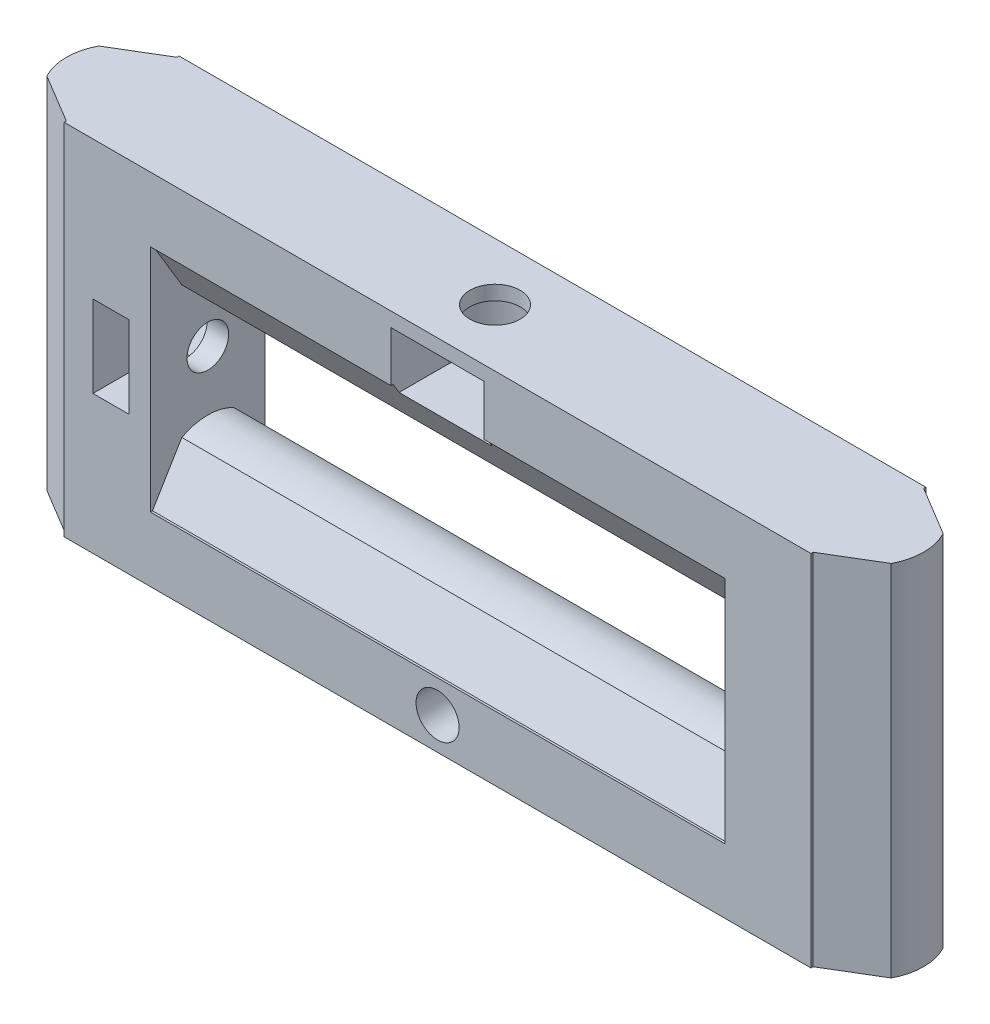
ISO-10303-21;
HEADER;
FILE_DESCRIPTION(('STEP AP214'),'2;1');
FILE_NAME('part.step','',(''),(''),'','','');
FILE_SCHEMA(('AUTOMOTIVE_DESIGN { 1 0 10303 214 1 1 1 1 }'));
ENDSEC;
DATA;
#1=APPLICATION_CONTEXT('core data for automotive mechanical design processes');
#2=APPLICATION_PROTOCOL_DEFINITION('international standard','automotive_design',2000,#1);
#3=PRODUCT_CONTEXT('',#1,'mechanical');
#4=PRODUCT('Part','Part','',(#3));
#5=PRODUCT_RELATED_PRODUCT_CATEGORY('part','',(#4));
#6=PRODUCT_DEFINITION_FORMATION('','',#4);
#7=PRODUCT_DEFINITION_CONTEXT('part definition',#1,'design');
#8=PRODUCT_DEFINITION('design','',#6,#7);
#9=PRODUCT_DEFINITION_SHAPE('','',#8);
#10=(LENGTH_UNIT() NAMED_UNIT(*) SI_UNIT(.MILLI.,.METRE.));
#11=(NAMED_UNIT(*) PLANE_ANGLE_UNIT() SI_UNIT($,.RADIAN.));
#12=(NAMED_UNIT(*) SI_UNIT($,.STERADIAN.) SOLID_ANGLE_UNIT());
#13=UNCERTAINTY_MEASURE_WITH_UNIT(LENGTH_MEASURE(1.E-05),#10,'distance_accuracy_value','');
#14=(GEOMETRIC_REPRESENTATION_CONTEXT(3) GLOBAL_UNCERTAINTY_ASSIGNED_CONTEXT((#13)) GLOBAL_UNIT_ASSIGNED_CONTEXT((#10,
#11,#12)) REPRESENTATION_CONTEXT('',''));
#15=CARTESIAN_POINT('',(0.,0.,0.));
#16=DIRECTION('',(0.,0.,1.));
#17=DIRECTION('',(1.,0.,0.));
#18=AXIS2_PLACEMENT_3D('',#15,#16,#17);
#19=CARTESIAN_POINT('',(-20.,20.5,0.));
#20=DIRECTION('',(0.,1.,0.));
#21=DIRECTION('',(0.,0.,1.));
#22=AXIS2_PLACEMENT_3D('',#19,#20,#21);
#23=PLANE('',#22);
#24=DIRECTION('',(0.,0.,-1.));
#25=VECTOR('',#24,1.);
#26=CARTESIAN_POINT('',(-3.25,20.5,0.));
#27=LINE('',#26,#25);
#28=CARTESIAN_POINT('',(-3.25,20.5,4.));
#29=VERTEX_POINT('',#28);
#30=CARTESIAN_POINT('',(-3.25,20.5,3.84999999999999));
#31=VERTEX_POINT('',#30);
#32=EDGE_CURVE('E855',#29,#31,#27,.T.);
#33=ORIENTED_EDGE('',*,*,#32,.F.);
#34=DIRECTION('',(1.,0.,0.));
#35=VECTOR('',#34,1.);
#36=CARTESIAN_POINT('',(0.,20.5,4.));
#37=LINE('',#36,#35);
#38=CARTESIAN_POINT('',(-20.,20.5,4.));
#39=VERTEX_POINT('',#38);
#40=EDGE_CURVE('E825',#39,#29,#37,.T.);
#41=ORIENTED_EDGE('',*,*,#40,.F.);
#42=DIRECTION('',(0.,0.,1.));
#43=VECTOR('',#42,1.);
#44=CARTESIAN_POINT('',(-20.,20.5,0.));
#45=LINE('',#44,#43);
#46=CARTESIAN_POINT('',(-20.,20.5,3.84999999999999));
#47=VERTEX_POINT('',#46);
#48=EDGE_CURVE('E857',#47,#39,#45,.T.);
#49=ORIENTED_EDGE('',*,*,#48,.F.);
#50=DIRECTION('',(1.,0.,0.));
#51=VECTOR('',#50,1.);
#52=CARTESIAN_POINT('',(-20.,20.5,3.84999999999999));
#53=LINE('',#52,#51);
#54=EDGE_CURVE('E852',#47,#31,#53,.T.);
#55=ORIENTED_EDGE('',*,*,#54,.T.);
#56=EDGE_LOOP('',(#33,#41,#49,#55));
#57=FACE_BOUND('',#56,.T.);
#58=ADVANCED_FACE('F42',(#57),#23,.F.);
#59=CARTESIAN_POINT('',(0.,0.,4.));
#60=DIRECTION('',(0.,0.,-1.));
#61=DIRECTION('',(-1.,0.,0.));
#62=AXIS2_PLACEMENT_3D('',#59,#60,#61);
#63=PLANE('',#62);
#64=CARTESIAN_POINT('',(0.,2.25,4.));
#65=DIRECTION('',(0.,0.,1.));
#66=DIRECTION('',(1.,0.,0.));
#67=AXIS2_PLACEMENT_3D('',#64,#65,#66);
#68=CIRCLE('',#67,1.5);
#69=CARTESIAN_POINT('',(1.5,2.25,4.));
#70=VERTEX_POINT('',#69);
#71=EDGE_CURVE('E1946',#70,#70,#68,.T.);
#72=ORIENTED_EDGE('',*,*,#71,.F.);
#73=EDGE_LOOP('',(#72));
#74=FACE_BOUND('',#73,.T.);
#75=DIRECTION('',(1.,0.,0.));
#76=VECTOR('',#75,1.);
#77=CARTESIAN_POINT('',(0.,24.,4.));
#78=LINE('',#77,#76);
#79=CARTESIAN_POINT('',(-3.25,24.,4.));
#80=VERTEX_POINT('',#79);
#81=CARTESIAN_POINT('',(3.25,24.,4.));
#82=VERTEX_POINT('',#81);
#83=EDGE_CURVE('E1924',#80,#82,#78,.T.);
#84=ORIENTED_EDGE('',*,*,#83,.T.);
#85=DIRECTION('',(0.,1.,0.));
#86=VECTOR('',#85,1.);
#87=CARTESIAN_POINT('',(3.25,19.8,4.));
#88=LINE('',#87,#86);
#89=CARTESIAN_POINT('',(3.25,20.5,4.));
#90=VERTEX_POINT('',#89);
#91=EDGE_CURVE('E1914',#90,#82,#88,.T.);
#92=ORIENTED_EDGE('',*,*,#91,.F.);
#93=CARTESIAN_POINT('',(20.,20.5,4.));
#94=VERTEX_POINT('',#93);
#95=EDGE_CURVE('E815',#90,#94,#37,.T.);
#96=ORIENTED_EDGE('',*,*,#95,.T.);
#97=DIRECTION('',(0.,-1.,0.));
#98=VECTOR('',#97,1.);
#99=CARTESIAN_POINT('',(20.,0.,4.));
#100=LINE('',#99,#98);
#101=CARTESIAN_POINT('',(20.,4.5,4.));
#102=VERTEX_POINT('',#101);
#103=EDGE_CURVE('E869',#94,#102,#100,.T.);
#104=ORIENTED_EDGE('',*,*,#103,.T.);
#105=DIRECTION('',(1.,0.,0.));
#106=VECTOR('',#105,1.);
#107=CARTESIAN_POINT('',(0.,4.5,4.));
#108=LINE('',#107,#106);
#109=CARTESIAN_POINT('',(-20.,4.5,4.));
#110=VERTEX_POINT('',#109);
#111=EDGE_CURVE('E831',#110,#102,#108,.T.);
#112=ORIENTED_EDGE('',*,*,#111,.F.);
#113=DIRECTION('',(0.,-1.,0.));
#114=VECTOR('',#113,1.);
#115=CARTESIAN_POINT('',(-20.,0.,4.));
#116=LINE('',#115,#114);
#117=EDGE_CURVE('E872',#39,#110,#116,.T.);
#118=ORIENTED_EDGE('',*,*,#117,.F.);
#119=ORIENTED_EDGE('',*,*,#40,.T.);
#120=DIRECTION('',(0.,1.,0.));
#121=VECTOR('',#120,1.);
#122=CARTESIAN_POINT('',(-3.25,19.8,4.));
#123=LINE('',#122,#121);
#124=EDGE_CURVE('E1910',#29,#80,#123,.T.);
#125=ORIENTED_EDGE('',*,*,#124,.T.);
#126=EDGE_LOOP('',(#84,#92,#96,#104,#112,#118,#119,#125));
#127=FACE_BOUND('',#126,.T.);
#128=DIRECTION('',(0.,-1.,0.));
#129=VECTOR('',#128,1.);
#130=CARTESIAN_POINT('',(-26.,25.,4.));
#131=LINE('',#130,#129);
#132=CARTESIAN_POINT('',(-26.,25.,4.));
#133=VERTEX_POINT('',#132);
#134=CARTESIAN_POINT('',(-26.,0.,4.));
#135=VERTEX_POINT('',#134);
#136=EDGE_CURVE('E877',#133,#135,#131,.T.);
#137=ORIENTED_EDGE('',*,*,#136,.T.);
#138=DIRECTION('',(1.,0.,0.));
#139=VECTOR('',#138,1.);
#140=CARTESIAN_POINT('',(26.,0.,4.));
#141=LINE('',#140,#139);
#142=CARTESIAN_POINT('',(26.,0.,4.));
#143=VERTEX_POINT('',#142);
#144=EDGE_CURVE('E881',#135,#143,#141,.T.);
#145=ORIENTED_EDGE('',*,*,#144,.T.);
#146=DIRECTION('',(0.,1.,0.));
#147=VECTOR('',#146,1.);
#148=CARTESIAN_POINT('',(26.,25.,4.));
#149=LINE('',#148,#147);
#150=CARTESIAN_POINT('',(26.,25.,4.));
#151=VERTEX_POINT('',#150);
#152=EDGE_CURVE('E885',#143,#151,#149,.T.);
#153=ORIENTED_EDGE('',*,*,#152,.T.);
#154=DIRECTION('',(-1.,0.,0.));
#155=VECTOR('',#154,1.);
#156=CARTESIAN_POINT('',(26.,25.,4.));
#157=LINE('',#156,#155);
#158=EDGE_CURVE('E888',#151,#133,#157,.T.);
#159=ORIENTED_EDGE('',*,*,#158,.T.);
#160=EDGE_LOOP('',(#137,#145,#153,#159));
#161=FACE_BOUND('',#160,.T.);
#162=DIRECTION('',(0.,1.,0.));
#163=VECTOR('',#162,1.);
#164=CARTESIAN_POINT('',(-21.5,0.,4.));
#165=LINE('',#164,#163);
#166=CARTESIAN_POINT('',(-21.5,9.65,4.));
#167=VERTEX_POINT('',#166);
#168=CARTESIAN_POINT('',(-21.5,15.35,4.));
#169=VERTEX_POINT('',#168);
#170=EDGE_CURVE('E1833',#167,#169,#165,.T.);
#171=ORIENTED_EDGE('',*,*,#170,.F.);
#172=DIRECTION('',(-1.,0.,0.));
#173=VECTOR('',#172,1.);
#174=CARTESIAN_POINT('',(-21.5,9.65,4.));
#175=LINE('',#174,#173);
#176=CARTESIAN_POINT('',(-24.,9.65,4.));
#177=VERTEX_POINT('',#176);
#178=EDGE_CURVE('E1835',#167,#177,#175,.T.);
#179=ORIENTED_EDGE('',*,*,#178,.T.);
#180=DIRECTION('',(0.,1.,0.));
#181=VECTOR('',#180,1.);
#182=CARTESIAN_POINT('',(-24.,0.,4.));
#183=LINE('',#182,#181);
#184=CARTESIAN_POINT('',(-24.,15.35,4.));
#185=VERTEX_POINT('',#184);
#186=EDGE_CURVE('E1868',#177,#185,#183,.T.);
#187=ORIENTED_EDGE('',*,*,#186,.T.);
#188=DIRECTION('',(-1.,0.,0.));
#189=VECTOR('',#188,1.);
#190=CARTESIAN_POINT('',(-21.5,15.35,4.));
#191=LINE('',#190,#189);
#192=EDGE_CURVE('E1837',#169,#185,#191,.T.);
#193=ORIENTED_EDGE('',*,*,#192,.F.);
#194=EDGE_LOOP('',(#171,#179,#187,#193));
#195=FACE_BOUND('',#194,.T.);
#196=ADVANCED_FACE('F789',(#74,#127,#161,#195),#63,.F.);
#197=CARTESIAN_POINT('',(-29.85,12.5,0.));
#198=DIRECTION('',(1.,0.,0.));
#199=DIRECTION('',(0.,0.,-1.));
#200=AXIS2_PLACEMENT_3D('',#197,#198,#199);
#201=CYLINDRICAL_SURFACE('',#200,1.45);
#202=CARTESIAN_POINT('',(-20.,12.5,0.));
#203=DIRECTION('',(1.,0.,0.));
#204=DIRECTION('',(0.,0.,-1.));
#205=AXIS2_PLACEMENT_3D('',#202,#203,#204);
#206=CIRCLE('',#205,1.45);
#207=CARTESIAN_POINT('',(-20.,12.5,-1.45));
#208=VERTEX_POINT('',#207);
#209=EDGE_CURVE('E760',#208,#208,#206,.T.);
#210=ORIENTED_EDGE('',*,*,#209,.T.);
#211=EDGE_LOOP('',(#210));
#212=FACE_BOUND('',#211,.T.);
#213=CARTESIAN_POINT('',(-21.5,12.5,0.));
#214=DIRECTION('',(-1.,0.,0.));
#215=DIRECTION('',(0.,0.,1.));
#216=AXIS2_PLACEMENT_3D('',#213,#214,#215);
#217=CIRCLE('',#216,1.45);
#218=CARTESIAN_POINT('',(-21.5,12.5,1.45));
#219=VERTEX_POINT('',#218);
#220=EDGE_CURVE('E1849',#219,#219,#217,.T.);
#221=ORIENTED_EDGE('',*,*,#220,.T.);
#222=EDGE_LOOP('',(#221));
#223=FACE_BOUND('',#222,.T.);
#224=ADVANCED_FACE('F746',(#212,#223),#201,.F.);
#225=CARTESIAN_POINT('',(0.,0.,-4.));
#226=DIRECTION('',(0.,0.,-1.));
#227=DIRECTION('',(-1.,0.,0.));
#228=AXIS2_PLACEMENT_3D('',#225,#226,#227);
#229=PLANE('',#228);
#230=CARTESIAN_POINT('',(-23.3516345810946,14.8681674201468,-4.));
#231=CARTESIAN_POINT('',(-23.3513323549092,14.8323777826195,-4.));
#232=CARTESIAN_POINT('',(-23.3593624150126,14.7787523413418,-4.));
#233=CARTESIAN_POINT('',(-23.3816299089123,14.7090575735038,-4.));
#234=CARTESIAN_POINT('',(-23.4065332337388,14.6572062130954,-4.));
#235=CARTESIAN_POINT('',(-23.4385529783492,14.6057368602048,-4.));
#236=CARTESIAN_POINT('',(-23.4918416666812,14.5350772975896,-4.));
#237=CARTESIAN_POINT('',(-23.5405638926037,14.4867491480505,-4.));
#238=CARTESIAN_POINT('',(-23.5752924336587,14.4552066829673,-4.));
#239=B_SPLINE_CURVE_WITH_KNOTS('',3,(#230,#231,#232,#233,#234,#235,#236,#237,#238),
.UNSPECIFIED.,.F.,.F.,(4,1,1,1,1,1,4),(0.,0.221094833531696,0.333771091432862,0.45233507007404,
0.576541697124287,0.708924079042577,1.),.UNSPECIFIED.);
#240=CARTESIAN_POINT('',(-23.3516345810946,14.8681674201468,-4.));
#241=VERTEX_POINT('',#240);
#242=CARTESIAN_POINT('',(-23.5752924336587,14.4552066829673,-4.));
#243=VERTEX_POINT('',#242);
#244=EDGE_CURVE('E503',#241,#243,#239,.T.);
#245=ORIENTED_EDGE('',*,*,#244,.T.);
#246=DIRECTION('',(0.223632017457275,-0.974673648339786,0.));
#247=VECTOR('',#246,1.);
#248=CARTESIAN_POINT('',(-19.2454860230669,-4.41574148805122,-4.));
#249=LINE('',#248,#247);
#250=CARTESIAN_POINT('',(-23.4539983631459,13.926560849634,-4.));
#251=VERTEX_POINT('',#250);
#252=EDGE_CURVE('E520',#243,#251,#249,.T.);
#253=ORIENTED_EDGE('',*,*,#252,.T.);
#254=DIRECTION('',(0.978275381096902,0.207309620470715,0.));
#255=VECTOR('',#254,1.);
#256=CARTESIAN_POINT('',(-3.83237770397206,18.0846443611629,-4.));
#257=LINE('',#256,#255);
#258=CARTESIAN_POINT('',(-21.511890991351,14.3381193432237,-4.));
#259=VERTEX_POINT('',#258);
#260=EDGE_CURVE('E2464',#251,#259,#257,.T.);
#261=ORIENTED_EDGE('',*,*,#260,.T.);
#262=DIRECTION('',(0.,1.,0.));
#263=VECTOR('',#262,1.);
#264=CARTESIAN_POINT('',(-21.511890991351,0.,-4.));
#265=LINE('',#264,#263);
#266=CARTESIAN_POINT('',(-21.511890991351,15.9317691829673,-4.));
#267=VERTEX_POINT('',#266);
#268=EDGE_CURVE('E2461',#259,#267,#265,.T.);
#269=ORIENTED_EDGE('',*,*,#268,.T.);
#270=DIRECTION('',(-1.,0.,0.));
#271=VECTOR('',#270,1.);
#272=CARTESIAN_POINT('',(0.,15.9317691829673,-4.));
#273=LINE('',#272,#271);
#274=CARTESIAN_POINT('',(-22.0952243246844,15.9317691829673,-4.));
#275=VERTEX_POINT('',#274);
#276=EDGE_CURVE('E2458',#267,#275,#273,.T.);
#277=ORIENTED_EDGE('',*,*,#276,.T.);
#278=DIRECTION('',(0.,-1.,0.));
#279=VECTOR('',#278,1.);
#280=CARTESIAN_POINT('',(-22.0952243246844,0.,-4.));
#281=LINE('',#280,#279);
#282=CARTESIAN_POINT('',(-22.0952243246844,14.8359158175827,-4.));
#283=VERTEX_POINT('',#282);
#284=EDGE_CURVE('E2455',#275,#283,#281,.T.);
#285=ORIENTED_EDGE('',*,*,#284,.T.);
#286=DIRECTION('',(-0.97932424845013,-0.202296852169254,0.));
#287=VECTOR('',#286,1.);
#288=CARTESIAN_POINT('',(-3.84343110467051,18.6061485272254,-4.));
#289=LINE('',#288,#287);
#290=CARTESIAN_POINT('',(-22.7570832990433,14.6991970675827,-4.));
#291=VERTEX_POINT('',#290);
#292=EDGE_CURVE('E2449',#283,#291,#289,.T.);
#293=ORIENTED_EDGE('',*,*,#292,.T.);
#294=CARTESIAN_POINT('',(-22.7570832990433,14.6991970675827,-4.));
#295=CARTESIAN_POINT('',(-22.7461619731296,14.7357257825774,-4.));
#296=CARTESIAN_POINT('',(-22.7297540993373,14.8073810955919,-4.));
#297=CARTESIAN_POINT('',(-22.7234967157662,14.8806302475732,-4.));
#298=CARTESIAN_POINT('',(-22.7234294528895,14.9158437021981,-4.));
#299=B_SPLINE_CURVE_WITH_KNOTS('',3,(#294,#295,#296,#297,#298),.UNSPECIFIED.,.F.,.F.,(4,1,4),
(0.,0.519980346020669,1.),.UNSPECIFIED.);
#300=CARTESIAN_POINT('',(-22.7234294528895,14.9158437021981,-4.));
#301=VERTEX_POINT('',#300);
#302=EDGE_CURVE('E2441',#291,#301,#299,.T.);
#303=ORIENTED_EDGE('',*,*,#302,.T.);
#304=CARTESIAN_POINT('',(-22.7234294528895,14.9158437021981,-4.));
#305=CARTESIAN_POINT('',(-22.7230498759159,14.9891842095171,-4.));
#306=CARTESIAN_POINT('',(-22.7328990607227,15.0975572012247,-4.));
#307=CARTESIAN_POINT('',(-22.7670874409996,15.2365046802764,-4.));
#308=CARTESIAN_POINT('',(-22.8028942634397,15.3343991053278,-4.));
#309=CARTESIAN_POINT('',(-22.8495601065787,15.4273292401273,-4.));
#310=CARTESIAN_POINT('',(-22.9059970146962,15.5154070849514,-4.));
#311=CARTESIAN_POINT('',(-22.9723212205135,15.5987409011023,-4.));
#312=CARTESIAN_POINT('',(-23.0485696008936,15.6758503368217,-4.));
#313=CARTESIAN_POINT('',(-23.1322923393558,15.7467015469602,-4.));
#314=CARTESIAN_POINT('',(-23.2228472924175,15.8083032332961,-4.));
#315=CARTESIAN_POINT('',(-23.3189431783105,15.8609126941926,-4.));
#316=CARTESIAN_POINT('',(-23.4211778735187,15.9027647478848,-4.));
#317=CARTESIAN_POINT('',(-23.5289070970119,15.9357660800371,-4.));
#318=CARTESIAN_POINT('',(-23.6827713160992,15.9683170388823,-4.));
#319=CARTESIAN_POINT('',(-23.8026778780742,15.9761578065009,-4.));
#320=CARTESIAN_POINT('',(-23.8837860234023,15.9766409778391,-4.));
#321=B_SPLINE_CURVE_WITH_KNOTS('',3,(#304,#305,#306,#307,#308,#309,#310,#311,#312,#313,#314,
#315,#316,#317,#318,#319,#320),.UNSPECIFIED.,.F.,.F.,(4,1,1,1,1,1,1,1,1,1,1,1,1,1,4),(0.,
0.124976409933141,0.184492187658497,0.243473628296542,0.302263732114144,0.361383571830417,
0.421481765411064,0.483454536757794,0.545936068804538,0.608142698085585,0.66982029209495,
0.732332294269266,0.796092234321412,0.861642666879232,1.),.UNSPECIFIED.);
#322=CARTESIAN_POINT('',(-23.8837860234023,15.9766409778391,-4.));
#323=VERTEX_POINT('',#322);
#324=EDGE_CURVE('E2433',#301,#323,#321,.T.);
#325=ORIENTED_EDGE('',*,*,#324,.T.);
#326=CARTESIAN_POINT('',(-23.8837860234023,15.9766409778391,-4.));
#327=CARTESIAN_POINT('',(-23.966290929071,15.9756085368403,-4.));
#328=CARTESIAN_POINT('',(-24.0889368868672,15.9674461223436,-4.));
#329=CARTESIAN_POINT('',(-24.246134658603,15.9308328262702,-4.));
#330=CARTESIAN_POINT('',(-24.3575689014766,15.8940880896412,-4.));
#331=CARTESIAN_POINT('',(-24.4631427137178,15.8446652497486,-4.));
#332=CARTESIAN_POINT('',(-24.5648089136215,15.7869126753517,-4.));
#333=CARTESIAN_POINT('',(-24.6603847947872,15.7166307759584,-4.));
#334=CARTESIAN_POINT('',(-24.7501550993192,15.6372205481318,-4.));
#335=CARTESIAN_POINT('',(-24.8322605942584,15.5505400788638,-4.));
#336=CARTESIAN_POINT('',(-24.9043021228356,15.458018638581,-4.));
#337=CARTESIAN_POINT('',(-24.9659935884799,15.3612091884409,-4.));
#338=CARTESIAN_POINT('',(-25.0149324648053,15.2587410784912,-4.));
#339=CARTESIAN_POINT('',(-25.0538095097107,15.1521850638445,-4.));
#340=CARTESIAN_POINT('',(-25.0921191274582,15.0023126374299,-4.));
#341=CARTESIAN_POINT('',(-25.1010037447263,14.8850752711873,-4.));
#342=CARTESIAN_POINT('',(-25.1016345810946,14.8064687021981,-4.));
#343=B_SPLINE_CURVE_WITH_KNOTS('',3,(#326,#327,#328,#329,#330,#331,#332,#333,#334,#335,#336,
#337,#338,#339,#340,#341,#342),.UNSPECIFIED.,.F.,.F.,(4,1,1,1,1,1,1,1,1,1,1,1,1,1,4),(0.,
0.131743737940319,0.194833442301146,0.256929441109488,0.318450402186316,0.380380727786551,
0.443059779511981,0.507205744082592,0.571256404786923,0.633119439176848,0.693904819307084,
0.753899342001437,0.813779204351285,0.874508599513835,1.),.UNSPECIFIED.);
#344=CARTESIAN_POINT('',(-25.0118909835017,15.2613150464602,-4.));
#345=VERTEX_POINT('',#344);
#346=EDGE_CURVE('E2428',#323,#345,#343,.T.);
#347=ORIENTED_EDGE('',*,*,#346,.T.);
#348=DIRECTION('',(0.,1.,0.));
#349=VECTOR('',#348,1.);
#350=CARTESIAN_POINT('',(-25.011890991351,0.,-4.));
#351=LINE('',#350,#349);
#352=CARTESIAN_POINT('',(-25.011890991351,14.3293837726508,-4.));
#353=VERTEX_POINT('',#352);
#354=EDGE_CURVE('E2421',#353,#345,#351,.T.);
#355=ORIENTED_EDGE('',*,*,#354,.F.);
#356=CARTESIAN_POINT('',(-25.1016345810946,14.8064687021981,-4.));
#357=CARTESIAN_POINT('',(-25.1003025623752,14.7360632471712,-4.));
#358=CARTESIAN_POINT('',(-25.0956426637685,14.6310946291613,-4.));
#359=CARTESIAN_POINT('',(-25.0669826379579,14.4962031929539,-4.));
#360=CARTESIAN_POINT('',(-25.0404087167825,14.3996471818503,-4.));
#361=CARTESIAN_POINT('',(-25.0037612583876,14.3076980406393,-4.));
#362=CARTESIAN_POINT('',(-24.9616510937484,14.2184657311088,-4.));
#363=CARTESIAN_POINT('',(-24.9087814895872,14.1346352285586,-4.));
#364=CARTESIAN_POINT('',(-24.8505381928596,14.0538252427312,-4.));
#365=CARTESIAN_POINT('',(-24.7843917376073,13.979142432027,-4.));
#366=CARTESIAN_POINT('',(-24.7129142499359,13.9098011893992,-4.));
#367=CARTESIAN_POINT('',(-24.6347693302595,13.8484412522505,-4.));
#368=CARTESIAN_POINT('',(-24.5514768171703,13.7927687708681,-4.));
#369=CARTESIAN_POINT('',(-24.4614776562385,13.7458378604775,-4.));
#370=CARTESIAN_POINT('',(-24.3327786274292,13.6889262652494,-4.));
#371=CARTESIAN_POINT('',(-24.2296254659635,13.6597429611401,-4.));
#372=CARTESIAN_POINT('',(-24.1593268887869,13.6433076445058,-4.));
#373=B_SPLINE_CURVE_WITH_KNOTS('',3,(#356,#357,#358,#359,#360,#361,#362,#363,#364,#365,#366,
#367,#368,#369,#370,#371,#372),.UNSPECIFIED.,.F.,.F.,(4,1,1,1,1,1,1,1,1,1,1,1,1,1,4),(0.,
0.130060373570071,0.192481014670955,0.253830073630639,0.314375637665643,0.374667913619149,
0.435387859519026,0.496723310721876,0.55806481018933,0.618986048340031,0.679994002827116,
0.740915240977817,0.803340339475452,0.866794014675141,1.),.UNSPECIFIED.);
#374=CARTESIAN_POINT('',(-24.1593268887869,13.6433076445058,-4.));
#375=VERTEX_POINT('',#374);
#376=EDGE_CURVE('E2416',#353,#375,#373,.T.);
#377=ORIENTED_EDGE('',*,*,#376,.T.);
#378=DIRECTION('',(0.,1.,0.));
#379=VECTOR('',#378,1.);
#380=CARTESIAN_POINT('',(-24.1593268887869,0.,-4.));
#381=LINE('',#380,#379);
#382=CARTESIAN_POINT('',(-24.1593268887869,14.3612563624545,-4.));
#383=VERTEX_POINT('',#382);
#384=EDGE_CURVE('E2410',#375,#383,#381,.T.);
#385=ORIENTED_EDGE('',*,*,#384,.T.);
#386=CARTESIAN_POINT('',(-24.1593268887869,14.3612563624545,-4.));
#387=CARTESIAN_POINT('',(-24.2081682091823,14.3849966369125,-4.));
#388=CARTESIAN_POINT('',(-24.2759057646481,14.428585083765,-4.));
#389=CARTESIAN_POINT('',(-24.3503183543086,14.5024782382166,-4.));
#390=CARTESIAN_POINT('',(-24.3947946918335,14.5627644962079,-4.));
#391=CARTESIAN_POINT('',(-24.4299813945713,14.6273981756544,-4.));
#392=CARTESIAN_POINT('',(-24.4644645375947,14.7193549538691,-4.));
#393=CARTESIAN_POINT('',(-24.4732191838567,14.7931402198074,-4.));
#394=CARTESIAN_POINT('',(-24.4734294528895,14.8422259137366,-4.));
#395=B_SPLINE_CURVE_WITH_KNOTS('',3,(#386,#387,#388,#389,#390,#391,#392,#393,#394),
.UNSPECIFIED.,.F.,.F.,(4,1,1,1,1,1,4),(0.,0.268447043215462,0.394247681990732,0.516475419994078,
0.637440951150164,0.756969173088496,1.),.UNSPECIFIED.);
#396=CARTESIAN_POINT('',(-24.4734294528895,14.8422259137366,-4.));
#397=VERTEX_POINT('',#396);
#398=EDGE_CURVE('E2402',#383,#397,#395,.T.);
#399=ORIENTED_EDGE('',*,*,#398,.T.);
#400=CARTESIAN_POINT('',(-24.4734294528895,14.8422259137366,-4.));
#401=CARTESIAN_POINT('',(-24.4725363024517,14.8762010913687,-4.));
#402=CARTESIAN_POINT('',(-24.4692451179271,14.9270078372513,-4.));
#403=CARTESIAN_POINT('',(-24.4518696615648,14.99169133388,-4.));
#404=CARTESIAN_POINT('',(-24.4340955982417,15.0376686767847,-4.));
#405=CARTESIAN_POINT('',(-24.4119177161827,15.0818466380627,-4.));
#406=CARTESIAN_POINT('',(-24.3839227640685,15.1235891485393,-4.));
#407=CARTESIAN_POINT('',(-24.3516987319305,15.1636231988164,-4.));
#408=CARTESIAN_POINT('',(-24.3147217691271,15.2013391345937,-4.));
#409=CARTESIAN_POINT('',(-24.2735009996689,15.2354988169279,-4.));
#410=CARTESIAN_POINT('',(-24.2292064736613,15.2654534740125,-4.));
#411=CARTESIAN_POINT('',(-24.1828224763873,15.2922357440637,-4.));
#412=CARTESIAN_POINT('',(-24.1325113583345,15.312078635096,-4.));
#413=CARTESIAN_POINT('',(-24.0797764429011,15.3283092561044,-4.));
#414=CARTESIAN_POINT('',(-24.004300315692,15.3446456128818,-4.));
#415=CARTESIAN_POINT('',(-23.945385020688,15.3486198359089,-4.));
#416=CARTESIAN_POINT('',(-23.9055207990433,15.348435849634,-4.));
#417=B_SPLINE_CURVE_WITH_KNOTS('',3,(#400,#401,#402,#403,#404,#405,#406,#407,#408,#409,#410,
#411,#412,#413,#414,#415,#416),.UNSPECIFIED.,.F.,.F.,(4,1,1,1,1,1,1,1,1,1,1,1,1,1,4),(0.,
0.120371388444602,0.178441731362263,0.235934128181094,0.294267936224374,0.352654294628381,
0.413122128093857,0.475585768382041,0.538900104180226,0.601869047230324,0.66433268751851,
0.727647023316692,0.79240873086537,0.859119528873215,1.),.UNSPECIFIED.);
#418=CARTESIAN_POINT('',(-23.9055207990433,15.348435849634,-4.));
#419=VERTEX_POINT('',#418);
#420=EDGE_CURVE('E64',#397,#419,#417,.T.);
#421=ORIENTED_EDGE('',*,*,#420,.T.);
#422=CARTESIAN_POINT('',(-23.9055207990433,15.348435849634,-4.));
#423=CARTESIAN_POINT('',(-23.8668774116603,15.3482487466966,-4.));
#424=CARTESIAN_POINT('',(-23.8096050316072,15.3450980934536,-4.));
#425=CARTESIAN_POINT('',(-23.7362050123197,15.3296740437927,-4.));
#426=CARTESIAN_POINT('',(-23.6847871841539,15.3143039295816,-4.));
#427=CARTESIAN_POINT('',(-23.6361754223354,15.2946120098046,-4.));
#428=CARTESIAN_POINT('',(-23.5900828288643,15.2705509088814,-4.));
#429=CARTESIAN_POINT('',(-23.5467387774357,15.2420150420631,-4.));
#430=CARTESIAN_POINT('',(-23.5070376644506,15.208846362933,-4.));
#431=CARTESIAN_POINT('',(-23.4705891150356,15.173493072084,-4.));
#432=CARTESIAN_POINT('',(-23.4388304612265,15.1354494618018,-4.));
#433=CARTESIAN_POINT('',(-23.4121121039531,15.0954329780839,-4.));
#434=CARTESIAN_POINT('',(-23.3902719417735,15.0535184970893,-4.));
#435=CARTESIAN_POINT('',(-23.3722148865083,15.0100870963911,-4.));
#436=CARTESIAN_POINT('',(-23.3569129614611,14.9482388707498,-4.));
#437=CARTESIAN_POINT('',(-23.3505529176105,14.9005574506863,-4.));
#438=CARTESIAN_POINT('',(-23.3516345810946,14.8681674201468,-4.));
#439=B_SPLINE_CURVE_WITH_KNOTS('',3,(#422,#423,#424,#425,#426,#427,#428,#429,#430,#431,#432,
#433,#434,#435,#436,#437,#438),.UNSPECIFIED.,.F.,.F.,(4,1,1,1,1,1,1,1,1,1,1,1,1,1,4),(0.,
0.141895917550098,0.209300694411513,0.274646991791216,0.338469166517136,0.401340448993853,
0.465047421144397,0.528366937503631,0.590792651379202,0.651038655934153,0.709753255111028,
0.766876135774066,0.824172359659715,0.881756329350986,1.),.UNSPECIFIED.);
#440=EDGE_CURVE('E59',#419,#241,#439,.T.);
#441=ORIENTED_EDGE('',*,*,#440,.T.);
#442=EDGE_LOOP('',(#245,#253,#261,#269,#277,#285,#293,#303,#325,#347,#355,#377,#385,#399,#421,#441));
#443=FACE_BOUND('',#442,.T.);
#444=CARTESIAN_POINT('',(-24.6739502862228,9.73946149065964,-4.));
#445=CARTESIAN_POINT('',(-24.6238147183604,9.73881975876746,-4.));
#446=CARTESIAN_POINT('',(-24.549395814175,9.75328921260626,-4.));
#447=CARTESIAN_POINT('',(-24.4604570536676,9.80008925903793,-4.));
#448=CARTESIAN_POINT('',(-24.4032020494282,9.84951421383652,-4.));
#449=CARTESIAN_POINT('',(-24.3548034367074,9.90750478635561,-4.));
#450=CARTESIAN_POINT('',(-24.3075702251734,9.99618985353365,-4.));
#451=CARTESIAN_POINT('',(-24.2936713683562,10.0708571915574,-4.));
#452=CARTESIAN_POINT('',(-24.2939422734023,10.1208717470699,-4.));
#453=B_SPLINE_CURVE_WITH_KNOTS('',3,(#444,#445,#446,#447,#448,#449,#450,#451,#452),
.UNSPECIFIED.,.F.,.F.,(4,1,1,1,1,1,4),(0.,0.250587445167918,0.372723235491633,0.499946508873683,
0.627320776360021,0.749456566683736,1.),.UNSPECIFIED.);
#454=CARTESIAN_POINT('',(-24.6739502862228,9.73946149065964,-4.));
#455=VERTEX_POINT('',#454);
#456=CARTESIAN_POINT('',(-24.2939422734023,10.1208717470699,-4.));
#457=VERTEX_POINT('',#456);
#458=EDGE_CURVE('E507',#455,#457,#453,.T.);
#459=ORIENTED_EDGE('',*,*,#458,.T.);
#460=CARTESIAN_POINT('',(-24.2939422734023,10.1208717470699,-4.));
#461=CARTESIAN_POINT('',(-24.2938308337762,10.1707985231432,-4.));
#462=CARTESIAN_POINT('',(-24.3072248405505,10.2455156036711,-4.));
#463=CARTESIAN_POINT('',(-24.3550417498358,10.3336307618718,-4.));
#464=CARTESIAN_POINT('',(-24.4031442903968,10.391599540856,-4.));
#465=CARTESIAN_POINT('',(-24.4606619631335,10.4408121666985,-4.));
#466=CARTESIAN_POINT('',(-24.5490168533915,10.4889225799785,-4.));
#467=CARTESIAN_POINT('',(-24.6239550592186,10.5026673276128,-4.));
#468=CARTESIAN_POINT('',(-24.6739502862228,10.5022820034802,-4.));
#469=B_SPLINE_CURVE_WITH_KNOTS('',3,(#460,#461,#462,#463,#464,#465,#466,#467,#468),
.UNSPECIFIED.,.F.,.F.,(4,1,1,1,1,1,4),(0.,0.250663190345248,0.371823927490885,0.499259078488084,
0.62654316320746,0.749292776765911,1.),.UNSPECIFIED.);
#470=CARTESIAN_POINT('',(-24.6739502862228,10.5022820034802,-4.));
#471=VERTEX_POINT('',#470);
#472=EDGE_CURVE('E602',#457,#471,#469,.T.);
#473=ORIENTED_EDGE('',*,*,#472,.T.);
#474=CARTESIAN_POINT('',(-24.6739502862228,10.5022820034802,-4.));
#475=CARTESIAN_POINT('',(-24.7240830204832,10.5024192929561,-4.));
#476=CARTESIAN_POINT('',(-24.7994600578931,10.4891646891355,-4.));
#477=CARTESIAN_POINT('',(-24.8880129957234,10.440609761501,-4.));
#478=CARTESIAN_POINT('',(-24.9461564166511,10.3916630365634,-4.));
#479=CARTESIAN_POINT('',(-24.9948619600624,10.3336433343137,-4.));
#480=CARTESIAN_POINT('',(-25.0438713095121,10.2458384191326,-4.));
#481=CARTESIAN_POINT('',(-25.0566609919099,10.170689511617,-4.));
#482=CARTESIAN_POINT('',(-25.0567627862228,10.1208717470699,-4.));
#483=B_SPLINE_CURVE_WITH_KNOTS('',3,(#474,#475,#476,#477,#478,#479,#480,#481,#482),
.UNSPECIFIED.,.F.,.F.,(4,1,1,1,1,1,4),(0.,0.250994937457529,0.373337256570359,0.501094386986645,
0.628851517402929,0.750168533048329,1.),.UNSPECIFIED.);
#484=CARTESIAN_POINT('',(-25.0118909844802,10.3018725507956,-4.));
#485=VERTEX_POINT('',#484);
#486=EDGE_CURVE('E597',#471,#485,#483,.T.);
#487=ORIENTED_EDGE('',*,*,#486,.T.);
#488=DIRECTION('',(0.,1.,0.));
#489=VECTOR('',#488,1.);
#490=CARTESIAN_POINT('',(-25.011890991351,0.,-4.));
#491=LINE('',#490,#489);
#492=CARTESIAN_POINT('',(-25.011890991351,9.93944151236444,-4.));
#493=VERTEX_POINT('',#492);
#494=EDGE_CURVE('E590',#493,#485,#491,.T.);
#495=ORIENTED_EDGE('',*,*,#494,.F.);
#496=CARTESIAN_POINT('',(-25.0567627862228,10.1208717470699,-4.));
#497=CARTESIAN_POINT('',(-25.0568216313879,10.070964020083,-4.));
#498=CARTESIAN_POINT('',(-25.0435248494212,9.99587171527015,-4.));
#499=CARTESIAN_POINT('',(-24.9951022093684,9.90748862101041,-4.));
#500=CARTESIAN_POINT('',(-24.946097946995,9.84945171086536,-4.));
#501=CARTESIAN_POINT('',(-24.8882191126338,9.8002896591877,-4.));
#502=CARTESIAN_POINT('',(-24.7990801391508,9.75304894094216,-4.));
#503=CARTESIAN_POINT('',(-24.724223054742,9.7390684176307,-4.));
#504=CARTESIAN_POINT('',(-24.6739502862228,9.73946149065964,-4.));
#505=B_SPLINE_CURVE_WITH_KNOTS('',3,(#496,#497,#498,#499,#500,#501,#502,#503,#504),
.UNSPECIFIED.,.F.,.F.,(4,1,1,1,1,1,4),(0.,0.249713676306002,0.371998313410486,0.499695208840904,
0.627392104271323,0.749123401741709,1.),.UNSPECIFIED.);
#506=EDGE_CURVE('E582',#493,#455,#505,.T.);
#507=ORIENTED_EDGE('',*,*,#506,.T.);
#508=EDGE_LOOP('',(#459,#473,#487,#495,#507));
#509=FACE_BOUND('',#508,.T.);
#510=CARTESIAN_POINT('',(-21.8982091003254,7.15512655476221,-4.));
#511=CARTESIAN_POINT('',(-21.8227274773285,7.20597373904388,-4.));
#512=CARTESIAN_POINT('',(-21.7188922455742,7.29228627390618,-4.));
#513=CARTESIAN_POINT('',(-21.606064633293,7.42819443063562,-4.));
#514=CARTESIAN_POINT('',(-21.5388635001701,7.53692871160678,-4.));
#515=CARTESIAN_POINT('',(-21.4859457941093,7.65295236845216,-4.));
#516=CARTESIAN_POINT('',(-21.4349292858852,7.82172099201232,-4.));
#517=CARTESIAN_POINT('',(-21.4230617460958,7.95576792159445,-4.));
#518=CARTESIAN_POINT('',(-21.4221474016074,8.04625235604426,-4.));
#519=B_SPLINE_CURVE_WITH_KNOTS('',3,(#510,#511,#512,#513,#514,#515,#516,#517,#518),
.UNSPECIFIED.,.F.,.F.,(4,1,1,1,1,1,4),(0.,0.258700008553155,0.380911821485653,0.500534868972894,
0.620922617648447,0.742375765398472,1.),.UNSPECIFIED.);
#520=CARTESIAN_POINT('',(-21.8982091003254,7.15512655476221,-4.));
#521=VERTEX_POINT('',#520);
#522=CARTESIAN_POINT('',(-21.4221474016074,8.04625235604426,-4.));
#523=VERTEX_POINT('',#522);
#524=EDGE_CURVE('E2096',#521,#523,#519,.T.);
#525=ORIENTED_EDGE('',*,*,#524,.T.);
#526=CARTESIAN_POINT('',(-21.4221474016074,8.04625235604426,-4.));
#527=CARTESIAN_POINT('',(-21.4216725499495,8.10604669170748,-4.));
#528=CARTESIAN_POINT('',(-21.427854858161,8.19453253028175,-4.));
#529=CARTESIAN_POINT('',(-21.4476397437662,8.3093359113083,-4.));
#530=CARTESIAN_POINT('',(-21.4678859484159,8.3912502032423,-4.));
#531=CARTESIAN_POINT('',(-21.4946352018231,8.46971454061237,-4.));
#532=CARTESIAN_POINT('',(-21.5269110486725,8.54500355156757,-4.));
#533=CARTESIAN_POINT('',(-21.5650290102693,8.61704927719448,-4.));
#534=CARTESIAN_POINT('',(-21.6091614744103,8.68592803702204,-4.));
#535=CARTESIAN_POINT('',(-21.6599906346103,8.75102460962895,-4.));
#536=CARTESIAN_POINT('',(-21.7160328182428,8.81339151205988,-4.));
#537=CARTESIAN_POINT('',(-21.7794539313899,8.87052809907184,-4.));
#538=CARTESIAN_POINT('',(-21.8486126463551,8.92416087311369,-4.));
#539=CARTESIAN_POINT('',(-21.9239224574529,8.97392354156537,-4.));
#540=CARTESIAN_POINT('',(-22.0051640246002,9.02013747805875,-4.));
#541=CARTESIAN_POINT('',(-22.0928387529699,9.06234199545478,-4.));
#542=CARTESIAN_POINT('',(-22.1870754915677,9.10104049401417,-4.));
#543=CARTESIAN_POINT('',(-22.2892951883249,9.13564296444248,-4.));
#544=CARTESIAN_POINT('',(-22.4006679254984,9.16478939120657,-4.));
#545=CARTESIAN_POINT('',(-22.5212198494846,9.18978587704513,-4.));
#546=CARTESIAN_POINT('',(-22.651250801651,9.21089008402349,-4.));
#547=CARTESIAN_POINT('',(-22.7909337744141,9.22681971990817,-4.));
#548=CARTESIAN_POINT('',(-22.9958997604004,9.24168601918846,-4.));
#549=CARTESIAN_POINT('',(-23.154550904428,9.24636003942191,-4.));
#550=CARTESIAN_POINT('',(-23.2632932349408,9.2458717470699,-4.));
#551=B_SPLINE_CURVE_WITH_KNOTS('',3,(#526,#527,#528,#529,#530,#531,#532,#533,#534,#535,#536,
#537,#538,#539,#540,#541,#542,#543,#544,#545,#546,#547,#548,#549,#550),.UNSPECIFIED.,.F.,.F.,(4,
1,1,1,1,1,1,1,1,1,1,1,1,1,1,1,1,1,1,1,1,1,4),(0.,0.0720299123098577,0.106619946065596,
0.140297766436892,0.173609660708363,0.206414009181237,0.238920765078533,0.271734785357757,
0.304861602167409,0.338358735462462,0.372651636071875,0.407581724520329,0.443750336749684,
0.481340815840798,0.52014011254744,0.560937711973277,0.60404697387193,0.650094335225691,
0.699589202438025,0.75237653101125,0.808799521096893,0.868961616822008,1.),.UNSPECIFIED.);
#552=CARTESIAN_POINT('',(-23.2632932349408,9.2458717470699,-4.));
#553=VERTEX_POINT('',#552);
#554=EDGE_CURVE('E642',#523,#553,#551,.T.);
#555=ORIENTED_EDGE('',*,*,#554,.T.);
#556=CARTESIAN_POINT('',(-23.2632932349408,9.2458717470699,-4.));
#557=CARTESIAN_POINT('',(-23.373170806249,9.24595361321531,-4.));
#558=CARTESIAN_POINT('',(-23.5333340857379,9.24247117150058,-4.));
#559=CARTESIAN_POINT('',(-23.7400487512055,9.22582832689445,-4.));
#560=CARTESIAN_POINT('',(-23.8807232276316,9.21031831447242,-4.));
#561=CARTESIAN_POINT('',(-24.0116598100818,9.18901192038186,-4.));
#562=CARTESIAN_POINT('',(-24.133023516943,9.1642451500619,-4.));
#563=CARTESIAN_POINT('',(-24.2448374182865,9.13437336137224,-4.));
#564=CARTESIAN_POINT('',(-24.3471106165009,9.0988306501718,-4.));
#565=CARTESIAN_POINT('',(-24.4416034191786,9.06007258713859,-4.));
#566=CARTESIAN_POINT('',(-24.5294549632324,9.01842418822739,-4.));
#567=CARTESIAN_POINT('',(-24.6100134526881,8.97207930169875,-4.));
#568=CARTESIAN_POINT('',(-24.6858302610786,8.92526167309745,-4.));
#569=CARTESIAN_POINT('',(-24.7535908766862,8.87274728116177,-4.));
#570=CARTESIAN_POINT('',(-24.8159614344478,8.81842470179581,-4.));
#571=CARTESIAN_POINT('',(-24.8705549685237,8.75953318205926,-4.));
#572=CARTESIAN_POINT('',(-24.9202282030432,8.69862129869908,-4.));
#573=CARTESIAN_POINT('',(-24.9631537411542,8.63343963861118,-4.));
#574=CARTESIAN_POINT('',(-25.0006965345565,8.564665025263,-4.));
#575=CARTESIAN_POINT('',(-25.031146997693,8.49107022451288,-4.));
#576=CARTESIAN_POINT('',(-25.0576353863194,8.41399652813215,-4.));
#577=CARTESIAN_POINT('',(-25.0766354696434,8.33213227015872,-4.));
#578=CARTESIAN_POINT('',(-25.0972489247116,8.21589872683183,-4.));
#579=CARTESIAN_POINT('',(-25.1013239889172,8.12555467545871,-4.));
#580=CARTESIAN_POINT('',(-25.1016345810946,8.06448152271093,-4.));
#581=B_SPLINE_CURVE_WITH_KNOTS('',3,(#556,#557,#558,#559,#560,#561,#562,#563,#564,#565,#566,
#567,#568,#569,#570,#571,#572,#573,#574,#575,#576,#577,#578,#579,#580),.UNSPECIFIED.,.F.,.F.,(4,
1,1,1,1,1,1,1,1,1,1,1,1,1,1,1,1,1,1,1,1,1,4),(0.,0.133080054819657,0.193834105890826,
0.251089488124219,0.304408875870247,0.354417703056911,0.401032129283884,0.444439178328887,
0.485432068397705,0.524672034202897,0.562056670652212,0.597935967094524,0.632463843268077,
0.665743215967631,0.697977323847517,0.729579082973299,0.76081888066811,0.792349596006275,
0.824307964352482,0.857152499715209,0.890924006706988,0.925958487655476,1.),.UNSPECIFIED.);
#582=CARTESIAN_POINT('',(-25.0118909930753,8.53662336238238,-4.));
#583=VERTEX_POINT('',#582);
#584=EDGE_CURVE('E2068',#553,#583,#581,.T.);
#585=ORIENTED_EDGE('',*,*,#584,.T.);
#586=DIRECTION('',(0.,1.,0.));
#587=VECTOR('',#586,1.);
#588=CARTESIAN_POINT('',(-25.011890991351,0.,-4.));
#589=LINE('',#588,#587);
#590=CARTESIAN_POINT('',(-25.011890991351,7.58913788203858,-4.));
#591=VERTEX_POINT('',#590);
#592=EDGE_CURVE('E2076',#591,#583,#589,.T.);
#593=ORIENTED_EDGE('',*,*,#592,.F.);
#594=CARTESIAN_POINT('',(-25.1016345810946,8.06448152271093,-4.));
#595=CARTESIAN_POINT('',(-25.101243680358,8.00318243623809,-4.));
#596=CARTESIAN_POINT('',(-25.0973247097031,7.91258972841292,-4.));
#597=CARTESIAN_POINT('',(-25.0765709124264,7.79590752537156,-4.));
#598=CARTESIAN_POINT('',(-25.0575043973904,7.71338544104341,-4.));
#599=CARTESIAN_POINT('',(-25.0311506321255,7.63477921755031,-4.));
#600=CARTESIAN_POINT('',(-25.0000025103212,7.55939338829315,-4.));
#601=CARTESIAN_POINT('',(-24.9616957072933,7.48871804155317,-4.));
#602=CARTESIAN_POINT('',(-24.9188547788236,7.42129706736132,-4.));
#603=CARTESIAN_POINT('',(-24.8694830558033,7.35819523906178,-4.));
#604=CARTESIAN_POINT('',(-24.8143563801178,7.29847716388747,-4.));
#605=CARTESIAN_POINT('',(-24.7542474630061,7.24130749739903,-4.));
#606=CARTESIAN_POINT('',(-24.687067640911,7.18872301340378,-4.));
#607=CARTESIAN_POINT('',(-24.6140440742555,7.13978320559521,-4.));
#608=CARTESIAN_POINT('',(-24.535186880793,7.09396869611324,-4.));
#609=CARTESIAN_POINT('',(-24.450238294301,7.05221008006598,-4.));
#610=CARTESIAN_POINT('',(-24.3592212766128,7.01311079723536,-4.));
#611=CARTESIAN_POINT('',(-24.2599518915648,6.97851883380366,-4.));
#612=CARTESIAN_POINT('',(-24.1514967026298,6.94868973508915,-4.));
#613=CARTESIAN_POINT('',(-24.0330435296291,6.92342514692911,-4.));
#614=CARTESIAN_POINT('',(-23.9047107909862,6.90356471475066,-4.));
#615=CARTESIAN_POINT('',(-23.7664819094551,6.88756439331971,-4.));
#616=CARTESIAN_POINT('',(-23.5627727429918,6.8711484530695,-4.));
#617=CARTESIAN_POINT('',(-23.4047289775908,6.86753614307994,-4.));
#618=CARTESIAN_POINT('',(-23.2962459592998,6.86766661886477,-4.));
#619=B_SPLINE_CURVE_WITH_KNOTS('',3,(#594,#595,#596,#597,#598,#599,#600,#601,#602,#603,#604,
#605,#606,#607,#608,#609,#610,#611,#612,#613,#614,#615,#616,#617,#618),.UNSPECIFIED.,.F.,.F.,(4,
1,1,1,1,1,1,1,1,1,1,1,1,1,1,1,1,1,1,1,1,1,4),(0.,0.0748755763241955,0.110170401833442,
0.144470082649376,0.178099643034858,0.211194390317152,0.243847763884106,0.276036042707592,
0.308543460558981,0.341434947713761,0.375117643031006,0.409626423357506,0.445368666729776,
0.482288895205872,0.520795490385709,0.560777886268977,0.603067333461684,0.648928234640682,
0.6979138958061,0.750739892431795,0.807287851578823,0.8676407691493,1.),.UNSPECIFIED.);
#620=CARTESIAN_POINT('',(-23.2962459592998,6.86766661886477,-4.));
#621=VERTEX_POINT('',#620);
#622=EDGE_CURVE('E2083',#591,#621,#619,.T.);
#623=ORIENTED_EDGE('',*,*,#622,.T.);
#624=CARTESIAN_POINT('',(-23.2962459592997,6.86766661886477,-4.));
#625=CARTESIAN_POINT('',(-23.1464785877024,6.8667120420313,-4.));
#626=CARTESIAN_POINT('',(-22.9296875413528,6.87560294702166,-4.));
#627=CARTESIAN_POINT('',(-22.6525083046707,6.90562207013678,-4.));
#628=CARTESIAN_POINT('',(-22.4692070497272,6.93715577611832,-4.));
#629=CARTESIAN_POINT('',(-22.3020029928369,6.976319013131,-4.));
#630=CARTESIAN_POINT('',(-22.1089112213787,7.04020398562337,-4.));
#631=CARTESIAN_POINT('',(-21.9763911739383,7.10346203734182,-4.));
#632=CARTESIAN_POINT('',(-21.8982091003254,7.15512655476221,-4.));
#633=B_SPLINE_CURVE_WITH_KNOTS('',3,(#624,#625,#626,#627,#628,#629,#630,#631,#632),
.UNSPECIFIED.,.F.,.F.,(4,1,1,1,1,1,4),(0.,0.310788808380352,0.449903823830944,0.578376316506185,
0.696617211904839,0.805987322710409,1.),.UNSPECIFIED.);
#634=EDGE_CURVE('E2088',#621,#521,#633,.T.);
#635=ORIENTED_EDGE('',*,*,#634,.T.);
#636=EDGE_LOOP('',(#525,#555,#585,#593,#623,#635));
#637=FACE_BOUND('',#636,.T.);
#638=DIRECTION('',(0.841112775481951,0.54085977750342,0.));
#639=VECTOR('',#638,1.);
#640=CARTESIAN_POINT('',(-11.5678534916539,17.9896338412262,-4.));
#641=LINE('',#640,#639);
#642=CARTESIAN_POINT('',(-22.0952243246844,11.2202307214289,-4.));
#643=VERTEX_POINT('',#642);
#644=CARTESIAN_POINT('',(-21.511890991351,11.5953308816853,-4.));
#645=VERTEX_POINT('',#644);
#646=EDGE_CURVE('E1995',#643,#645,#641,.T.);
#647=ORIENTED_EDGE('',*,*,#646,.T.);
#648=DIRECTION('',(0.,1.,0.));
#649=VECTOR('',#648,1.);
#650=CARTESIAN_POINT('',(-21.511890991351,0.,-4.));
#651=LINE('',#650,#649);
#652=CARTESIAN_POINT('',(-21.511890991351,12.5663845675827,-4.));
#653=VERTEX_POINT('',#652);
#654=EDGE_CURVE('E1978',#645,#653,#651,.T.);
#655=ORIENTED_EDGE('',*,*,#654,.T.);
#656=DIRECTION('',(-1.,0.,0.));
#657=VECTOR('',#656,1.);
#658=CARTESIAN_POINT('',(0.,12.5663845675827,-4.));
#659=LINE('',#658,#657);
#660=CARTESIAN_POINT('',(-25.011890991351,12.5663845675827,-4.));
#661=VERTEX_POINT('',#660);
#662=EDGE_CURVE('E1982',#653,#661,#659,.T.);
#663=ORIENTED_EDGE('',*,*,#662,.T.);
#664=DIRECTION('',(0.,1.,0.));
#665=VECTOR('',#664,1.);
#666=CARTESIAN_POINT('',(-25.011890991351,0.,-4.));
#667=LINE('',#666,#665);
#668=CARTESIAN_POINT('',(-25.011890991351,11.9381794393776,-4.));
#669=VERTEX_POINT('',#668);
#670=EDGE_CURVE('E1985',#669,#661,#667,.T.);
#671=ORIENTED_EDGE('',*,*,#670,.F.);
#672=DIRECTION('',(1.,0.,0.));
#673=VECTOR('',#672,1.);
#674=CARTESIAN_POINT('',(0.,11.9381794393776,-4.));
#675=LINE('',#674,#673);
#676=CARTESIAN_POINT('',(-22.0952243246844,11.9381794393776,-4.));
#677=VERTEX_POINT('',#676);
#678=EDGE_CURVE('E1989',#669,#677,#675,.T.);
#679=ORIENTED_EDGE('',*,*,#678,.T.);
#680=DIRECTION('',(0.,-1.,0.));
#681=VECTOR('',#680,1.);
#682=CARTESIAN_POINT('',(-22.0952243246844,0.,-4.));
#683=LINE('',#682,#681);
#684=EDGE_CURVE('E1992',#677,#643,#683,.T.);
#685=ORIENTED_EDGE('',*,*,#684,.T.);
#686=EDGE_LOOP('',(#647,#655,#663,#671,#679,#685));
#687=FACE_BOUND('',#686,.T.);
#688=CARTESIAN_POINT('',(0.,2.25,-4.));
#689=DIRECTION('',(0.,0.,1.));
#690=DIRECTION('',(1.,0.,0.));
#691=AXIS2_PLACEMENT_3D('',#688,#689,#690);
#692=CIRCLE('',#691,1.5);
#693=CARTESIAN_POINT('',(1.5,2.25,-4.));
#694=VERTEX_POINT('',#693);
#695=EDGE_CURVE('E1945',#694,#694,#692,.T.);
#696=ORIENTED_EDGE('',*,*,#695,.T.);
#697=EDGE_LOOP('',(#696));
#698=FACE_BOUND('',#697,.T.);
#699=DIRECTION('',(0.,-1.,0.));
#700=VECTOR('',#699,1.);
#701=CARTESIAN_POINT('',(-26.,25.,-4.));
#702=LINE('',#701,#700);
#703=CARTESIAN_POINT('',(-26.,25.,-4.));
#704=VERTEX_POINT('',#703);
#705=CARTESIAN_POINT('',(-26.,0.,-4.));
#706=VERTEX_POINT('',#705);
#707=EDGE_CURVE('E876',#704,#706,#702,.T.);
#708=ORIENTED_EDGE('',*,*,#707,.F.);
#709=DIRECTION('',(-1.,0.,0.));
#710=VECTOR('',#709,1.);
#711=CARTESIAN_POINT('',(26.,25.,-4.));
#712=LINE('',#711,#710);
#713=CARTESIAN_POINT('',(26.,25.,-4.));
#714=VERTEX_POINT('',#713);
#715=EDGE_CURVE('E882',#714,#704,#712,.T.);
#716=ORIENTED_EDGE('',*,*,#715,.F.);
#717=DIRECTION('',(0.,1.,0.));
#718=VECTOR('',#717,1.);
#719=CARTESIAN_POINT('',(26.,25.,-4.));
#720=LINE('',#719,#718);
#721=CARTESIAN_POINT('',(26.,0.,-4.));
#722=VERTEX_POINT('',#721);
#723=EDGE_CURVE('E899',#722,#714,#720,.T.);
#724=ORIENTED_EDGE('',*,*,#723,.F.);
#725=DIRECTION('',(1.,0.,0.));
#726=VECTOR('',#725,1.);
#727=CARTESIAN_POINT('',(26.,0.,-4.));
#728=LINE('',#727,#726);
#729=EDGE_CURVE('E895',#706,#722,#728,.T.);
#730=ORIENTED_EDGE('',*,*,#729,.F.);
#731=EDGE_LOOP('',(#708,#716,#724,#730));
#732=FACE_BOUND('',#731,.T.);
#733=DIRECTION('',(-1.,0.,0.));
#734=VECTOR('',#733,1.);
#735=CARTESIAN_POINT('',(0.,20.5,-4.));
#736=LINE('',#735,#734);
#737=CARTESIAN_POINT('',(20.,20.5,-4.));
#738=VERTEX_POINT('',#737);
#739=CARTESIAN_POINT('',(-20.,20.5,-4.));
#740=VERTEX_POINT('',#739);
#741=EDGE_CURVE('E833',#738,#740,#736,.T.);
#742=ORIENTED_EDGE('',*,*,#741,.T.);
#743=DIRECTION('',(0.,-1.,0.));
#744=VECTOR('',#743,1.);
#745=CARTESIAN_POINT('',(-20.,0.,-4.));
#746=LINE('',#745,#744);
#747=CARTESIAN_POINT('',(-20.,4.5,-4.));
#748=VERTEX_POINT('',#747);
#749=EDGE_CURVE('E826',#740,#748,#746,.T.);
#750=ORIENTED_EDGE('',*,*,#749,.T.);
#751=DIRECTION('',(-1.,0.,0.));
#752=VECTOR('',#751,1.);
#753=CARTESIAN_POINT('',(0.,4.5,-4.));
#754=LINE('',#753,#752);
#755=CARTESIAN_POINT('',(20.,4.5,-4.));
#756=VERTEX_POINT('',#755);
#757=EDGE_CURVE('E996',#756,#748,#754,.T.);
#758=ORIENTED_EDGE('',*,*,#757,.F.);
#759=DIRECTION('',(0.,-1.,0.));
#760=VECTOR('',#759,1.);
#761=CARTESIAN_POINT('',(20.,0.,-4.));
#762=LINE('',#761,#760);
#763=EDGE_CURVE('E993',#738,#756,#762,.T.);
#764=ORIENTED_EDGE('',*,*,#763,.F.);
#765=EDGE_LOOP('',(#742,#750,#758,#764));
#766=FACE_BOUND('',#765,.T.);
#767=ADVANCED_FACE('F785',(#443,#509,#637,#687,#698,#732,#766),#229,.T.);
#768=CARTESIAN_POINT('',(8.59654380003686,25.,14.3070514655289));
#769=DIRECTION('',(-0.515038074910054,0.,-0.857167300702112));
#770=DIRECTION('',(-0.857167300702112,0.,0.515038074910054));
#771=AXIS2_PLACEMENT_3D('',#768,#769,#770);
#772=PLANE('',#771);
#773=DIRECTION('',(0.857167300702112,0.,-0.515038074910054));
#774=VECTOR('',#773,1.);
#775=CARTESIAN_POINT('',(8.59654380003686,0.,14.3070514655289));
#776=LINE('',#775,#774);
#777=CARTESIAN_POINT('',(26.,0.,3.85));
#778=VERTEX_POINT('',#777);
#779=CARTESIAN_POINT('',(29.3993482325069,0.,1.80746551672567));
#780=VERTEX_POINT('',#779);
#781=EDGE_CURVE('E922',#778,#780,#776,.T.);
#782=ORIENTED_EDGE('',*,*,#781,.T.);
#783=DIRECTION('',(0.,-1.,0.));
#784=VECTOR('',#783,1.);
#785=CARTESIAN_POINT('',(29.3993482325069,25.,1.80746551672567));
#786=LINE('',#785,#784);
#787=CARTESIAN_POINT('',(29.3993482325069,25.,1.80746551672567));
#788=VERTEX_POINT('',#787);
#789=EDGE_CURVE('E989',#788,#780,#786,.T.);
#790=ORIENTED_EDGE('',*,*,#789,.F.);
#791=DIRECTION('',(0.857167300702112,0.,-0.515038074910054));
#792=VECTOR('',#791,1.);
#793=CARTESIAN_POINT('',(8.59654380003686,25.,14.3070514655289));
#794=LINE('',#793,#792);
#795=CARTESIAN_POINT('',(26.,25.,3.84999999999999));
#796=VERTEX_POINT('',#795);
#797=EDGE_CURVE('E923',#796,#788,#794,.T.);
#798=ORIENTED_EDGE('',*,*,#797,.F.);
#799=DIRECTION('',(0.,-1.,0.));
#800=VECTOR('',#799,1.);
#801=CARTESIAN_POINT('',(26.,25.,3.84999999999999));
#802=LINE('',#801,#800);
#803=EDGE_CURVE('E945',#796,#778,#802,.T.);
#804=ORIENTED_EDGE('',*,*,#803,.T.);
#805=EDGE_LOOP('',(#782,#790,#798,#804));
#806=FACE_BOUND('',#805,.T.);
#807=ADVANCED_FACE('F44',(#806),#772,.F.);
#808=CARTESIAN_POINT('',(26.,25.,0.));
#809=DIRECTION('',(0.,-1.,0.));
#810=DIRECTION('',(0.,0.,-1.));
#811=AXIS2_PLACEMENT_3D('',#808,#809,#810);
#812=CYLINDRICAL_SURFACE('',#811,3.85);
#813=CARTESIAN_POINT('',(26.,0.,0.));
#814=DIRECTION('',(0.,1.,0.));
#815=DIRECTION('',(0.,0.,1.));
#816=AXIS2_PLACEMENT_3D('',#813,#814,#815);
#817=CIRCLE('',#816,3.85);
#818=CARTESIAN_POINT('',(29.3993482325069,0.,-1.80746551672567));
#819=VERTEX_POINT('',#818);
#820=EDGE_CURVE('E949',#780,#819,#817,.T.);
#821=ORIENTED_EDGE('',*,*,#820,.T.);
#822=DIRECTION('',(0.,-1.,0.));
#823=VECTOR('',#822,1.);
#824=CARTESIAN_POINT('',(29.3993482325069,25.,-1.80746551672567));
#825=LINE('',#824,#823);
#826=CARTESIAN_POINT('',(29.3993482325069,25.,-1.80746551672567));
#827=VERTEX_POINT('',#826);
#828=EDGE_CURVE('E986',#827,#819,#825,.T.);
#829=ORIENTED_EDGE('',*,*,#828,.F.);
#830=CARTESIAN_POINT('',(26.,25.,0.));
#831=DIRECTION('',(0.,1.,0.));
#832=DIRECTION('',(0.,0.,1.));
#833=AXIS2_PLACEMENT_3D('',#830,#831,#832);
#834=CIRCLE('',#833,3.85);
#835=EDGE_CURVE('E927',#788,#827,#834,.T.);
#836=ORIENTED_EDGE('',*,*,#835,.F.);
#837=ORIENTED_EDGE('',*,*,#789,.T.);
#838=EDGE_LOOP('',(#821,#829,#836,#837));
#839=FACE_BOUND('',#838,.T.);
#840=ADVANCED_FACE('F778',(#839),#812,.T.);
#841=CARTESIAN_POINT('',(8.59654380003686,25.,-14.3070514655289));
#842=DIRECTION('',(0.515038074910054,0.,-0.857167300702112));
#843=DIRECTION('',(-0.857167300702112,0.,-0.515038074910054));
#844=AXIS2_PLACEMENT_3D('',#841,#842,#843);
#845=PLANE('',#844);
#846=DIRECTION('',(0.857167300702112,0.,0.515038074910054));
#847=VECTOR('',#846,1.);
#848=CARTESIAN_POINT('',(8.59654380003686,0.,-14.3070514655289));
#849=LINE('',#848,#847);
#850=CARTESIAN_POINT('',(26.,0.,-3.85000000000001));
#851=VERTEX_POINT('',#850);
#852=EDGE_CURVE('E952',#851,#819,#849,.T.);
#853=ORIENTED_EDGE('',*,*,#852,.F.);
#854=DIRECTION('',(0.,-1.,0.));
#855=VECTOR('',#854,1.);
#856=CARTESIAN_POINT('',(26.,25.,-3.85000000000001));
#857=LINE('',#856,#855);
#858=CARTESIAN_POINT('',(26.,25.,-3.85000000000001));
#859=VERTEX_POINT('',#858);
#860=EDGE_CURVE('E983',#859,#851,#857,.T.);
#861=ORIENTED_EDGE('',*,*,#860,.F.);
#862=DIRECTION('',(0.857167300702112,0.,0.515038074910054));
#863=VECTOR('',#862,1.);
#864=CARTESIAN_POINT('',(8.59654380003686,25.,-14.3070514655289));
#865=LINE('',#864,#863);
#866=EDGE_CURVE('E931',#859,#827,#865,.T.);
#867=ORIENTED_EDGE('',*,*,#866,.T.);
#868=ORIENTED_EDGE('',*,*,#828,.T.);
#869=EDGE_LOOP('',(#853,#861,#867,#868));
#870=FACE_BOUND('',#869,.T.);
#871=ADVANCED_FACE('F775',(#870),#845,.T.);
#872=CARTESIAN_POINT('',(-8.59654380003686,25.,-14.3070514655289));
#873=DIRECTION('',(0.515038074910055,0.,0.857167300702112));
#874=DIRECTION('',(0.857167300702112,0.,-0.515038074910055));
#875=AXIS2_PLACEMENT_3D('',#872,#873,#874);
#876=PLANE('',#875);
#877=DIRECTION('',(-0.857167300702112,0.,0.515038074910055));
#878=VECTOR('',#877,1.);
#879=CARTESIAN_POINT('',(-8.59654380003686,0.,-14.3070514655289));
#880=LINE('',#879,#878);
#881=CARTESIAN_POINT('',(-26.,0.,-3.85));
#882=VERTEX_POINT('',#881);
#883=CARTESIAN_POINT('',(-29.3993482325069,0.,-1.80746551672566));
#884=VERTEX_POINT('',#883);
#885=EDGE_CURVE('E956',#882,#884,#880,.T.);
#886=ORIENTED_EDGE('',*,*,#885,.T.);
#887=DIRECTION('',(0.,-1.,0.));
#888=VECTOR('',#887,1.);
#889=CARTESIAN_POINT('',(-29.3993482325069,25.,-1.80746551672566));
#890=LINE('',#889,#888);
#891=CARTESIAN_POINT('',(-29.3993482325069,25.,-1.80746551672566));
#892=VERTEX_POINT('',#891);
#893=EDGE_CURVE('E975',#892,#884,#890,.T.);
#894=ORIENTED_EDGE('',*,*,#893,.F.);
#895=DIRECTION('',(-0.857167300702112,0.,0.515038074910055));
#896=VECTOR('',#895,1.);
#897=CARTESIAN_POINT('',(-8.59654380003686,25.,-14.3070514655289));
#898=LINE('',#897,#896);
#899=CARTESIAN_POINT('',(-26.,25.,-3.85000000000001));
#900=VERTEX_POINT('',#899);
#901=EDGE_CURVE('E935',#900,#892,#898,.T.);
#902=ORIENTED_EDGE('',*,*,#901,.F.);
#903=DIRECTION('',(0.,-1.,0.));
#904=VECTOR('',#903,1.);
#905=CARTESIAN_POINT('',(-26.,25.,-3.85));
#906=LINE('',#905,#904);
#907=EDGE_CURVE('E979',#900,#882,#906,.T.);
#908=ORIENTED_EDGE('',*,*,#907,.T.);
#909=EDGE_LOOP('',(#886,#894,#902,#908));
#910=FACE_BOUND('',#909,.T.);
#911=ADVANCED_FACE('F770',(#910),#876,.F.);
#912=CARTESIAN_POINT('',(-26.,25.,0.));
#913=DIRECTION('',(0.,-1.,0.));
#914=DIRECTION('',(0.,0.,-1.));
#915=AXIS2_PLACEMENT_3D('',#912,#913,#914);
#916=CYLINDRICAL_SURFACE('',#915,3.85);
#917=CARTESIAN_POINT('',(-29.85,11.05,0.));
#918=CARTESIAN_POINT('',(-29.8500021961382,11.0499970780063,-0.0785030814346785));
#919=CARTESIAN_POINT('',(-29.8475780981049,11.0563951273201,-0.156986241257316));
#920=CARTESIAN_POINT('',(-29.8381503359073,11.081713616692,-0.311605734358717));
#921=CARTESIAN_POINT('',(-29.8311473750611,11.1006321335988,-0.38774242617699));
#922=CARTESIAN_POINT('',(-29.8133131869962,11.1502266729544,-0.535416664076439));
#923=CARTESIAN_POINT('',(-29.8024893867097,11.1808798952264,-0.606962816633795));
#924=CARTESIAN_POINT('',(-29.7780905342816,11.2529572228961,-0.743891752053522));
#925=CARTESIAN_POINT('',(-29.7645147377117,11.2943842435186,-0.809272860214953));
#926=CARTESIAN_POINT('',(-29.7353632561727,11.3886840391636,-0.934813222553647));
#927=CARTESIAN_POINT('',(-29.7197306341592,11.4419366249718,-0.994673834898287));
#928=CARTESIAN_POINT('',(-29.6885063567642,11.5575696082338,-1.10485580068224));
#929=CARTESIAN_POINT('',(-29.6729147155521,11.6199528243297,-1.15517419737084));
#930=CARTESIAN_POINT('',(-29.6428737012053,11.7550038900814,-1.24675077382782));
#931=CARTESIAN_POINT('',(-29.6284913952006,11.8279751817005,-1.28758566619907));
#932=CARTESIAN_POINT('',(-29.6033842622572,11.9803765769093,-1.35627031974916));
#933=CARTESIAN_POINT('',(-29.5926579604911,12.0598040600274,-1.38412531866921));
#934=CARTESIAN_POINT('',(-29.576686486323,12.2194244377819,-1.42487817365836));
#935=CARTESIAN_POINT('',(-29.5712332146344,12.2994502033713,-1.43834631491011));
#936=CARTESIAN_POINT('',(-29.5658166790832,12.4607974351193,-1.45172614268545));
#937=CARTESIAN_POINT('',(-29.5658511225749,12.5421183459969,-1.45164349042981));
#938=CARTESIAN_POINT('',(-29.5712268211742,12.6985132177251,-1.43835990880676));
#939=CARTESIAN_POINT('',(-29.5762471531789,12.773667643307,-1.42595228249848));
#940=CARTESIAN_POINT('',(-29.5904952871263,12.9207365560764,-1.38968313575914));
#941=CARTESIAN_POINT('',(-29.5997237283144,12.9926505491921,-1.36581987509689));
#942=CARTESIAN_POINT('',(-29.6215401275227,13.1328065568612,-1.30688445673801));
#943=CARTESIAN_POINT('',(-29.6341886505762,13.2009527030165,-1.27160771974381));
#944=CARTESIAN_POINT('',(-29.6614001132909,13.3305875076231,-1.19098940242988));
#945=CARTESIAN_POINT('',(-29.675963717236,13.392073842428,-1.14564432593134));
#946=CARTESIAN_POINT('',(-29.7065694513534,13.5110317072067,-1.04255486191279));
#947=CARTESIAN_POINT('',(-29.722644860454,13.5679479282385,-0.984178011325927));
#948=CARTESIAN_POINT('',(-29.7536141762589,13.6713486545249,-0.858524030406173));
#949=CARTESIAN_POINT('',(-29.768507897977,13.7178315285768,-0.791245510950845));
#950=CARTESIAN_POINT('',(-29.7957363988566,13.7996656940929,-0.648271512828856));
#951=CARTESIAN_POINT('',(-29.8080272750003,13.834830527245,-0.572460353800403));
#952=CARTESIAN_POINT('',(-29.8283391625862,13.8917226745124,-0.415420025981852));
#953=CARTESIAN_POINT('',(-29.8363620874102,13.9134560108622,-0.334193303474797));
#954=CARTESIAN_POINT('',(-29.8468969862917,13.9417971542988,-0.173299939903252));
#955=CARTESIAN_POINT('',(-29.8496810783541,13.9491526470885,-0.0937827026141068));
#956=CARTESIAN_POINT('',(-29.8502665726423,13.9507083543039,0.0653894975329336));
#957=CARTESIAN_POINT('',(-29.8480690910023,13.9449115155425,0.145044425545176));
#958=CARTESIAN_POINT('',(-29.8391177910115,13.9208942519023,0.298989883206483));
#959=CARTESIAN_POINT('',(-29.8325441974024,13.9031649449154,0.373368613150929));
#960=CARTESIAN_POINT('',(-29.8156834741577,13.8564340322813,0.518042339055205));
#961=CARTESIAN_POINT('',(-29.8053958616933,13.8274309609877,0.588336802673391));
#962=CARTESIAN_POINT('',(-29.7817449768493,13.7580490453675,0.725169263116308));
#963=CARTESIAN_POINT('',(-29.7682999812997,13.7173600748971,0.791535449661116));
#964=CARTESIAN_POINT('',(-29.7398195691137,13.6261115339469,0.916721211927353));
#965=CARTESIAN_POINT('',(-29.724783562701,13.5755482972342,0.975537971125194));
#966=CARTESIAN_POINT('',(-29.6936833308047,13.4625047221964,1.08755683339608));
#967=CARTESIAN_POINT('',(-29.6776104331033,13.3995000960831,1.14022882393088));
#968=CARTESIAN_POINT('',(-29.6470966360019,13.2652322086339,1.23435879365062));
#969=CARTESIAN_POINT('',(-29.6326558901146,13.1939681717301,1.27581571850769));
#970=CARTESIAN_POINT('',(-29.6070968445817,13.0445873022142,1.34639335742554));
#971=CARTESIAN_POINT('',(-29.5959936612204,12.9664413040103,1.37545818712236));
#972=CARTESIAN_POINT('',(-29.5787119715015,12.8058286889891,1.4198233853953));
#973=CARTESIAN_POINT('',(-29.5725303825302,12.723364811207,1.43513237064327));
#974=CARTESIAN_POINT('',(-29.5662036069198,12.5622070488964,1.45077782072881));
#975=CARTESIAN_POINT('',(-29.5656936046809,12.4836146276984,1.45201926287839));
#976=CARTESIAN_POINT('',(-29.5698311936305,12.3274035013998,1.44181657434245));
#977=CARTESIAN_POINT('',(-29.5744782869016,12.2497847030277,1.43037366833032));
#978=CARTESIAN_POINT('',(-29.5881016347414,12.1001723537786,1.39583398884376));
#979=CARTESIAN_POINT('',(-29.5969389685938,12.0280789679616,1.37311015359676));
#980=CARTESIAN_POINT('',(-29.617865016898,11.8886867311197,1.31698342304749));
#981=CARTESIAN_POINT('',(-29.6299545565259,11.8213891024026,1.28357781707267));
#982=CARTESIAN_POINT('',(-29.656816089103,11.689638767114,1.20499156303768));
#983=CARTESIAN_POINT('',(-29.6716959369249,11.6255233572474,1.15928276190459));
#984=CARTESIAN_POINT('',(-29.7020927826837,11.5055838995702,1.05820228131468));
#985=CARTESIAN_POINT('',(-29.7176099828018,11.4497625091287,1.00282751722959));
#986=CARTESIAN_POINT('',(-29.7485541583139,11.344877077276,0.880362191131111));
#987=CARTESIAN_POINT('',(-29.7639296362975,11.2963506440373,0.812796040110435));
#988=CARTESIAN_POINT('',(-29.7919641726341,11.2113549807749,0.669927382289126));
#989=CARTESIAN_POINT('',(-29.8046229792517,11.1748868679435,0.594624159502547));
#990=CARTESIAN_POINT('',(-29.8262768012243,11.1139079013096,0.434638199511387));
#991=CARTESIAN_POINT('',(-29.8350717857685,11.090039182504,0.349681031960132));
#992=CARTESIAN_POINT('',(-29.8469306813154,11.0580909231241,0.176473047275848));
#993=CARTESIAN_POINT('',(-29.849997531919,11.0500032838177,0.0882239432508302));
#994=CARTESIAN_POINT('',(-29.85,11.05,0.));
#995=B_SPLINE_CURVE_WITH_KNOTS('',3,(#917,#918,#919,#920,#921,#922,#923,#924,#925,#926,#927,
#928,#929,#930,#931,#932,#933,#934,#935,#936,#937,#938,#939,#940,#941,#942,#943,#944,#945,#946,
#947,#948,#949,#950,#951,#952,#953,#954,#955,#956,#957,#958,#959,#960,#961,#962,#963,#964,#965,
#966,#967,#968,#969,#970,#971,#972,#973,#974,#975,#976,#977,#978,#979,#980,#981,#982,#983,#984,
#985,#986,#987,#988,#989,#990,#991,#992,#993,#994),.UNSPECIFIED.,.T.,.F.,(4,2,2,2,2,2,2,2,2,2,2,
2,2,2,2,2,2,2,2,2,2,2,2,2,2,2,2,2,2,2,2,2,2,2,2,2,2,2,4),(0.,0.235183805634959,
0.470331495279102,0.705024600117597,0.939781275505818,1.18359185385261,1.42747785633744,
1.68075129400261,1.93392244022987,2.17663627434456,2.41924870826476,2.64719519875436,
2.87517632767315,3.1074940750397,3.33989262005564,3.58805648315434,3.8362591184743,
4.08836316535,4.34035409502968,4.57885019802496,4.81729287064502,5.04647737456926,
5.27569168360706,5.51166261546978,5.74772132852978,5.99759645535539,6.24749506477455,
6.49850901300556,6.7493656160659,6.98398523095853,7.21858219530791,7.44589390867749,
7.67326335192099,7.91262578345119,8.15206474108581,8.40461884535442,8.65719634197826,
8.92163818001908,9.18594427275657),.UNSPECIFIED.);
#996=CARTESIAN_POINT('',(-29.85,11.05,0.));
#997=VERTEX_POINT('',#996);
#998=EDGE_CURVE('E750',#997,#997,#995,.T.);
#999=ORIENTED_EDGE('',*,*,#998,.T.);
#1000=EDGE_LOOP('',(#999));
#1001=FACE_BOUND('',#1000,.T.);
#1002=CARTESIAN_POINT('',(-26.,0.,0.));
#1003=DIRECTION('',(0.,1.,0.));
#1004=DIRECTION('',(0.,0.,1.));
#1005=AXIS2_PLACEMENT_3D('',#1002,#1003,#1004);
#1006=CIRCLE('',#1005,3.85);
#1007=CARTESIAN_POINT('',(-29.3993482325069,0.,1.80746551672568));
#1008=VERTEX_POINT('',#1007);
#1009=EDGE_CURVE('E959',#884,#1008,#1006,.T.);
#1010=ORIENTED_EDGE('',*,*,#1009,.T.);
#1011=DIRECTION('',(0.,-1.,0.));
#1012=VECTOR('',#1011,1.);
#1013=CARTESIAN_POINT('',(-29.3993482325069,25.,1.80746551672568));
#1014=LINE('',#1013,#1012);
#1015=CARTESIAN_POINT('',(-29.3993482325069,25.,1.80746551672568));
#1016=VERTEX_POINT('',#1015);
#1017=EDGE_CURVE('E972',#1016,#1008,#1014,.T.);
#1018=ORIENTED_EDGE('',*,*,#1017,.F.);
#1019=CARTESIAN_POINT('',(-26.,25.,0.));
#1020=DIRECTION('',(0.,1.,0.));
#1021=DIRECTION('',(0.,0.,1.));
#1022=AXIS2_PLACEMENT_3D('',#1019,#1020,#1021);
#1023=CIRCLE('',#1022,3.85);
#1024=EDGE_CURVE('E938',#892,#1016,#1023,.T.);
#1025=ORIENTED_EDGE('',*,*,#1024,.F.);
#1026=ORIENTED_EDGE('',*,*,#893,.T.);
#1027=EDGE_LOOP('',(#1010,#1018,#1025,#1026));
#1028=FACE_BOUND('',#1027,.T.);
#1029=ADVANCED_FACE('F764',(#1001,#1028),#916,.T.);
#1030=CARTESIAN_POINT('',(-8.59654380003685,25.,14.3070514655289));
#1031=DIRECTION('',(-0.515038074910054,0.,0.857167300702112));
#1032=DIRECTION('',(0.857167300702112,0.,0.515038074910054));
#1033=AXIS2_PLACEMENT_3D('',#1030,#1031,#1032);
#1034=PLANE('',#1033);
#1035=DIRECTION('',(-0.857167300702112,0.,-0.515038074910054));
#1036=VECTOR('',#1035,1.);
#1037=CARTESIAN_POINT('',(-8.59654380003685,0.,14.3070514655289));
#1038=LINE('',#1037,#1036);
#1039=CARTESIAN_POINT('',(-26.,0.,3.85));
#1040=VERTEX_POINT('',#1039);
#1041=EDGE_CURVE('E928',#1040,#1008,#1038,.T.);
#1042=ORIENTED_EDGE('',*,*,#1041,.F.);
#1043=DIRECTION('',(0.,-1.,0.));
#1044=VECTOR('',#1043,1.);
#1045=CARTESIAN_POINT('',(-26.,25.,3.85));
#1046=LINE('',#1045,#1044);
#1047=CARTESIAN_POINT('',(-26.,25.,3.85));
#1048=VERTEX_POINT('',#1047);
#1049=EDGE_CURVE('E969',#1048,#1040,#1046,.T.);
#1050=ORIENTED_EDGE('',*,*,#1049,.F.);
#1051=DIRECTION('',(-0.857167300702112,0.,-0.515038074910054));
#1052=VECTOR('',#1051,1.);
#1053=CARTESIAN_POINT('',(-8.59654380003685,25.,14.3070514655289));
#1054=LINE('',#1053,#1052);
#1055=EDGE_CURVE('E941',#1048,#1016,#1054,.T.);
#1056=ORIENTED_EDGE('',*,*,#1055,.T.);
#1057=ORIENTED_EDGE('',*,*,#1017,.T.);
#1058=EDGE_LOOP('',(#1042,#1050,#1056,#1057));
#1059=FACE_BOUND('',#1058,.T.);
#1060=ADVANCED_FACE('F769',(#1059),#1034,.T.);
#1061=CARTESIAN_POINT('',(0.,25.,0.));
#1062=DIRECTION('',(0.,1.,0.));
#1063=DIRECTION('',(0.,0.,1.));
#1064=AXIS2_PLACEMENT_3D('',#1061,#1062,#1063);
#1065=PLANE('',#1064);
#1066=CARTESIAN_POINT('',(0.,25.,0.));
#1067=DIRECTION('',(0.,1.,0.));
#1068=DIRECTION('',(0.,0.,1.));
#1069=AXIS2_PLACEMENT_3D('',#1066,#1067,#1068);
#1070=CIRCLE('',#1069,1.75);
#1071=CARTESIAN_POINT('',(0.,25.,1.75));
#1072=VERTEX_POINT('',#1071);
#1073=EDGE_CURVE('E1791',#1072,#1072,#1070,.T.);
#1074=ORIENTED_EDGE('',*,*,#1073,.F.);
#1075=EDGE_LOOP('',(#1074));
#1076=FACE_BOUND('',#1075,.T.);
#1077=ORIENTED_EDGE('',*,*,#866,.F.);
#1078=DIRECTION('',(0.,0.,-1.));
#1079=VECTOR('',#1078,1.);
#1080=CARTESIAN_POINT('',(26.,25.,4.));
#1081=LINE('',#1080,#1079);
#1082=EDGE_CURVE('E909',#859,#714,#1081,.T.);
#1083=ORIENTED_EDGE('',*,*,#1082,.T.);
#1084=ORIENTED_EDGE('',*,*,#715,.T.);
#1085=DIRECTION('',(0.,0.,-1.));
#1086=VECTOR('',#1085,1.);
#1087=CARTESIAN_POINT('',(-26.,25.,4.));
#1088=LINE('',#1087,#1086);
#1089=EDGE_CURVE('E891',#900,#704,#1088,.T.);
#1090=ORIENTED_EDGE('',*,*,#1089,.F.);
#1091=ORIENTED_EDGE('',*,*,#901,.T.);
#1092=ORIENTED_EDGE('',*,*,#1024,.T.);
#1093=ORIENTED_EDGE('',*,*,#1055,.F.);
#1094=EDGE_CURVE('E906',#133,#1048,#1088,.T.);
#1095=ORIENTED_EDGE('',*,*,#1094,.F.);
#1096=ORIENTED_EDGE('',*,*,#158,.F.);
#1097=EDGE_CURVE('E910',#151,#796,#1081,.T.);
#1098=ORIENTED_EDGE('',*,*,#1097,.T.);
#1099=ORIENTED_EDGE('',*,*,#797,.T.);
#1100=ORIENTED_EDGE('',*,*,#835,.T.);
#1101=EDGE_LOOP('',(#1077,#1083,#1084,#1090,#1091,#1092,#1093,#1095,#1096,#1098,#1099,#1100));
#1102=FACE_BOUND('',#1101,.T.);
#1103=ADVANCED_FACE('F1738',(#1076,#1102),#1065,.T.);
#1104=CARTESIAN_POINT('',(0.,0.,0.));
#1105=DIRECTION('',(0.,1.,0.));
#1106=DIRECTION('',(0.,0.,1.));
#1107=AXIS2_PLACEMENT_3D('',#1104,#1105,#1106);
#1108=PLANE('',#1107);
#1109=ORIENTED_EDGE('',*,*,#781,.F.);
#1110=DIRECTION('',(0.,0.,-1.));
#1111=VECTOR('',#1110,1.);
#1112=CARTESIAN_POINT('',(26.,0.,4.));
#1113=LINE('',#1112,#1111);
#1114=EDGE_CURVE('E914',#143,#778,#1113,.T.);
#1115=ORIENTED_EDGE('',*,*,#1114,.F.);
#1116=ORIENTED_EDGE('',*,*,#144,.F.);
#1117=DIRECTION('',(0.,0.,-1.));
#1118=VECTOR('',#1117,1.);
#1119=CARTESIAN_POINT('',(-26.,0.,4.));
#1120=LINE('',#1119,#1118);
#1121=EDGE_CURVE('E918',#135,#1040,#1120,.T.);
#1122=ORIENTED_EDGE('',*,*,#1121,.T.);
#1123=ORIENTED_EDGE('',*,*,#1041,.T.);
#1124=ORIENTED_EDGE('',*,*,#1009,.F.);
#1125=ORIENTED_EDGE('',*,*,#885,.F.);
#1126=EDGE_CURVE('E917',#882,#706,#1120,.T.);
#1127=ORIENTED_EDGE('',*,*,#1126,.T.);
#1128=ORIENTED_EDGE('',*,*,#729,.T.);
#1129=EDGE_CURVE('E913',#851,#722,#1113,.T.);
#1130=ORIENTED_EDGE('',*,*,#1129,.F.);
#1131=ORIENTED_EDGE('',*,*,#852,.T.);
#1132=ORIENTED_EDGE('',*,*,#820,.F.);
#1133=EDGE_LOOP('',(#1109,#1115,#1116,#1122,#1123,#1124,#1125,#1127,#1128,#1130,#1131,#1132));
#1134=FACE_BOUND('',#1133,.T.);
#1135=ADVANCED_FACE('F1729',(#1134),#1108,.F.);
#1136=CARTESIAN_POINT('',(26.,25.,4.));
#1137=DIRECTION('',(-1.,0.,0.));
#1138=DIRECTION('',(0.,-1.,0.));
#1139=AXIS2_PLACEMENT_3D('',#1136,#1137,#1138);
#1140=PLANE('',#1139);
#1141=ORIENTED_EDGE('',*,*,#1114,.T.);
#1142=ORIENTED_EDGE('',*,*,#803,.F.);
#1143=ORIENTED_EDGE('',*,*,#1097,.F.);
#1144=ORIENTED_EDGE('',*,*,#152,.F.);
#1145=EDGE_LOOP('',(#1141,#1142,#1143,#1144));
#1146=FACE_BOUND('',#1145,.T.);
#1147=ADVANCED_FACE('F1703',(#1146),#1140,.F.);
#1148=CARTESIAN_POINT('',(-26.,25.,4.));
#1149=DIRECTION('',(1.,0.,0.));
#1150=DIRECTION('',(0.,1.,0.));
#1151=AXIS2_PLACEMENT_3D('',#1148,#1149,#1150);
#1152=PLANE('',#1151);
#1153=ORIENTED_EDGE('',*,*,#1094,.T.);
#1154=ORIENTED_EDGE('',*,*,#1049,.T.);
#1155=ORIENTED_EDGE('',*,*,#1121,.F.);
#1156=ORIENTED_EDGE('',*,*,#136,.F.);
#1157=EDGE_LOOP('',(#1153,#1154,#1155,#1156));
#1158=FACE_BOUND('',#1157,.T.);
#1159=ADVANCED_FACE('F1711',(#1158),#1152,.F.);
#1160=ORIENTED_EDGE('',*,*,#1126,.F.);
#1161=ORIENTED_EDGE('',*,*,#907,.F.);
#1162=ORIENTED_EDGE('',*,*,#1089,.T.);
#1163=ORIENTED_EDGE('',*,*,#707,.T.);
#1164=EDGE_LOOP('',(#1160,#1161,#1162,#1163));
#1165=FACE_BOUND('',#1164,.T.);
#1166=ADVANCED_FACE('F1700',(#1165),#1152,.F.);
#1167=ORIENTED_EDGE('',*,*,#860,.T.);
#1168=ORIENTED_EDGE('',*,*,#1129,.T.);
#1169=ORIENTED_EDGE('',*,*,#723,.T.);
#1170=ORIENTED_EDGE('',*,*,#1082,.F.);
#1171=EDGE_LOOP('',(#1167,#1168,#1169,#1170));
#1172=FACE_BOUND('',#1171,.T.);
#1173=ADVANCED_FACE('F810',(#1172),#1140,.F.);
#1174=CARTESIAN_POINT('',(-20.,4.5,0.));
#1175=DIRECTION('',(0.,1.,0.));
#1176=DIRECTION('',(0.,0.,1.));
#1177=AXIS2_PLACEMENT_3D('',#1174,#1175,#1176);
#1178=PLANE('',#1177);
#1179=ORIENTED_EDGE('',*,*,#111,.T.);
#1180=DIRECTION('',(0.,0.,1.));
#1181=VECTOR('',#1180,1.);
#1182=CARTESIAN_POINT('',(20.,4.5,0.));
#1183=LINE('',#1182,#1181);
#1184=CARTESIAN_POINT('',(20.,4.5,3.84999999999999));
#1185=VERTEX_POINT('',#1184);
#1186=EDGE_CURVE('E1035',#1185,#102,#1183,.T.);
#1187=ORIENTED_EDGE('',*,*,#1186,.F.);
#1188=DIRECTION('',(1.,0.,0.));
#1189=VECTOR('',#1188,1.);
#1190=CARTESIAN_POINT('',(-20.,4.5,3.84999999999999));
#1191=LINE('',#1190,#1189);
#1192=CARTESIAN_POINT('',(-20.,4.5,3.84999999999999));
#1193=VERTEX_POINT('',#1192);
#1194=EDGE_CURVE('E859',#1193,#1185,#1191,.T.);
#1195=ORIENTED_EDGE('',*,*,#1194,.F.);
#1196=DIRECTION('',(0.,0.,1.));
#1197=VECTOR('',#1196,1.);
#1198=CARTESIAN_POINT('',(-20.,4.5,0.));
#1199=LINE('',#1198,#1197);
#1200=EDGE_CURVE('E1101',#1193,#110,#1199,.T.);
#1201=ORIENTED_EDGE('',*,*,#1200,.T.);
#1202=EDGE_LOOP('',(#1179,#1187,#1195,#1201));
#1203=FACE_BOUND('',#1202,.T.);
#1204=ADVANCED_FACE('F802',(#1203),#1178,.T.);
#1205=ORIENTED_EDGE('',*,*,#95,.F.);
#1206=DIRECTION('',(0.,0.,-1.));
#1207=VECTOR('',#1206,1.);
#1208=CARTESIAN_POINT('',(3.25,20.5,0.));
#1209=LINE('',#1208,#1207);
#1210=CARTESIAN_POINT('',(3.25,20.5,3.84999999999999));
#1211=VERTEX_POINT('',#1210);
#1212=EDGE_CURVE('E816',#90,#1211,#1209,.T.);
#1213=ORIENTED_EDGE('',*,*,#1212,.T.);
#1214=CARTESIAN_POINT('',(20.,20.5,3.84999999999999));
#1215=VERTEX_POINT('',#1214);
#1216=EDGE_CURVE('E860',#1211,#1215,#53,.T.);
#1217=ORIENTED_EDGE('',*,*,#1216,.T.);
#1218=DIRECTION('',(0.,0.,1.));
#1219=VECTOR('',#1218,1.);
#1220=CARTESIAN_POINT('',(20.,20.5,0.));
#1221=LINE('',#1220,#1219);
#1222=EDGE_CURVE('E819',#1215,#94,#1221,.T.);
#1223=ORIENTED_EDGE('',*,*,#1222,.T.);
#1224=EDGE_LOOP('',(#1205,#1213,#1217,#1223));
#1225=FACE_BOUND('',#1224,.T.);
#1226=ADVANCED_FACE('F792',(#1225),#23,.F.);
#1227=CARTESIAN_POINT('',(-20.,0.,0.));
#1228=DIRECTION('',(1.,0.,0.));
#1229=DIRECTION('',(0.,0.,-1.));
#1230=AXIS2_PLACEMENT_3D('',#1227,#1228,#1229);
#1231=PLANE('',#1230);
#1232=ORIENTED_EDGE('',*,*,#209,.F.);
#1233=EDGE_LOOP('',(#1232));
#1234=FACE_BOUND('',#1233,.T.);
#1235=ORIENTED_EDGE('',*,*,#117,.T.);
#1236=ORIENTED_EDGE('',*,*,#1200,.F.);
#1237=DIRECTION('',(0.,0.857167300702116,-0.515038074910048));
#1238=VECTOR('',#1237,1.);
#1239=CARTESIAN_POINT('',(-20.,2.89336309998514,4.81536484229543));
#1240=LINE('',#1239,#1238);
#1241=CARTESIAN_POINT('',(-20.,7.89934823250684,1.80746551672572));
#1242=VERTEX_POINT('',#1241);
#1243=EDGE_CURVE('E1093',#1193,#1242,#1240,.T.);
#1244=ORIENTED_EDGE('',*,*,#1243,.T.);
#1245=CARTESIAN_POINT('',(-20.,4.49999999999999,0.));
#1246=DIRECTION('',(1.,0.,0.));
#1247=DIRECTION('',(0.,0.,-1.));
#1248=AXIS2_PLACEMENT_3D('',#1245,#1246,#1247);
#1249=CIRCLE('',#1248,3.85);
#1250=CARTESIAN_POINT('',(-20.,7.89934823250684,-1.80746551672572));
#1251=VERTEX_POINT('',#1250);
#1252=EDGE_CURVE('E1084',#1242,#1251,#1249,.F.);
#1253=ORIENTED_EDGE('',*,*,#1252,.T.);
#1254=DIRECTION('',(0.,0.857167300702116,0.515038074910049));
#1255=VECTOR('',#1254,1.);
#1256=CARTESIAN_POINT('',(-20.,2.89336309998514,-4.81536484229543));
#1257=LINE('',#1256,#1255);
#1258=CARTESIAN_POINT('',(-20.,4.5,-3.85));
#1259=VERTEX_POINT('',#1258);
#1260=EDGE_CURVE('E1024',#1259,#1251,#1257,.T.);
#1261=ORIENTED_EDGE('',*,*,#1260,.F.);
#1262=DIRECTION('',(0.,0.,-1.));
#1263=VECTOR('',#1262,1.);
#1264=CARTESIAN_POINT('',(-20.,4.5,0.));
#1265=LINE('',#1264,#1263);
#1266=EDGE_CURVE('E1018',#1259,#748,#1265,.T.);
#1267=ORIENTED_EDGE('',*,*,#1266,.T.);
#1268=ORIENTED_EDGE('',*,*,#749,.F.);
#1269=DIRECTION('',(0.,0.,-1.));
#1270=VECTOR('',#1269,1.);
#1271=CARTESIAN_POINT('',(-20.,20.5,0.));
#1272=LINE('',#1271,#1270);
#1273=CARTESIAN_POINT('',(-20.,20.5,-3.84999999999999));
#1274=VERTEX_POINT('',#1273);
#1275=EDGE_CURVE('E1011',#1274,#740,#1272,.T.);
#1276=ORIENTED_EDGE('',*,*,#1275,.F.);
#1277=DIRECTION('',(0.,-0.857167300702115,0.51503807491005));
#1278=VECTOR('',#1277,1.);
#1279=CARTESIAN_POINT('',(-20.,3.7382423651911,6.2214800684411));
#1280=LINE('',#1279,#1278);
#1281=CARTESIAN_POINT('',(-20.,17.1006517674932,-1.80746551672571));
#1282=VERTEX_POINT('',#1281);
#1283=EDGE_CURVE('E1017',#1274,#1282,#1280,.T.);
#1284=ORIENTED_EDGE('',*,*,#1283,.T.);
#1285=CARTESIAN_POINT('',(-20.,20.5,0.));
#1286=DIRECTION('',(1.,0.,0.));
#1287=DIRECTION('',(0.,0.,-1.));
#1288=AXIS2_PLACEMENT_3D('',#1285,#1286,#1287);
#1289=CIRCLE('',#1288,3.84999999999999);
#1290=CARTESIAN_POINT('',(-20.,17.1006517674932,1.80746551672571));
#1291=VERTEX_POINT('',#1290);
#1292=EDGE_CURVE('E866',#1291,#1282,#1289,.T.);
#1293=ORIENTED_EDGE('',*,*,#1292,.F.);
#1294=DIRECTION('',(0.,-0.857167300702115,-0.51503807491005));
#1295=VECTOR('',#1294,1.);
#1296=CARTESIAN_POINT('',(-20.,3.73824236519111,-6.2214800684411));
#1297=LINE('',#1296,#1295);
#1298=EDGE_CURVE('E762',#47,#1291,#1297,.T.);
#1299=ORIENTED_EDGE('',*,*,#1298,.F.);
#1300=ORIENTED_EDGE('',*,*,#48,.T.);
#1301=EDGE_LOOP('',(#1235,#1236,#1244,#1253,#1261,#1267,#1268,#1276,#1284,#1293,#1299,#1300));
#1302=FACE_BOUND('',#1301,.T.);
#1303=ADVANCED_FACE('F747',(#1234,#1302),#1231,.T.);
#1304=CARTESIAN_POINT('',(20.,0.,0.));
#1305=DIRECTION('',(1.,0.,0.));
#1306=DIRECTION('',(0.,0.,-1.));
#1307=AXIS2_PLACEMENT_3D('',#1304,#1305,#1306);
#1308=PLANE('',#1307);
#1309=ORIENTED_EDGE('',*,*,#1222,.F.);
#1310=DIRECTION('',(0.,-0.857167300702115,-0.51503807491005));
#1311=VECTOR('',#1310,1.);
#1312=CARTESIAN_POINT('',(20.,3.73824236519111,-6.2214800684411));
#1313=LINE('',#1312,#1311);
#1314=CARTESIAN_POINT('',(20.,17.1006517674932,1.80746551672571));
#1315=VERTEX_POINT('',#1314);
#1316=EDGE_CURVE('E759',#1215,#1315,#1313,.T.);
#1317=ORIENTED_EDGE('',*,*,#1316,.T.);
#1318=CARTESIAN_POINT('',(20.,20.5,0.));
#1319=DIRECTION('',(1.,0.,0.));
#1320=DIRECTION('',(0.,0.,-1.));
#1321=AXIS2_PLACEMENT_3D('',#1318,#1319,#1320);
#1322=CIRCLE('',#1321,3.84999999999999);
#1323=CARTESIAN_POINT('',(20.,17.1006517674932,-1.80746551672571));
#1324=VERTEX_POINT('',#1323);
#1325=EDGE_CURVE('E1060',#1315,#1324,#1322,.T.);
#1326=ORIENTED_EDGE('',*,*,#1325,.T.);
#1327=DIRECTION('',(0.,-0.857167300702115,0.51503807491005));
#1328=VECTOR('',#1327,1.);
#1329=CARTESIAN_POINT('',(20.,3.7382423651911,6.2214800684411));
#1330=LINE('',#1329,#1328);
#1331=CARTESIAN_POINT('',(20.,20.5,-3.84999999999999));
#1332=VERTEX_POINT('',#1331);
#1333=EDGE_CURVE('E1056',#1332,#1324,#1330,.T.);
#1334=ORIENTED_EDGE('',*,*,#1333,.F.);
#1335=DIRECTION('',(0.,0.,-1.));
#1336=VECTOR('',#1335,1.);
#1337=CARTESIAN_POINT('',(20.,20.5,0.));
#1338=LINE('',#1337,#1336);
#1339=EDGE_CURVE('E1008',#1332,#738,#1338,.T.);
#1340=ORIENTED_EDGE('',*,*,#1339,.T.);
#1341=ORIENTED_EDGE('',*,*,#763,.T.);
#1342=DIRECTION('',(0.,0.,-1.));
#1343=VECTOR('',#1342,1.);
#1344=CARTESIAN_POINT('',(20.,4.5,0.));
#1345=LINE('',#1344,#1343);
#1346=CARTESIAN_POINT('',(20.,4.5,-3.85));
#1347=VERTEX_POINT('',#1346);
#1348=EDGE_CURVE('E1050',#1347,#756,#1345,.T.);
#1349=ORIENTED_EDGE('',*,*,#1348,.F.);
#1350=DIRECTION('',(0.,0.857167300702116,0.515038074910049));
#1351=VECTOR('',#1350,1.);
#1352=CARTESIAN_POINT('',(20.,2.89336309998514,-4.81536484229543));
#1353=LINE('',#1352,#1351);
#1354=CARTESIAN_POINT('',(20.,7.89934823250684,-1.80746551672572));
#1355=VERTEX_POINT('',#1354);
#1356=EDGE_CURVE('E1046',#1347,#1355,#1353,.T.);
#1357=ORIENTED_EDGE('',*,*,#1356,.T.);
#1358=CARTESIAN_POINT('',(20.,4.49999999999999,0.));
#1359=DIRECTION('',(1.,0.,0.));
#1360=DIRECTION('',(0.,0.,-1.));
#1361=AXIS2_PLACEMENT_3D('',#1358,#1359,#1360);
#1362=CIRCLE('',#1361,3.85);
#1363=CARTESIAN_POINT('',(20.,7.89934823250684,1.80746551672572));
#1364=VERTEX_POINT('',#1363);
#1365=EDGE_CURVE('E1042',#1364,#1355,#1362,.F.);
#1366=ORIENTED_EDGE('',*,*,#1365,.F.);
#1367=DIRECTION('',(0.,0.857167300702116,-0.515038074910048));
#1368=VECTOR('',#1367,1.);
#1369=CARTESIAN_POINT('',(20.,2.89336309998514,4.81536484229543));
#1370=LINE('',#1369,#1368);
#1371=EDGE_CURVE('E1038',#1185,#1364,#1370,.T.);
#1372=ORIENTED_EDGE('',*,*,#1371,.F.);
#1373=ORIENTED_EDGE('',*,*,#1186,.T.);
#1374=ORIENTED_EDGE('',*,*,#103,.F.);
#1375=EDGE_LOOP('',(#1309,#1317,#1326,#1334,#1340,#1341,#1349,#1357,#1366,#1372,#1373,#1374));
#1376=FACE_BOUND('',#1375,.T.);
#1377=ADVANCED_FACE('F808',(#1376),#1308,.F.);
#1378=CARTESIAN_POINT('',(-20.,3.73824236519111,-6.2214800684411));
#1379=DIRECTION('',(0.,-0.51503807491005,0.857167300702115));
#1380=DIRECTION('',(0.,-0.857167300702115,-0.51503807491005));
#1381=AXIS2_PLACEMENT_3D('',#1378,#1379,#1380);
#1382=PLANE('',#1381);
#1383=DIRECTION('',(0.,0.857167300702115,0.51503807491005));
#1384=VECTOR('',#1383,1.);
#1385=CARTESIAN_POINT('',(3.25,3.73824236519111,-6.2214800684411));
#1386=LINE('',#1385,#1384);
#1387=CARTESIAN_POINT('',(3.25,19.8,3.4293975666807));
#1388=VERTEX_POINT('',#1387);
#1389=EDGE_CURVE('E12',#1388,#1211,#1386,.T.);
#1390=ORIENTED_EDGE('',*,*,#1389,.F.);
#1391=DIRECTION('',(-1.,0.,0.));
#1392=VECTOR('',#1391,1.);
#1393=CARTESIAN_POINT('',(-20.,19.8,3.4293975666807));
#1394=LINE('',#1393,#1392);
#1395=CARTESIAN_POINT('',(-3.25,19.8,3.4293975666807));
#1396=VERTEX_POINT('',#1395);
#1397=EDGE_CURVE('E840',#1388,#1396,#1394,.T.);
#1398=ORIENTED_EDGE('',*,*,#1397,.T.);
#1399=DIRECTION('',(0.,0.857167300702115,0.51503807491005));
#1400=VECTOR('',#1399,1.);
#1401=CARTESIAN_POINT('',(-3.25,3.73824236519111,-6.2214800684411));
#1402=LINE('',#1401,#1400);
#1403=EDGE_CURVE('E52',#1396,#31,#1402,.T.);
#1404=ORIENTED_EDGE('',*,*,#1403,.T.);
#1405=ORIENTED_EDGE('',*,*,#54,.F.);
#1406=ORIENTED_EDGE('',*,*,#1298,.T.);
#1407=DIRECTION('',(1.,0.,0.));
#1408=VECTOR('',#1407,1.);
#1409=CARTESIAN_POINT('',(-20.,17.1006517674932,1.80746551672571));
#1410=LINE('',#1409,#1408);
#1411=EDGE_CURVE('E873',#1291,#1315,#1410,.T.);
#1412=ORIENTED_EDGE('',*,*,#1411,.T.);
#1413=ORIENTED_EDGE('',*,*,#1316,.F.);
#1414=ORIENTED_EDGE('',*,*,#1216,.F.);
#1415=EDGE_LOOP('',(#1390,#1398,#1404,#1405,#1406,#1412,#1413,#1414));
#1416=FACE_BOUND('',#1415,.T.);
#1417=ADVANCED_FACE('F850',(#1416),#1382,.T.);
#1418=CARTESIAN_POINT('',(-20.,20.5,0.));
#1419=DIRECTION('',(1.,0.,0.));
#1420=DIRECTION('',(0.,0.,-1.));
#1421=AXIS2_PLACEMENT_3D('',#1418,#1419,#1420);
#1422=CYLINDRICAL_SURFACE('',#1421,3.84999999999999);
#1423=ORIENTED_EDGE('',*,*,#1325,.F.);
#1424=ORIENTED_EDGE('',*,*,#1411,.F.);
#1425=ORIENTED_EDGE('',*,*,#1292,.T.);
#1426=DIRECTION('',(1.,0.,0.));
#1427=VECTOR('',#1426,1.);
#1428=CARTESIAN_POINT('',(-20.,17.1006517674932,-1.80746551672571));
#1429=LINE('',#1428,#1427);
#1430=EDGE_CURVE('E1067',#1282,#1324,#1429,.T.);
#1431=ORIENTED_EDGE('',*,*,#1430,.T.);
#1432=EDGE_LOOP('',(#1423,#1424,#1425,#1431));
#1433=FACE_BOUND('',#1432,.T.);
#1434=ADVANCED_FACE('F1123',(#1433),#1422,.T.);
#1435=CARTESIAN_POINT('',(-20.,3.7382423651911,6.2214800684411));
#1436=DIRECTION('',(0.,0.51503807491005,0.857167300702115));
#1437=DIRECTION('',(0.,-0.857167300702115,0.51503807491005));
#1438=AXIS2_PLACEMENT_3D('',#1435,#1436,#1437);
#1439=PLANE('',#1438);
#1440=ORIENTED_EDGE('',*,*,#1333,.T.);
#1441=ORIENTED_EDGE('',*,*,#1430,.F.);
#1442=ORIENTED_EDGE('',*,*,#1283,.F.);
#1443=DIRECTION('',(1.,0.,0.));
#1444=VECTOR('',#1443,1.);
#1445=CARTESIAN_POINT('',(-20.,20.5,-3.84999999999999));
#1446=LINE('',#1445,#1444);
#1447=EDGE_CURVE('E1012',#1274,#1332,#1446,.T.);
#1448=ORIENTED_EDGE('',*,*,#1447,.T.);
#1449=EDGE_LOOP('',(#1440,#1441,#1442,#1448));
#1450=FACE_BOUND('',#1449,.T.);
#1451=ADVANCED_FACE('F1118',(#1450),#1439,.F.);
#1452=CARTESIAN_POINT('',(-20.,20.5,0.));
#1453=DIRECTION('',(0.,-1.,0.));
#1454=DIRECTION('',(0.,0.,-1.));
#1455=AXIS2_PLACEMENT_3D('',#1452,#1453,#1454);
#1456=PLANE('',#1455);
#1457=ORIENTED_EDGE('',*,*,#1339,.F.);
#1458=ORIENTED_EDGE('',*,*,#1447,.F.);
#1459=ORIENTED_EDGE('',*,*,#1275,.T.);
#1460=ORIENTED_EDGE('',*,*,#741,.F.);
#1461=EDGE_LOOP('',(#1457,#1458,#1459,#1460));
#1462=FACE_BOUND('',#1461,.T.);
#1463=ADVANCED_FACE('F1007',(#1462),#1456,.T.);
#1464=CARTESIAN_POINT('',(-20.,4.5,0.));
#1465=DIRECTION('',(0.,-1.,0.));
#1466=DIRECTION('',(0.,0.,-1.));
#1467=AXIS2_PLACEMENT_3D('',#1464,#1465,#1466);
#1468=PLANE('',#1467);
#1469=ORIENTED_EDGE('',*,*,#757,.T.);
#1470=ORIENTED_EDGE('',*,*,#1266,.F.);
#1471=DIRECTION('',(1.,0.,0.));
#1472=VECTOR('',#1471,1.);
#1473=CARTESIAN_POINT('',(-20.,4.5,-3.85));
#1474=LINE('',#1473,#1472);
#1475=EDGE_CURVE('E1072',#1259,#1347,#1474,.T.);
#1476=ORIENTED_EDGE('',*,*,#1475,.T.);
#1477=ORIENTED_EDGE('',*,*,#1348,.T.);
#1478=EDGE_LOOP('',(#1469,#1470,#1476,#1477));
#1479=FACE_BOUND('',#1478,.T.);
#1480=ADVANCED_FACE('F1115',(#1479),#1468,.F.);
#1481=CARTESIAN_POINT('',(-20.,2.89336309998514,-4.81536484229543));
#1482=DIRECTION('',(0.,0.515038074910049,-0.857167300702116));
#1483=DIRECTION('',(0.,0.857167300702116,0.515038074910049));
#1484=AXIS2_PLACEMENT_3D('',#1481,#1482,#1483);
#1485=PLANE('',#1484);
#1486=ORIENTED_EDGE('',*,*,#1356,.F.);
#1487=ORIENTED_EDGE('',*,*,#1475,.F.);
#1488=ORIENTED_EDGE('',*,*,#1260,.T.);
#1489=DIRECTION('',(1.,0.,0.));
#1490=VECTOR('',#1489,1.);
#1491=CARTESIAN_POINT('',(-20.,7.89934823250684,-1.80746551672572));
#1492=LINE('',#1491,#1490);
#1493=EDGE_CURVE('E1075',#1251,#1355,#1492,.T.);
#1494=ORIENTED_EDGE('',*,*,#1493,.T.);
#1495=EDGE_LOOP('',(#1486,#1487,#1488,#1494));
#1496=FACE_BOUND('',#1495,.T.);
#1497=ADVANCED_FACE('F1112',(#1496),#1485,.T.);
#1498=CARTESIAN_POINT('',(-20.,4.49999999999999,0.));
#1499=DIRECTION('',(1.,0.,0.));
#1500=DIRECTION('',(0.,0.,-1.));
#1501=AXIS2_PLACEMENT_3D('',#1498,#1499,#1500);
#1502=CYLINDRICAL_SURFACE('',#1501,3.85);
#1503=ORIENTED_EDGE('',*,*,#1365,.T.);
#1504=ORIENTED_EDGE('',*,*,#1493,.F.);
#1505=ORIENTED_EDGE('',*,*,#1252,.F.);
#1506=DIRECTION('',(1.,0.,0.));
#1507=VECTOR('',#1506,1.);
#1508=CARTESIAN_POINT('',(-20.,7.89934823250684,1.80746551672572));
#1509=LINE('',#1508,#1507);
#1510=EDGE_CURVE('E864',#1242,#1364,#1509,.T.);
#1511=ORIENTED_EDGE('',*,*,#1510,.T.);
#1512=EDGE_LOOP('',(#1503,#1504,#1505,#1511));
#1513=FACE_BOUND('',#1512,.T.);
#1514=ADVANCED_FACE('F1081',(#1513),#1502,.T.);
#1515=CARTESIAN_POINT('',(-20.,2.89336309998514,4.81536484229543));
#1516=DIRECTION('',(0.,-0.515038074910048,-0.857167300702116));
#1517=DIRECTION('',(0.,0.857167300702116,-0.515038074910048));
#1518=AXIS2_PLACEMENT_3D('',#1515,#1516,#1517);
#1519=PLANE('',#1518);
#1520=ORIENTED_EDGE('',*,*,#1371,.T.);
#1521=ORIENTED_EDGE('',*,*,#1510,.F.);
#1522=ORIENTED_EDGE('',*,*,#1243,.F.);
#1523=ORIENTED_EDGE('',*,*,#1194,.T.);
#1524=EDGE_LOOP('',(#1520,#1521,#1522,#1523));
#1525=FACE_BOUND('',#1524,.T.);
#1526=ADVANCED_FACE('F744',(#1525),#1519,.F.);
#1527=CARTESIAN_POINT('',(-24.,12.5,0.));
#1528=DIRECTION('',(-1.,0.,0.));
#1529=DIRECTION('',(0.,0.,1.));
#1530=AXIS2_PLACEMENT_3D('',#1527,#1528,#1529);
#1531=CIRCLE('',#1530,1.45);
#1532=CARTESIAN_POINT('',(-24.,12.5,1.45));
#1533=VERTEX_POINT('',#1532);
#1534=EDGE_CURVE('E1860',#1533,#1533,#1531,.T.);
#1535=ORIENTED_EDGE('',*,*,#1534,.F.);
#1536=EDGE_LOOP('',(#1535));
#1537=FACE_BOUND('',#1536,.T.);
#1538=ORIENTED_EDGE('',*,*,#998,.F.);
#1539=EDGE_LOOP('',(#1538));
#1540=FACE_BOUND('',#1539,.T.);
#1541=ADVANCED_FACE('F739',(#1537,#1540),#201,.F.);
#1542=CARTESIAN_POINT('',(-21.5,9.65,0.));
#1543=DIRECTION('',(0.,-1.,0.));
#1544=DIRECTION('',(0.,0.,-1.));
#1545=AXIS2_PLACEMENT_3D('',#1542,#1543,#1544);
#1546=PLANE('',#1545);
#1547=DIRECTION('',(0.,0.,1.));
#1548=VECTOR('',#1547,1.);
#1549=CARTESIAN_POINT('',(-24.,9.65,0.));
#1550=LINE('',#1549,#1548);
#1551=CARTESIAN_POINT('',(-24.,9.65,-1.64544826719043));
#1552=VERTEX_POINT('',#1551);
#1553=EDGE_CURVE('E1864',#1552,#177,#1550,.T.);
#1554=ORIENTED_EDGE('',*,*,#1553,.T.);
#1555=ORIENTED_EDGE('',*,*,#178,.F.);
#1556=DIRECTION('',(0.,0.,1.));
#1557=VECTOR('',#1556,1.);
#1558=CARTESIAN_POINT('',(-21.5,9.65,0.));
#1559=LINE('',#1558,#1557);
#1560=CARTESIAN_POINT('',(-21.5,9.65,-1.64544826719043));
#1561=VERTEX_POINT('',#1560);
#1562=EDGE_CURVE('E1843',#1561,#167,#1559,.T.);
#1563=ORIENTED_EDGE('',*,*,#1562,.F.);
#1564=DIRECTION('',(-1.,0.,0.));
#1565=VECTOR('',#1564,1.);
#1566=CARTESIAN_POINT('',(-21.5,9.65,-1.64544826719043));
#1567=LINE('',#1566,#1565);
#1568=EDGE_CURVE('E1883',#1561,#1552,#1567,.T.);
#1569=ORIENTED_EDGE('',*,*,#1568,.T.);
#1570=EDGE_LOOP('',(#1554,#1555,#1563,#1569));
#1571=FACE_BOUND('',#1570,.T.);
#1572=ADVANCED_FACE('F729',(#1571),#1546,.F.);
#1573=CARTESIAN_POINT('',(-21.5,1.7,2.9444863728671));
#1574=DIRECTION('',(0.,-0.5,-0.866025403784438));
#1575=DIRECTION('',(0.,0.866025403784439,-0.5));
#1576=AXIS2_PLACEMENT_3D('',#1573,#1574,#1575);
#1577=PLANE('',#1576);
#1578=DIRECTION('',(0.,-0.866025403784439,0.5));
#1579=VECTOR('',#1578,1.);
#1580=CARTESIAN_POINT('',(-24.,1.7,2.9444863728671));
#1581=LINE('',#1580,#1579);
#1582=CARTESIAN_POINT('',(-24.,12.5,-3.29089653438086));
#1583=VERTEX_POINT('',#1582);
#1584=EDGE_CURVE('E1879',#1583,#1552,#1581,.T.);
#1585=ORIENTED_EDGE('',*,*,#1584,.T.);
#1586=ORIENTED_EDGE('',*,*,#1568,.F.);
#1587=DIRECTION('',(0.,-0.866025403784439,0.5));
#1588=VECTOR('',#1587,1.);
#1589=CARTESIAN_POINT('',(-21.5,1.7,2.9444863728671));
#1590=LINE('',#1589,#1588);
#1591=CARTESIAN_POINT('',(-21.5,12.5,-3.29089653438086));
#1592=VERTEX_POINT('',#1591);
#1593=EDGE_CURVE('E1856',#1592,#1561,#1590,.T.);
#1594=ORIENTED_EDGE('',*,*,#1593,.F.);
#1595=DIRECTION('',(-1.,0.,0.));
#1596=VECTOR('',#1595,1.);
#1597=CARTESIAN_POINT('',(-21.5,12.5,-3.29089653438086));
#1598=LINE('',#1597,#1596);
#1599=EDGE_CURVE('E1886',#1592,#1583,#1598,.T.);
#1600=ORIENTED_EDGE('',*,*,#1599,.T.);
#1601=EDGE_LOOP('',(#1585,#1586,#1594,#1600));
#1602=FACE_BOUND('',#1601,.T.);
#1603=ADVANCED_FACE('F725',(#1602),#1577,.F.);
#1604=CARTESIAN_POINT('',(-21.5,4.55,-7.88083117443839));
#1605=DIRECTION('',(0.,0.5,-0.866025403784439));
#1606=DIRECTION('',(0.,0.866025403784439,0.5));
#1607=AXIS2_PLACEMENT_3D('',#1604,#1605,#1606);
#1608=PLANE('',#1607);
#1609=DIRECTION('',(0.,-0.866025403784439,-0.5));
#1610=VECTOR('',#1609,1.);
#1611=CARTESIAN_POINT('',(-24.,4.55,-7.88083117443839));
#1612=LINE('',#1611,#1610);
#1613=CARTESIAN_POINT('',(-24.,15.35,-1.64544826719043));
#1614=VERTEX_POINT('',#1613);
#1615=EDGE_CURVE('E1875',#1614,#1583,#1612,.T.);
#1616=ORIENTED_EDGE('',*,*,#1615,.T.);
#1617=ORIENTED_EDGE('',*,*,#1599,.F.);
#1618=DIRECTION('',(0.,-0.866025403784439,-0.5));
#1619=VECTOR('',#1618,1.);
#1620=CARTESIAN_POINT('',(-21.5,4.55,-7.88083117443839));
#1621=LINE('',#1620,#1619);
#1622=CARTESIAN_POINT('',(-21.5,15.35,-1.64544826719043));
#1623=VERTEX_POINT('',#1622);
#1624=EDGE_CURVE('E1847',#1623,#1592,#1621,.T.);
#1625=ORIENTED_EDGE('',*,*,#1624,.F.);
#1626=DIRECTION('',(-1.,0.,0.));
#1627=VECTOR('',#1626,1.);
#1628=CARTESIAN_POINT('',(-21.5,15.35,-1.64544826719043));
#1629=LINE('',#1628,#1627);
#1630=EDGE_CURVE('E1889',#1623,#1614,#1629,.T.);
#1631=ORIENTED_EDGE('',*,*,#1630,.T.);
#1632=EDGE_LOOP('',(#1616,#1617,#1625,#1631));
#1633=FACE_BOUND('',#1632,.T.);
#1634=ADVANCED_FACE('F728',(#1633),#1608,.F.);
#1635=CARTESIAN_POINT('',(-21.5,15.35,0.));
#1636=DIRECTION('',(0.,1.,0.));
#1637=DIRECTION('',(0.,0.,1.));
#1638=AXIS2_PLACEMENT_3D('',#1635,#1636,#1637);
#1639=PLANE('',#1638);
#1640=DIRECTION('',(0.,0.,-1.));
#1641=VECTOR('',#1640,1.);
#1642=CARTESIAN_POINT('',(-24.,15.35,0.));
#1643=LINE('',#1642,#1641);
#1644=EDGE_CURVE('E1871',#185,#1614,#1643,.T.);
#1645=ORIENTED_EDGE('',*,*,#1644,.T.);
#1646=ORIENTED_EDGE('',*,*,#1630,.F.);
#1647=DIRECTION('',(0.,0.,-1.));
#1648=VECTOR('',#1647,1.);
#1649=CARTESIAN_POINT('',(-21.5,15.35,0.));
#1650=LINE('',#1649,#1648);
#1651=EDGE_CURVE('E1842',#169,#1623,#1650,.T.);
#1652=ORIENTED_EDGE('',*,*,#1651,.F.);
#1653=ORIENTED_EDGE('',*,*,#192,.T.);
#1654=EDGE_LOOP('',(#1645,#1646,#1652,#1653));
#1655=FACE_BOUND('',#1654,.T.);
#1656=ADVANCED_FACE('F720',(#1655),#1639,.F.);
#1657=CARTESIAN_POINT('',(-21.5,0.,0.));
#1658=DIRECTION('',(-1.,0.,0.));
#1659=DIRECTION('',(0.,0.,1.));
#1660=AXIS2_PLACEMENT_3D('',#1657,#1658,#1659);
#1661=PLANE('',#1660);
#1662=ORIENTED_EDGE('',*,*,#220,.F.);
#1663=EDGE_LOOP('',(#1662));
#1664=FACE_BOUND('',#1663,.T.);
#1665=ORIENTED_EDGE('',*,*,#1562,.T.);
#1666=ORIENTED_EDGE('',*,*,#170,.T.);
#1667=ORIENTED_EDGE('',*,*,#1651,.T.);
#1668=ORIENTED_EDGE('',*,*,#1624,.T.);
#1669=ORIENTED_EDGE('',*,*,#1593,.T.);
#1670=EDGE_LOOP('',(#1665,#1666,#1667,#1668,#1669));
#1671=FACE_BOUND('',#1670,.T.);
#1672=ADVANCED_FACE('F717',(#1664,#1671),#1661,.T.);
#1673=CARTESIAN_POINT('',(-24.,0.,0.));
#1674=DIRECTION('',(-1.,0.,0.));
#1675=DIRECTION('',(0.,0.,1.));
#1676=AXIS2_PLACEMENT_3D('',#1673,#1674,#1675);
#1677=PLANE('',#1676);
#1678=ORIENTED_EDGE('',*,*,#1534,.T.);
#1679=EDGE_LOOP('',(#1678));
#1680=FACE_BOUND('',#1679,.T.);
#1681=ORIENTED_EDGE('',*,*,#1553,.F.);
#1682=ORIENTED_EDGE('',*,*,#1584,.F.);
#1683=ORIENTED_EDGE('',*,*,#1615,.F.);
#1684=ORIENTED_EDGE('',*,*,#1644,.F.);
#1685=ORIENTED_EDGE('',*,*,#186,.F.);
#1686=EDGE_LOOP('',(#1681,#1682,#1683,#1684,#1685));
#1687=FACE_BOUND('',#1686,.T.);
#1688=ADVANCED_FACE('F709',(#1680,#1687),#1677,.F.);
#1689=CARTESIAN_POINT('',(3.25,19.8,0.));
#1690=DIRECTION('',(1.,0.,0.));
#1691=DIRECTION('',(0.,0.,-1.));
#1692=AXIS2_PLACEMENT_3D('',#1689,#1690,#1691);
#1693=PLANE('',#1692);
#1694=ORIENTED_EDGE('',*,*,#91,.T.);
#1695=DIRECTION('',(0.,0.,-1.));
#1696=VECTOR('',#1695,1.);
#1697=CARTESIAN_POINT('',(3.25,24.,0.));
#1698=LINE('',#1697,#1696);
#1699=CARTESIAN_POINT('',(3.25,24.,0.));
#1700=VERTEX_POINT('',#1699);
#1701=EDGE_CURVE('E1919',#82,#1700,#1698,.T.);
#1702=ORIENTED_EDGE('',*,*,#1701,.T.);
#1703=DIRECTION('',(0.,1.,0.));
#1704=VECTOR('',#1703,1.);
#1705=CARTESIAN_POINT('',(3.25,19.8,0.));
#1706=LINE('',#1705,#1704);
#1707=CARTESIAN_POINT('',(3.25,19.8,0.));
#1708=VERTEX_POINT('',#1707);
#1709=EDGE_CURVE('E1906',#1708,#1700,#1706,.T.);
#1710=ORIENTED_EDGE('',*,*,#1709,.F.);
#1711=DIRECTION('',(0.,0.,-1.));
#1712=VECTOR('',#1711,1.);
#1713=CARTESIAN_POINT('',(3.25,19.8,0.));
#1714=LINE('',#1713,#1712);
#1715=EDGE_CURVE('E1911',#1388,#1708,#1714,.T.);
#1716=ORIENTED_EDGE('',*,*,#1715,.F.);
#1717=ORIENTED_EDGE('',*,*,#1389,.T.);
#1718=ORIENTED_EDGE('',*,*,#1212,.F.);
#1719=EDGE_LOOP('',(#1694,#1702,#1710,#1716,#1717,#1718));
#1720=FACE_BOUND('',#1719,.T.);
#1721=ADVANCED_FACE('F705',(#1720),#1693,.F.);
#1722=CARTESIAN_POINT('',(-3.25,19.8,0.));
#1723=DIRECTION('',(1.,0.,0.));
#1724=DIRECTION('',(0.,0.,-1.));
#1725=AXIS2_PLACEMENT_3D('',#1722,#1723,#1724);
#1726=PLANE('',#1725);
#1727=ORIENTED_EDGE('',*,*,#32,.T.);
#1728=ORIENTED_EDGE('',*,*,#1403,.F.);
#1729=DIRECTION('',(0.,0.,-1.));
#1730=VECTOR('',#1729,1.);
#1731=CARTESIAN_POINT('',(-3.25,19.8,0.));
#1732=LINE('',#1731,#1730);
#1733=CARTESIAN_POINT('',(-3.25,19.8,0.));
#1734=VERTEX_POINT('',#1733);
#1735=EDGE_CURVE('E1937',#1396,#1734,#1732,.T.);
#1736=ORIENTED_EDGE('',*,*,#1735,.T.);
#1737=DIRECTION('',(0.,1.,0.));
#1738=VECTOR('',#1737,1.);
#1739=CARTESIAN_POINT('',(-3.25,19.8,0.));
#1740=LINE('',#1739,#1738);
#1741=CARTESIAN_POINT('',(-3.25,24.,0.));
#1742=VERTEX_POINT('',#1741);
#1743=EDGE_CURVE('E1907',#1734,#1742,#1740,.T.);
#1744=ORIENTED_EDGE('',*,*,#1743,.T.);
#1745=DIRECTION('',(0.,0.,-1.));
#1746=VECTOR('',#1745,1.);
#1747=CARTESIAN_POINT('',(-3.25,24.,0.));
#1748=LINE('',#1747,#1746);
#1749=EDGE_CURVE('E1927',#80,#1742,#1748,.T.);
#1750=ORIENTED_EDGE('',*,*,#1749,.F.);
#1751=ORIENTED_EDGE('',*,*,#124,.F.);
#1752=EDGE_LOOP('',(#1727,#1728,#1736,#1744,#1750,#1751));
#1753=FACE_BOUND('',#1752,.T.);
#1754=ADVANCED_FACE('F708',(#1753),#1726,.T.);
#1755=CARTESIAN_POINT('',(0.,19.8,0.));
#1756=DIRECTION('',(0.,1.,0.));
#1757=DIRECTION('',(0.,0.,1.));
#1758=AXIS2_PLACEMENT_3D('',#1755,#1756,#1757);
#1759=CYLINDRICAL_SURFACE('',#1758,3.25);
#1760=CARTESIAN_POINT('',(0.,24.,0.));
#1761=DIRECTION('',(0.,1.,0.));
#1762=DIRECTION('',(0.,0.,1.));
#1763=AXIS2_PLACEMENT_3D('',#1760,#1761,#1762);
#1764=CIRCLE('',#1763,3.25);
#1765=EDGE_CURVE('E1931',#1700,#1742,#1764,.T.);
#1766=ORIENTED_EDGE('',*,*,#1765,.T.);
#1767=ORIENTED_EDGE('',*,*,#1743,.F.);
#1768=CARTESIAN_POINT('',(0.,19.8,0.));
#1769=DIRECTION('',(0.,1.,0.));
#1770=DIRECTION('',(0.,0.,1.));
#1771=AXIS2_PLACEMENT_3D('',#1768,#1769,#1770);
#1772=CIRCLE('',#1771,3.25);
#1773=EDGE_CURVE('E1923',#1708,#1734,#1772,.T.);
#1774=ORIENTED_EDGE('',*,*,#1773,.F.);
#1775=ORIENTED_EDGE('',*,*,#1709,.T.);
#1776=EDGE_LOOP('',(#1766,#1767,#1774,#1775));
#1777=FACE_BOUND('',#1776,.T.);
#1778=ADVANCED_FACE('F700',(#1777),#1759,.F.);
#1779=CARTESIAN_POINT('',(0.,19.8,0.));
#1780=DIRECTION('',(0.,1.,0.));
#1781=DIRECTION('',(0.,0.,1.));
#1782=AXIS2_PLACEMENT_3D('',#1779,#1780,#1781);
#1783=PLANE('',#1782);
#1784=ORIENTED_EDGE('',*,*,#1715,.T.);
#1785=ORIENTED_EDGE('',*,*,#1773,.T.);
#1786=ORIENTED_EDGE('',*,*,#1735,.F.);
#1787=ORIENTED_EDGE('',*,*,#1397,.F.);
#1788=EDGE_LOOP('',(#1784,#1785,#1786,#1787));
#1789=FACE_BOUND('',#1788,.T.);
#1790=ADVANCED_FACE('F697',(#1789),#1783,.T.);
#1791=CARTESIAN_POINT('',(0.,24.,0.));
#1792=DIRECTION('',(0.,1.,0.));
#1793=DIRECTION('',(0.,0.,1.));
#1794=AXIS2_PLACEMENT_3D('',#1791,#1792,#1793);
#1795=PLANE('',#1794);
#1796=CARTESIAN_POINT('',(0.,24.,0.));
#1797=DIRECTION('',(0.,1.,0.));
#1798=DIRECTION('',(0.,0.,1.));
#1799=AXIS2_PLACEMENT_3D('',#1796,#1797,#1798);
#1800=CIRCLE('',#1799,1.75);
#1801=CARTESIAN_POINT('',(0.,24.,1.75));
#1802=VERTEX_POINT('',#1801);
#1803=EDGE_CURVE('E46',#1802,#1802,#1800,.T.);
#1804=ORIENTED_EDGE('',*,*,#1803,.T.);
#1805=EDGE_LOOP('',(#1804));
#1806=FACE_BOUND('',#1805,.T.);
#1807=ORIENTED_EDGE('',*,*,#1765,.F.);
#1808=ORIENTED_EDGE('',*,*,#1701,.F.);
#1809=ORIENTED_EDGE('',*,*,#83,.F.);
#1810=ORIENTED_EDGE('',*,*,#1749,.T.);
#1811=EDGE_LOOP('',(#1807,#1808,#1809,#1810));
#1812=FACE_BOUND('',#1811,.T.);
#1813=ADVANCED_FACE('F695',(#1806,#1812),#1795,.F.);
#1814=CARTESIAN_POINT('',(0.,22.5,0.));
#1815=DIRECTION('',(0.,1.,0.));
#1816=DIRECTION('',(0.,0.,1.));
#1817=AXIS2_PLACEMENT_3D('',#1814,#1815,#1816);
#1818=CYLINDRICAL_SURFACE('',#1817,1.75);
#1819=ORIENTED_EDGE('',*,*,#1073,.T.);
#1820=EDGE_LOOP('',(#1819));
#1821=FACE_BOUND('',#1820,.T.);
#1822=ORIENTED_EDGE('',*,*,#1803,.F.);
#1823=EDGE_LOOP('',(#1822));
#1824=FACE_BOUND('',#1823,.T.);
#1825=ADVANCED_FACE('F691',(#1821,#1824),#1818,.F.);
#1826=CARTESIAN_POINT('',(0.,2.25,-4.));
#1827=DIRECTION('',(0.,0.,1.));
#1828=DIRECTION('',(1.,0.,0.));
#1829=AXIS2_PLACEMENT_3D('',#1826,#1827,#1828);
#1830=CYLINDRICAL_SURFACE('',#1829,1.5);
#1831=ORIENTED_EDGE('',*,*,#695,.F.);
#1832=EDGE_LOOP('',(#1831));
#1833=FACE_BOUND('',#1832,.T.);
#1834=ORIENTED_EDGE('',*,*,#71,.T.);
#1835=EDGE_LOOP('',(#1834));
#1836=FACE_BOUND('',#1835,.T.);
#1837=ADVANCED_FACE('F687',(#1833,#1836),#1830,.F.);
#1838=CARTESIAN_POINT('',(-11.5678534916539,17.9896338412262,-4.6));
#1839=DIRECTION('',(0.54085977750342,-0.841112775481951,0.));
#1840=DIRECTION('',(0.841112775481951,0.54085977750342,0.));
#1841=AXIS2_PLACEMENT_3D('',#1838,#1839,#1840);
#1842=PLANE('',#1841);
#1843=ORIENTED_EDGE('',*,*,#646,.F.);
#1844=DIRECTION('',(0.,0.,1.));
#1845=VECTOR('',#1844,1.);
#1846=CARTESIAN_POINT('',(-22.0952243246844,11.2202307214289,-4.6));
#1847=LINE('',#1846,#1845);
#1848=CARTESIAN_POINT('',(-22.0952243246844,11.2202307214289,-4.6));
#1849=VERTEX_POINT('',#1848);
#1850=EDGE_CURVE('E1950',#1849,#643,#1847,.T.);
#1851=ORIENTED_EDGE('',*,*,#1850,.F.);
#1852=DIRECTION('',(0.841112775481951,0.54085977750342,0.));
#1853=VECTOR('',#1852,1.);
#1854=CARTESIAN_POINT('',(-11.5678534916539,17.9896338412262,-4.6));
#1855=LINE('',#1854,#1853);
#1856=CARTESIAN_POINT('',(-21.511890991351,11.5953308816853,-4.6));
#1857=VERTEX_POINT('',#1856);
#1858=EDGE_CURVE('E1981',#1849,#1857,#1855,.T.);
#1859=ORIENTED_EDGE('',*,*,#1858,.T.);
#1860=DIRECTION('',(0.,0.,1.));
#1861=VECTOR('',#1860,1.);
#1862=CARTESIAN_POINT('',(-21.511890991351,11.5953308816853,-4.6));
#1863=LINE('',#1862,#1861);
#1864=EDGE_CURVE('E1973',#1857,#645,#1863,.T.);
#1865=ORIENTED_EDGE('',*,*,#1864,.T.);
#1866=EDGE_LOOP('',(#1843,#1851,#1859,#1865));
#1867=FACE_BOUND('',#1866,.T.);
#1868=ADVANCED_FACE('F683',(#1867),#1842,.T.);
#1869=CARTESIAN_POINT('',(-22.0952243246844,0.,-4.6));
#1870=DIRECTION('',(-1.,0.,0.));
#1871=DIRECTION('',(0.,0.,1.));
#1872=AXIS2_PLACEMENT_3D('',#1869,#1870,#1871);
#1873=PLANE('',#1872);
#1874=ORIENTED_EDGE('',*,*,#684,.F.);
#1875=DIRECTION('',(0.,0.,1.));
#1876=VECTOR('',#1875,1.);
#1877=CARTESIAN_POINT('',(-22.0952243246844,11.9381794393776,-4.6));
#1878=LINE('',#1877,#1876);
#1879=CARTESIAN_POINT('',(-22.0952243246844,11.9381794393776,-4.6));
#1880=VERTEX_POINT('',#1879);
#1881=EDGE_CURVE('E1957',#1880,#677,#1878,.T.);
#1882=ORIENTED_EDGE('',*,*,#1881,.F.);
#1883=DIRECTION('',(0.,-1.,0.));
#1884=VECTOR('',#1883,1.);
#1885=CARTESIAN_POINT('',(-22.0952243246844,0.,-4.6));
#1886=LINE('',#1885,#1884);
#1887=EDGE_CURVE('E2013',#1880,#1849,#1886,.T.);
#1888=ORIENTED_EDGE('',*,*,#1887,.T.);
#1889=ORIENTED_EDGE('',*,*,#1850,.T.);
#1890=EDGE_LOOP('',(#1874,#1882,#1888,#1889));
#1891=FACE_BOUND('',#1890,.T.);
#1892=ADVANCED_FACE('F679',(#1891),#1873,.T.);
#1893=CARTESIAN_POINT('',(0.,11.9381794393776,-4.6));
#1894=DIRECTION('',(0.,-1.,0.));
#1895=DIRECTION('',(0.,0.,-1.));
#1896=AXIS2_PLACEMENT_3D('',#1893,#1894,#1895);
#1897=PLANE('',#1896);
#1898=ORIENTED_EDGE('',*,*,#678,.F.);
#1899=DIRECTION('',(0.,0.,1.));
#1900=VECTOR('',#1899,1.);
#1901=CARTESIAN_POINT('',(-25.011890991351,11.9381794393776,-4.6));
#1902=LINE('',#1901,#1900);
#1903=CARTESIAN_POINT('',(-25.011890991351,11.9381794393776,-4.6));
#1904=VERTEX_POINT('',#1903);
#1905=EDGE_CURVE('E1961',#1904,#669,#1902,.T.);
#1906=ORIENTED_EDGE('',*,*,#1905,.F.);
#1907=DIRECTION('',(1.,0.,0.));
#1908=VECTOR('',#1907,1.);
#1909=CARTESIAN_POINT('',(0.,11.9381794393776,-4.6));
#1910=LINE('',#1909,#1908);
#1911=EDGE_CURVE('E2009',#1904,#1880,#1910,.T.);
#1912=ORIENTED_EDGE('',*,*,#1911,.T.);
#1913=ORIENTED_EDGE('',*,*,#1881,.T.);
#1914=EDGE_LOOP('',(#1898,#1906,#1912,#1913));
#1915=FACE_BOUND('',#1914,.T.);
#1916=ADVANCED_FACE('F675',(#1915),#1897,.T.);
#1917=CARTESIAN_POINT('',(-25.011890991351,0.,-4.6));
#1918=DIRECTION('',(1.,0.,0.));
#1919=DIRECTION('',(0.,0.,-1.));
#1920=AXIS2_PLACEMENT_3D('',#1917,#1918,#1919);
#1921=PLANE('',#1920);
#1922=ORIENTED_EDGE('',*,*,#670,.T.);
#1923=DIRECTION('',(0.,0.,1.));
#1924=VECTOR('',#1923,1.);
#1925=CARTESIAN_POINT('',(-25.011890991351,12.5663845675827,-4.6));
#1926=LINE('',#1925,#1924);
#1927=CARTESIAN_POINT('',(-25.011890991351,12.5663845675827,-4.6));
#1928=VERTEX_POINT('',#1927);
#1929=EDGE_CURVE('E1965',#1928,#661,#1926,.T.);
#1930=ORIENTED_EDGE('',*,*,#1929,.F.);
#1931=DIRECTION('',(0.,1.,0.));
#1932=VECTOR('',#1931,1.);
#1933=CARTESIAN_POINT('',(-25.011890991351,0.,-4.6));
#1934=LINE('',#1933,#1932);
#1935=EDGE_CURVE('E2006',#1904,#1928,#1934,.T.);
#1936=ORIENTED_EDGE('',*,*,#1935,.F.);
#1937=ORIENTED_EDGE('',*,*,#1905,.T.);
#1938=EDGE_LOOP('',(#1922,#1930,#1936,#1937));
#1939=FACE_BOUND('',#1938,.T.);
#1940=ADVANCED_FACE('F671',(#1939),#1921,.F.);
#1941=CARTESIAN_POINT('',(0.,12.5663845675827,-4.6));
#1942=DIRECTION('',(0.,1.,0.));
#1943=DIRECTION('',(0.,0.,1.));
#1944=AXIS2_PLACEMENT_3D('',#1941,#1942,#1943);
#1945=PLANE('',#1944);
#1946=ORIENTED_EDGE('',*,*,#662,.F.);
#1947=DIRECTION('',(0.,0.,1.));
#1948=VECTOR('',#1947,1.);
#1949=CARTESIAN_POINT('',(-21.511890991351,12.5663845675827,-4.6));
#1950=LINE('',#1949,#1948);
#1951=CARTESIAN_POINT('',(-21.511890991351,12.5663845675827,-4.6));
#1952=VERTEX_POINT('',#1951);
#1953=EDGE_CURVE('E1969',#1952,#653,#1950,.T.);
#1954=ORIENTED_EDGE('',*,*,#1953,.F.);
#1955=DIRECTION('',(-1.,0.,0.));
#1956=VECTOR('',#1955,1.);
#1957=CARTESIAN_POINT('',(0.,12.5663845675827,-4.6));
#1958=LINE('',#1957,#1956);
#1959=EDGE_CURVE('E2002',#1952,#1928,#1958,.T.);
#1960=ORIENTED_EDGE('',*,*,#1959,.T.);
#1961=ORIENTED_EDGE('',*,*,#1929,.T.);
#1962=EDGE_LOOP('',(#1946,#1954,#1960,#1961));
#1963=FACE_BOUND('',#1962,.T.);
#1964=ADVANCED_FACE('F667',(#1963),#1945,.T.);
#1965=CARTESIAN_POINT('',(-21.511890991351,0.,-4.6));
#1966=DIRECTION('',(1.,0.,0.));
#1967=DIRECTION('',(0.,0.,-1.));
#1968=AXIS2_PLACEMENT_3D('',#1965,#1966,#1967);
#1969=PLANE('',#1968);
#1970=ORIENTED_EDGE('',*,*,#654,.F.);
#1971=ORIENTED_EDGE('',*,*,#1864,.F.);
#1972=DIRECTION('',(0.,1.,0.));
#1973=VECTOR('',#1972,1.);
#1974=CARTESIAN_POINT('',(-21.511890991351,0.,-4.6));
#1975=LINE('',#1974,#1973);
#1976=EDGE_CURVE('E1977',#1857,#1952,#1975,.T.);
#1977=ORIENTED_EDGE('',*,*,#1976,.T.);
#1978=ORIENTED_EDGE('',*,*,#1953,.T.);
#1979=EDGE_LOOP('',(#1970,#1971,#1977,#1978));
#1980=FACE_BOUND('',#1979,.T.);
#1981=ADVANCED_FACE('F663',(#1980),#1969,.T.);
#1982=CARTESIAN_POINT('',(0.,0.,-4.6));
#1983=DIRECTION('',(0.,0.,-1.));
#1984=DIRECTION('',(-1.,0.,0.));
#1985=AXIS2_PLACEMENT_3D('',#1982,#1983,#1984);
#1986=PLANE('',#1985);
#1987=ORIENTED_EDGE('',*,*,#1858,.F.);
#1988=ORIENTED_EDGE('',*,*,#1887,.F.);
#1989=ORIENTED_EDGE('',*,*,#1911,.F.);
#1990=ORIENTED_EDGE('',*,*,#1935,.T.);
#1991=ORIENTED_EDGE('',*,*,#1959,.F.);
#1992=ORIENTED_EDGE('',*,*,#1976,.F.);
#1993=EDGE_LOOP('',(#1987,#1988,#1989,#1990,#1991,#1992));
#1994=FACE_BOUND('',#1993,.T.);
#1995=ADVANCED_FACE('F659',(#1994),#1986,.T.);
#1996=CARTESIAN_POINT('',(-21.8982091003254,7.15512655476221,-4.6));
#1997=CARTESIAN_POINT('',(-21.8227274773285,7.20597373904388,-4.6));
#1998=CARTESIAN_POINT('',(-21.7188922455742,7.29228627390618,-4.6));
#1999=CARTESIAN_POINT('',(-21.606064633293,7.42819443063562,-4.6));
#2000=CARTESIAN_POINT('',(-21.5388635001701,7.53692871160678,-4.6));
#2001=CARTESIAN_POINT('',(-21.4859457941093,7.65295236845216,-4.6));
#2002=CARTESIAN_POINT('',(-21.4349292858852,7.82172099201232,-4.6));
#2003=CARTESIAN_POINT('',(-21.4230617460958,7.95576792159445,-4.6));
#2004=CARTESIAN_POINT('',(-21.4221474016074,8.04625235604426,-4.6));
#2005=B_SPLINE_CURVE_WITH_KNOTS('',3,(#1996,#1997,#1998,#1999,#2000,#2001,#2002,#2003,#2004),
.UNSPECIFIED.,.F.,.F.,(4,1,1,1,1,1,4),(0.,0.258700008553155,0.380911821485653,0.500534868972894,
0.620922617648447,0.742375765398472,1.),.UNSPECIFIED.);
#2006=DIRECTION('',(0.,0.,1.));
#2007=VECTOR('',#2006,1.);
#2008=SURFACE_OF_LINEAR_EXTRUSION('',#2005,#2007);
#2009=ORIENTED_EDGE('',*,*,#524,.F.);
#2010=DIRECTION('',(0.,0.,1.));
#2011=VECTOR('',#2010,1.);
#2012=CARTESIAN_POINT('',(-21.8982091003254,7.15512655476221,-4.6));
#2013=LINE('',#2012,#2011);
#2014=CARTESIAN_POINT('',(-21.8982091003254,7.15512655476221,-4.6));
#2015=VERTEX_POINT('',#2014);
#2016=EDGE_CURVE('E1998',#2015,#521,#2013,.T.);
#2017=ORIENTED_EDGE('',*,*,#2016,.F.);
#2018=CARTESIAN_POINT('',(-21.4221474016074,8.04625235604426,-4.6));
#2019=VERTEX_POINT('',#2018);
#2020=EDGE_CURVE('E2191',#2015,#2019,#2005,.T.);
#2021=ORIENTED_EDGE('',*,*,#2020,.T.);
#2022=DIRECTION('',(0.,0.,1.));
#2023=VECTOR('',#2022,1.);
#2024=CARTESIAN_POINT('',(-21.4221474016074,8.04625235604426,-4.6));
#2025=LINE('',#2024,#2023);
#2026=EDGE_CURVE('E2024',#2019,#523,#2025,.T.);
#2027=ORIENTED_EDGE('',*,*,#2026,.T.);
#2028=EDGE_LOOP('',(#2009,#2017,#2021,#2027));
#2029=FACE_BOUND('',#2028,.T.);
#2030=ADVANCED_FACE('F662',(#2029),#2008,.T.);
#2031=CARTESIAN_POINT('',(-23.2962459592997,6.86766661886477,-4.6));
#2032=CARTESIAN_POINT('',(-23.1464785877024,6.8667120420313,-4.6));
#2033=CARTESIAN_POINT('',(-22.9296875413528,6.87560294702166,-4.6));
#2034=CARTESIAN_POINT('',(-22.6525083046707,6.90562207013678,-4.6));
#2035=CARTESIAN_POINT('',(-22.4692070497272,6.93715577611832,-4.6));
#2036=CARTESIAN_POINT('',(-22.3020029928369,6.976319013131,-4.6));
#2037=CARTESIAN_POINT('',(-22.1089112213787,7.04020398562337,-4.6));
#2038=CARTESIAN_POINT('',(-21.9763911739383,7.10346203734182,-4.6));
#2039=CARTESIAN_POINT('',(-21.8982091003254,7.15512655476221,-4.6));
#2040=B_SPLINE_CURVE_WITH_KNOTS('',3,(#2031,#2032,#2033,#2034,#2035,#2036,#2037,#2038,#2039),
.UNSPECIFIED.,.F.,.F.,(4,1,1,1,1,1,4),(0.,0.310788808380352,0.449903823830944,0.578376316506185,
0.696617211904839,0.805987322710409,1.),.UNSPECIFIED.);
#2041=DIRECTION('',(0.,0.,1.));
#2042=VECTOR('',#2041,1.);
#2043=SURFACE_OF_LINEAR_EXTRUSION('',#2040,#2042);
#2044=ORIENTED_EDGE('',*,*,#634,.F.);
#2045=DIRECTION('',(0.,0.,1.));
#2046=VECTOR('',#2045,1.);
#2047=CARTESIAN_POINT('',(-23.2962459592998,6.86766661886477,-4.6));
#2048=LINE('',#2047,#2046);
#2049=CARTESIAN_POINT('',(-23.2962459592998,6.86766661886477,-4.6));
#2050=VERTEX_POINT('',#2049);
#2051=EDGE_CURVE('E2045',#2050,#621,#2048,.T.);
#2052=ORIENTED_EDGE('',*,*,#2051,.F.);
#2053=EDGE_CURVE('E2169',#2050,#2015,#2040,.T.);
#2054=ORIENTED_EDGE('',*,*,#2053,.T.);
#2055=ORIENTED_EDGE('',*,*,#2016,.T.);
#2056=EDGE_LOOP('',(#2044,#2052,#2054,#2055));
#2057=FACE_BOUND('',#2056,.T.);
#2058=ADVANCED_FACE('F1241',(#2057),#2043,.T.);
#2059=CARTESIAN_POINT('',(-25.1016345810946,8.06448152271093,-4.6));
#2060=CARTESIAN_POINT('',(-25.101243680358,8.00318243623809,-4.6));
#2061=CARTESIAN_POINT('',(-25.0973247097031,7.91258972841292,-4.6));
#2062=CARTESIAN_POINT('',(-25.0765709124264,7.79590752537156,-4.6));
#2063=CARTESIAN_POINT('',(-25.0575043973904,7.71338544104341,-4.6));
#2064=CARTESIAN_POINT('',(-25.0311506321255,7.63477921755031,-4.6));
#2065=CARTESIAN_POINT('',(-25.0000025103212,7.55939338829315,-4.6));
#2066=CARTESIAN_POINT('',(-24.9616957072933,7.48871804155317,-4.6));
#2067=CARTESIAN_POINT('',(-24.9188547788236,7.42129706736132,-4.6));
#2068=CARTESIAN_POINT('',(-24.8694830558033,7.35819523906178,-4.6));
#2069=CARTESIAN_POINT('',(-24.8143563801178,7.29847716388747,-4.6));
#2070=CARTESIAN_POINT('',(-24.7542474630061,7.24130749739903,-4.6));
#2071=CARTESIAN_POINT('',(-24.687067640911,7.18872301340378,-4.6));
#2072=CARTESIAN_POINT('',(-24.6140440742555,7.13978320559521,-4.6));
#2073=CARTESIAN_POINT('',(-24.535186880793,7.09396869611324,-4.6));
#2074=CARTESIAN_POINT('',(-24.450238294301,7.05221008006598,-4.6));
#2075=CARTESIAN_POINT('',(-24.3592212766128,7.01311079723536,-4.6));
#2076=CARTESIAN_POINT('',(-24.2599518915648,6.97851883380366,-4.6));
#2077=CARTESIAN_POINT('',(-24.1514967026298,6.94868973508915,-4.6));
#2078=CARTESIAN_POINT('',(-24.0330435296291,6.92342514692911,-4.6));
#2079=CARTESIAN_POINT('',(-23.9047107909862,6.90356471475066,-4.6));
#2080=CARTESIAN_POINT('',(-23.7664819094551,6.88756439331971,-4.6));
#2081=CARTESIAN_POINT('',(-23.5627727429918,6.8711484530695,-4.6));
#2082=CARTESIAN_POINT('',(-23.4047289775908,6.86753614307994,-4.6));
#2083=CARTESIAN_POINT('',(-23.2962459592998,6.86766661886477,-4.6));
#2084=B_SPLINE_CURVE_WITH_KNOTS('',3,(#2059,#2060,#2061,#2062,#2063,#2064,#2065,#2066,#2067,
#2068,#2069,#2070,#2071,#2072,#2073,#2074,#2075,#2076,#2077,#2078,#2079,#2080,#2081,#2082,
#2083),.UNSPECIFIED.,.F.,.F.,(4,1,1,1,1,1,1,1,1,1,1,1,1,1,1,1,1,1,1,1,1,1,4),(0.,
0.0748755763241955,0.110170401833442,0.144470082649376,0.178099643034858,0.211194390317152,
0.243847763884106,0.276036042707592,0.308543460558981,0.341434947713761,0.375117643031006,
0.409626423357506,0.445368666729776,0.482288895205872,0.520795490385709,0.560777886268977,
0.603067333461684,0.648928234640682,0.6979138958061,0.750739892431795,0.807287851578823,
0.8676407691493,1.),.UNSPECIFIED.);
#2085=DIRECTION('',(0.,0.,1.));
#2086=VECTOR('',#2085,1.);
#2087=SURFACE_OF_LINEAR_EXTRUSION('',#2084,#2086);
#2088=ORIENTED_EDGE('',*,*,#622,.F.);
#2089=DIRECTION('',(0.,0.,1.));
#2090=VECTOR('',#2089,1.);
#2091=CARTESIAN_POINT('',(-25.011890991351,7.58913788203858,-4.6));
#2092=LINE('',#2091,#2090);
#2093=CARTESIAN_POINT('',(-25.011890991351,7.58913788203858,-4.6));
#2094=VERTEX_POINT('',#2093);
#2095=EDGE_CURVE('E2049',#2094,#591,#2092,.T.);
#2096=ORIENTED_EDGE('',*,*,#2095,.F.);
#2097=EDGE_CURVE('E2162',#2094,#2050,#2084,.T.);
#2098=ORIENTED_EDGE('',*,*,#2097,.T.);
#2099=ORIENTED_EDGE('',*,*,#2051,.T.);
#2100=EDGE_LOOP('',(#2088,#2096,#2098,#2099));
#2101=FACE_BOUND('',#2100,.T.);
#2102=ADVANCED_FACE('F1249',(#2101),#2087,.T.);
#2103=CARTESIAN_POINT('',(-25.011890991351,0.,-4.6));
#2104=DIRECTION('',(1.,0.,0.));
#2105=DIRECTION('',(0.,0.,-1.));
#2106=AXIS2_PLACEMENT_3D('',#2103,#2104,#2105);
#2107=PLANE('',#2106);
#2108=ORIENTED_EDGE('',*,*,#592,.T.);
#2109=DIRECTION('',(0.,0.,1.));
#2110=VECTOR('',#2109,1.);
#2111=CARTESIAN_POINT('',(-25.011890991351,8.53662336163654,-4.6));
#2112=LINE('',#2111,#2110);
#2113=CARTESIAN_POINT('',(-25.011890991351,8.53662336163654,-4.6));
#2114=VERTEX_POINT('',#2113);
#2115=EDGE_CURVE('E2053',#2114,#583,#2112,.T.);
#2116=ORIENTED_EDGE('',*,*,#2115,.F.);
#2117=DIRECTION('',(0.,1.,0.));
#2118=VECTOR('',#2117,1.);
#2119=CARTESIAN_POINT('',(-25.011890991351,0.,-4.6));
#2120=LINE('',#2119,#2118);
#2121=EDGE_CURVE('E2168',#2094,#2114,#2120,.T.);
#2122=ORIENTED_EDGE('',*,*,#2121,.F.);
#2123=ORIENTED_EDGE('',*,*,#2095,.T.);
#2124=EDGE_LOOP('',(#2108,#2116,#2122,#2123));
#2125=FACE_BOUND('',#2124,.T.);
#2126=ADVANCED_FACE('F1257',(#2125),#2107,.F.);
#2127=CARTESIAN_POINT('',(-23.2632932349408,9.2458717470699,-4.6));
#2128=CARTESIAN_POINT('',(-23.373170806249,9.24595361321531,-4.6));
#2129=CARTESIAN_POINT('',(-23.5333340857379,9.24247117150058,-4.6));
#2130=CARTESIAN_POINT('',(-23.7400487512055,9.22582832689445,-4.6));
#2131=CARTESIAN_POINT('',(-23.8807232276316,9.21031831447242,-4.6));
#2132=CARTESIAN_POINT('',(-24.0116598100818,9.18901192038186,-4.6));
#2133=CARTESIAN_POINT('',(-24.133023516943,9.1642451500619,-4.6));
#2134=CARTESIAN_POINT('',(-24.2448374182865,9.13437336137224,-4.6));
#2135=CARTESIAN_POINT('',(-24.3471106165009,9.0988306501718,-4.6));
#2136=CARTESIAN_POINT('',(-24.4416034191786,9.06007258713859,-4.6));
#2137=CARTESIAN_POINT('',(-24.5294549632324,9.01842418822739,-4.6));
#2138=CARTESIAN_POINT('',(-24.6100134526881,8.97207930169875,-4.6));
#2139=CARTESIAN_POINT('',(-24.6858302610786,8.92526167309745,-4.6));
#2140=CARTESIAN_POINT('',(-24.7535908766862,8.87274728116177,-4.6));
#2141=CARTESIAN_POINT('',(-24.8159614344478,8.81842470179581,-4.6));
#2142=CARTESIAN_POINT('',(-24.8705549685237,8.75953318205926,-4.6));
#2143=CARTESIAN_POINT('',(-24.9202282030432,8.69862129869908,-4.6));
#2144=CARTESIAN_POINT('',(-24.9631537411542,8.63343963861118,-4.6));
#2145=CARTESIAN_POINT('',(-25.0006965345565,8.564665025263,-4.6));
#2146=CARTESIAN_POINT('',(-25.031146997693,8.49107022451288,-4.6));
#2147=CARTESIAN_POINT('',(-25.0576353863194,8.41399652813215,-4.6));
#2148=CARTESIAN_POINT('',(-25.0766354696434,8.33213227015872,-4.6));
#2149=CARTESIAN_POINT('',(-25.0972489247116,8.21589872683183,-4.6));
#2150=CARTESIAN_POINT('',(-25.1013239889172,8.12555467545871,-4.6));
#2151=CARTESIAN_POINT('',(-25.1016345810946,8.06448152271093,-4.6));
#2152=B_SPLINE_CURVE_WITH_KNOTS('',3,(#2127,#2128,#2129,#2130,#2131,#2132,#2133,#2134,#2135,
#2136,#2137,#2138,#2139,#2140,#2141,#2142,#2143,#2144,#2145,#2146,#2147,#2148,#2149,#2150,
#2151),.UNSPECIFIED.,.F.,.F.,(4,1,1,1,1,1,1,1,1,1,1,1,1,1,1,1,1,1,1,1,1,1,4),(0.,
0.133080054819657,0.193834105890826,0.251089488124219,0.304408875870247,0.354417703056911,
0.401032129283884,0.444439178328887,0.485432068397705,0.524672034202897,0.562056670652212,
0.597935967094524,0.632463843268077,0.665743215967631,0.697977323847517,0.729579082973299,
0.76081888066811,0.792349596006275,0.824307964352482,0.857152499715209,0.890924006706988,
0.925958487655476,1.),.UNSPECIFIED.);
#2153=DIRECTION('',(0.,0.,1.));
#2154=VECTOR('',#2153,1.);
#2155=SURFACE_OF_LINEAR_EXTRUSION('',#2152,#2154);
#2156=ORIENTED_EDGE('',*,*,#584,.F.);
#2157=DIRECTION('',(0.,0.,1.));
#2158=VECTOR('',#2157,1.);
#2159=CARTESIAN_POINT('',(-23.2632932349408,9.2458717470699,-4.6));
#2160=LINE('',#2159,#2158);
#2161=CARTESIAN_POINT('',(-23.2632932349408,9.2458717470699,-4.6));
#2162=VERTEX_POINT('',#2161);
#2163=EDGE_CURVE('E2057',#2162,#553,#2160,.T.);
#2164=ORIENTED_EDGE('',*,*,#2163,.F.);
#2165=EDGE_CURVE('E2152',#2162,#2114,#2152,.T.);
#2166=ORIENTED_EDGE('',*,*,#2165,.T.);
#2167=ORIENTED_EDGE('',*,*,#2115,.T.);
#2168=EDGE_LOOP('',(#2156,#2164,#2166,#2167));
#2169=FACE_BOUND('',#2168,.T.);
#2170=ADVANCED_FACE('F656',(#2169),#2155,.T.);
#2171=CARTESIAN_POINT('',(-23.2632932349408,8.61766661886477,-4.6));
#2172=CARTESIAN_POINT('',(-23.1570999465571,8.61854674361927,-4.6));
#2173=CARTESIAN_POINT('',(-23.0044828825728,8.61342563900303,-4.6));
#2174=CARTESIAN_POINT('',(-22.8102625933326,8.59747030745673,-4.6));
#2175=CARTESIAN_POINT('',(-22.6845526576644,8.58088428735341,-4.6));
#2176=CARTESIAN_POINT('',(-22.5720602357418,8.55951339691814,-4.6));
#2177=CARTESIAN_POINT('',(-22.4727925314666,8.53318031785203,-4.6));
#2178=CARTESIAN_POINT('',(-22.3865539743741,8.50213412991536,-4.6));
#2179=CARTESIAN_POINT('',(-22.3134304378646,8.46531737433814,-4.6));
#2180=CARTESIAN_POINT('',(-22.251285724,8.42454047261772,-4.6));
#2181=CARTESIAN_POINT('',(-22.1979695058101,8.38125452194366,-4.6));
#2182=CARTESIAN_POINT('',(-22.1524524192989,8.3352766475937,-4.6));
#2183=CARTESIAN_POINT('',(-22.1145495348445,8.28668314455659,-4.6));
#2184=CARTESIAN_POINT('',(-22.0856245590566,8.23435142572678,-4.6));
#2185=CARTESIAN_POINT('',(-22.0580027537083,8.16032457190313,-4.6));
#2186=CARTESIAN_POINT('',(-22.0505646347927,8.10112940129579,-4.6));
#2187=CARTESIAN_POINT('',(-22.0503525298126,8.06167703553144,-4.6));
#2188=B_SPLINE_CURVE_WITH_KNOTS('',3,(#2171,#2172,#2173,#2174,#2175,#2176,#2177,#2178,#2179,
#2180,#2181,#2182,#2183,#2184,#2185,#2186,#2187),.UNSPECIFIED.,.F.,.F.,(4,1,1,1,1,1,1,1,1,1,1,1,
1,1,4),(0.,0.215801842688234,0.310202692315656,0.395992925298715,0.473410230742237,
0.542778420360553,0.604548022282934,0.659357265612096,0.708764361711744,0.755355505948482,
0.798686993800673,0.840016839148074,0.880203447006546,0.919733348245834,1.),.UNSPECIFIED.);
#2189=DIRECTION('',(0.,0.,1.));
#2190=VECTOR('',#2189,1.);
#2191=SURFACE_OF_LINEAR_EXTRUSION('',#2188,#2190);
#2192=CARTESIAN_POINT('',(-23.2632932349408,8.61766661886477,-4.));
#2193=CARTESIAN_POINT('',(-23.1570999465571,8.61854674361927,-4.));
#2194=CARTESIAN_POINT('',(-23.0044828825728,8.61342563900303,-4.));
#2195=CARTESIAN_POINT('',(-22.8102625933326,8.59747030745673,-4.));
#2196=CARTESIAN_POINT('',(-22.6845526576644,8.58088428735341,-4.));
#2197=CARTESIAN_POINT('',(-22.5720602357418,8.55951339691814,-4.));
#2198=CARTESIAN_POINT('',(-22.4727925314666,8.53318031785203,-4.));
#2199=CARTESIAN_POINT('',(-22.3865539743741,8.50213412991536,-4.));
#2200=CARTESIAN_POINT('',(-22.3134304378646,8.46531737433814,-4.));
#2201=CARTESIAN_POINT('',(-22.251285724,8.42454047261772,-4.));
#2202=CARTESIAN_POINT('',(-22.1979695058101,8.38125452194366,-4.));
#2203=CARTESIAN_POINT('',(-22.1524524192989,8.3352766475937,-4.));
#2204=CARTESIAN_POINT('',(-22.1145495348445,8.28668314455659,-4.));
#2205=CARTESIAN_POINT('',(-22.0856245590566,8.23435142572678,-4.));
#2206=CARTESIAN_POINT('',(-22.0580027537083,8.16032457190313,-4.));
#2207=CARTESIAN_POINT('',(-22.0505646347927,8.10112940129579,-4.));
#2208=CARTESIAN_POINT('',(-22.0503525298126,8.06167703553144,-4.));
#2209=B_SPLINE_CURVE_WITH_KNOTS('',3,(#2192,#2193,#2194,#2195,#2196,#2197,#2198,#2199,#2200,
#2201,#2202,#2203,#2204,#2205,#2206,#2207,#2208),.UNSPECIFIED.,.F.,.F.,(4,1,1,1,1,1,1,1,1,1,1,1,
1,1,4),(0.,0.215801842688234,0.310202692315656,0.395992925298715,0.473410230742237,
0.542778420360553,0.604548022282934,0.659357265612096,0.708764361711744,0.755355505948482,
0.798686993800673,0.840016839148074,0.880203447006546,0.919733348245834,1.),.UNSPECIFIED.);
#2210=CARTESIAN_POINT('',(-23.2632932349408,8.61766661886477,-4.));
#2211=VERTEX_POINT('',#2210);
#2212=CARTESIAN_POINT('',(-22.0503525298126,8.06167703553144,-4.));
#2213=VERTEX_POINT('',#2212);
#2214=EDGE_CURVE('E633',#2211,#2213,#2209,.T.);
#2215=ORIENTED_EDGE('',*,*,#2214,.F.);
#2216=DIRECTION('',(0.,0.,1.));
#2217=VECTOR('',#2216,1.);
#2218=CARTESIAN_POINT('',(-23.2632932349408,8.61766661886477,-4.6));
#2219=LINE('',#2218,#2217);
#2220=CARTESIAN_POINT('',(-23.2632932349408,8.61766661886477,-4.6));
#2221=VERTEX_POINT('',#2220);
#2222=EDGE_CURVE('E2020',#2221,#2211,#2219,.T.);
#2223=ORIENTED_EDGE('',*,*,#2222,.F.);
#2224=CARTESIAN_POINT('',(-22.0503525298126,8.06167703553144,-4.6));
#2225=VERTEX_POINT('',#2224);
#2226=EDGE_CURVE('E634',#2221,#2225,#2188,.T.);
#2227=ORIENTED_EDGE('',*,*,#2226,.T.);
#2228=DIRECTION('',(0.,0.,1.));
#2229=VECTOR('',#2228,1.);
#2230=CARTESIAN_POINT('',(-22.0503525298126,8.06167703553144,-4.6));
#2231=LINE('',#2230,#2229);
#2232=EDGE_CURVE('E2037',#2225,#2213,#2231,.T.);
#2233=ORIENTED_EDGE('',*,*,#2232,.T.);
#2234=EDGE_LOOP('',(#2215,#2223,#2227,#2233));
#2235=FACE_BOUND('',#2234,.T.);
#2236=ADVANCED_FACE('F651',(#2235),#2191,.T.);
#2237=CARTESIAN_POINT('',(-24.2329446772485,8.44519065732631,-4.6));
#2238=CARTESIAN_POINT('',(-24.1797238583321,8.47682714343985,-4.6));
#2239=CARTESIAN_POINT('',(-24.0896603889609,8.51563008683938,-4.6));
#2240=CARTESIAN_POINT('',(-23.9578088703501,8.55224307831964,-4.6));
#2241=CARTESIAN_POINT('',(-23.8424867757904,8.57718726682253,-4.6));
#2242=CARTESIAN_POINT('',(-23.7146364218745,8.59418675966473,-4.6));
#2243=CARTESIAN_POINT('',(-23.5207059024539,8.61457801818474,-4.6));
#2244=CARTESIAN_POINT('',(-23.3684441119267,8.6166322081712,-4.6));
#2245=CARTESIAN_POINT('',(-23.2632932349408,8.61766661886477,-4.6));
#2246=B_SPLINE_CURVE_WITH_KNOTS('',3,(#2237,#2238,#2239,#2240,#2241,#2242,#2243,#2244,#2245),
.UNSPECIFIED.,.F.,.F.,(4,1,1,1,1,1,4),(0.,0.186354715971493,0.294077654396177,0.412236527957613,
0.541778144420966,0.682702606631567,1.),.UNSPECIFIED.);
#2247=DIRECTION('',(0.,0.,1.));
#2248=VECTOR('',#2247,1.);
#2249=SURFACE_OF_LINEAR_EXTRUSION('',#2246,#2248);
#2250=CARTESIAN_POINT('',(-24.2329446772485,8.44519065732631,-4.));
#2251=CARTESIAN_POINT('',(-24.1797238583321,8.47682714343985,-4.));
#2252=CARTESIAN_POINT('',(-24.0896603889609,8.51563008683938,-4.));
#2253=CARTESIAN_POINT('',(-23.9578088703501,8.55224307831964,-4.));
#2254=CARTESIAN_POINT('',(-23.8424867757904,8.57718726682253,-4.));
#2255=CARTESIAN_POINT('',(-23.7146364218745,8.59418675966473,-4.));
#2256=CARTESIAN_POINT('',(-23.5207059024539,8.61457801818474,-4.));
#2257=CARTESIAN_POINT('',(-23.3684441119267,8.6166322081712,-4.));
#2258=CARTESIAN_POINT('',(-23.2632932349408,8.61766661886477,-4.));
#2259=B_SPLINE_CURVE_WITH_KNOTS('',3,(#2250,#2251,#2252,#2253,#2254,#2255,#2256,#2257,#2258),
.UNSPECIFIED.,.F.,.F.,(4,1,1,1,1,1,4),(0.,0.186354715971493,0.294077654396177,0.412236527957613,
0.541778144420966,0.682702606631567,1.),.UNSPECIFIED.);
#2260=CARTESIAN_POINT('',(-24.2329446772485,8.44519065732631,-4.));
#2261=VERTEX_POINT('',#2260);
#2262=EDGE_CURVE('E2128',#2261,#2211,#2259,.T.);
#2263=ORIENTED_EDGE('',*,*,#2262,.F.);
#2264=DIRECTION('',(0.,0.,1.));
#2265=VECTOR('',#2264,1.);
#2266=CARTESIAN_POINT('',(-24.2329446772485,8.44519065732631,-4.6));
#2267=LINE('',#2266,#2265);
#2268=CARTESIAN_POINT('',(-24.2329446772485,8.44519065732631,-4.6));
#2269=VERTEX_POINT('',#2268);
#2270=EDGE_CURVE('E2025',#2269,#2261,#2267,.T.);
#2271=ORIENTED_EDGE('',*,*,#2270,.F.);
#2272=EDGE_CURVE('E641',#2269,#2221,#2246,.T.);
#2273=ORIENTED_EDGE('',*,*,#2272,.T.);
#2274=ORIENTED_EDGE('',*,*,#2222,.T.);
#2275=EDGE_LOOP('',(#2263,#2271,#2273,#2274));
#2276=FACE_BOUND('',#2275,.T.);
#2277=ADVANCED_FACE('F655',(#2276),#2249,.T.);
#2278=CARTESIAN_POINT('',(-24.4734294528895,8.06167703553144,-4.6));
#2279=CARTESIAN_POINT('',(-24.4737787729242,8.10017721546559,-4.6));
#2280=CARTESIAN_POINT('',(-24.4667812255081,8.15755170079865,-4.6));
#2281=CARTESIAN_POINT('',(-24.4409668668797,8.22928799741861,-4.6));
#2282=CARTESIAN_POINT('',(-24.4140948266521,8.27923481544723,-4.6));
#2283=CARTESIAN_POINT('',(-24.3798700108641,8.32613205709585,-4.6));
#2284=CARTESIAN_POINT('',(-24.3226975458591,8.38610778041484,-4.6));
#2285=CARTESIAN_POINT('',(-24.2699906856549,8.422543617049,-4.6));
#2286=CARTESIAN_POINT('',(-24.2329446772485,8.44519065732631,-4.6));
#2287=B_SPLINE_CURVE_WITH_KNOTS('',3,(#2278,#2279,#2280,#2281,#2282,#2283,#2284,#2285,#2286),
.UNSPECIFIED.,.F.,.F.,(4,1,1,1,1,1,4),(0.,0.242845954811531,0.360341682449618,0.479042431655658,
0.599334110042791,0.725488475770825,1.),.UNSPECIFIED.);
#2288=DIRECTION('',(0.,0.,1.));
#2289=VECTOR('',#2288,1.);
#2290=SURFACE_OF_LINEAR_EXTRUSION('',#2287,#2289);
#2291=CARTESIAN_POINT('',(-24.4734294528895,8.06167703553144,-4.));
#2292=CARTESIAN_POINT('',(-24.4737787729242,8.10017721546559,-4.));
#2293=CARTESIAN_POINT('',(-24.4667812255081,8.15755170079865,-4.));
#2294=CARTESIAN_POINT('',(-24.4409668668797,8.22928799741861,-4.));
#2295=CARTESIAN_POINT('',(-24.4140948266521,8.27923481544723,-4.));
#2296=CARTESIAN_POINT('',(-24.3798700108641,8.32613205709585,-4.));
#2297=CARTESIAN_POINT('',(-24.3226975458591,8.38610778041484,-4.));
#2298=CARTESIAN_POINT('',(-24.2699906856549,8.422543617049,-4.));
#2299=CARTESIAN_POINT('',(-24.2329446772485,8.44519065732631,-4.));
#2300=B_SPLINE_CURVE_WITH_KNOTS('',3,(#2291,#2292,#2293,#2294,#2295,#2296,#2297,#2298,#2299),
.UNSPECIFIED.,.F.,.F.,(4,1,1,1,1,1,4),(0.,0.242845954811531,0.360341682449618,0.479042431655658,
0.599334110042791,0.725488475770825,1.),.UNSPECIFIED.);
#2301=CARTESIAN_POINT('',(-24.4734294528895,8.06167703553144,-4.));
#2302=VERTEX_POINT('',#2301);
#2303=EDGE_CURVE('E2120',#2302,#2261,#2300,.T.);
#2304=ORIENTED_EDGE('',*,*,#2303,.F.);
#2305=DIRECTION('',(0.,0.,1.));
#2306=VECTOR('',#2305,1.);
#2307=CARTESIAN_POINT('',(-24.4734294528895,8.06167703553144,-4.6));
#2308=LINE('',#2307,#2306);
#2309=CARTESIAN_POINT('',(-24.4734294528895,8.06167703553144,-4.6));
#2310=VERTEX_POINT('',#2309);
#2311=EDGE_CURVE('E2029',#2310,#2302,#2308,.T.);
#2312=ORIENTED_EDGE('',*,*,#2311,.F.);
#2313=EDGE_CURVE('E2216',#2310,#2269,#2287,.T.);
#2314=ORIENTED_EDGE('',*,*,#2313,.T.);
#2315=ORIENTED_EDGE('',*,*,#2270,.T.);
#2316=EDGE_LOOP('',(#2304,#2312,#2314,#2315));
#2317=FACE_BOUND('',#2316,.T.);
#2318=ADVANCED_FACE('F1283',(#2317),#2290,.T.);
#2319=CARTESIAN_POINT('',(-23.3032571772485,7.4958717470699,-4.6));
#2320=CARTESIAN_POINT('',(-23.4053750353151,7.49705054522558,-4.6));
#2321=CARTESIAN_POINT('',(-23.552625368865,7.49900353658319,-4.6));
#2322=CARTESIAN_POINT('',(-23.7396388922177,7.5171601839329,-4.6));
#2323=CARTESIAN_POINT('',(-23.8611089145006,7.53295195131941,-4.6));
#2324=CARTESIAN_POINT('',(-23.9693905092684,7.55575888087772,-4.6));
#2325=CARTESIAN_POINT('',(-24.0654440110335,7.58156845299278,-4.6));
#2326=CARTESIAN_POINT('',(-24.1484080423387,7.61359850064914,-4.6));
#2327=CARTESIAN_POINT('',(-24.2192783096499,7.65059742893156,-4.6));
#2328=CARTESIAN_POINT('',(-24.2795666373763,7.69157932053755,-4.6));
#2329=CARTESIAN_POINT('',(-24.330812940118,7.73606609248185,-4.6));
#2330=CARTESIAN_POINT('',(-24.3751870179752,7.78254404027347,-4.6));
#2331=CARTESIAN_POINT('',(-24.4112411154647,7.83246411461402,-4.6));
#2332=CARTESIAN_POINT('',(-24.438837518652,7.88570559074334,-4.6));
#2333=CARTESIAN_POINT('',(-24.4656663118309,7.96109563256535,-4.6));
#2334=CARTESIAN_POINT('',(-24.4731057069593,8.02130136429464,-4.6));
#2335=CARTESIAN_POINT('',(-24.4734294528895,8.06167703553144,-4.6));
#2336=B_SPLINE_CURVE_WITH_KNOTS('',3,(#2319,#2320,#2321,#2322,#2323,#2324,#2325,#2326,#2327,
#2328,#2329,#2330,#2331,#2332,#2333,#2334,#2335),.UNSPECIFIED.,.F.,.F.,(4,1,1,1,1,1,1,1,1,1,1,1,
1,1,4),(0.,0.212340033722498,0.305500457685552,0.390313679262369,0.466693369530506,
0.535264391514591,0.596765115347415,0.651067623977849,0.701037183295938,0.747861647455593,
0.791834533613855,0.834284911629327,0.875334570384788,0.916035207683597,1.),.UNSPECIFIED.);
#2337=DIRECTION('',(0.,0.,1.));
#2338=VECTOR('',#2337,1.);
#2339=SURFACE_OF_LINEAR_EXTRUSION('',#2336,#2338);
#2340=CARTESIAN_POINT('',(-23.3032571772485,7.4958717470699,-4.));
#2341=CARTESIAN_POINT('',(-23.4053750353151,7.49705054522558,-4.));
#2342=CARTESIAN_POINT('',(-23.552625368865,7.49900353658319,-4.));
#2343=CARTESIAN_POINT('',(-23.7396388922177,7.5171601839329,-4.));
#2344=CARTESIAN_POINT('',(-23.8611089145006,7.53295195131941,-4.));
#2345=CARTESIAN_POINT('',(-23.9693905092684,7.55575888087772,-4.));
#2346=CARTESIAN_POINT('',(-24.0654440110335,7.58156845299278,-4.));
#2347=CARTESIAN_POINT('',(-24.1484080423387,7.61359850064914,-4.));
#2348=CARTESIAN_POINT('',(-24.2192783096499,7.65059742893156,-4.));
#2349=CARTESIAN_POINT('',(-24.2795666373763,7.69157932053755,-4.));
#2350=CARTESIAN_POINT('',(-24.330812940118,7.73606609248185,-4.));
#2351=CARTESIAN_POINT('',(-24.3751870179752,7.78254404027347,-4.));
#2352=CARTESIAN_POINT('',(-24.4112411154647,7.83246411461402,-4.));
#2353=CARTESIAN_POINT('',(-24.438837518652,7.88570559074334,-4.));
#2354=CARTESIAN_POINT('',(-24.4656663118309,7.96109563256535,-4.));
#2355=CARTESIAN_POINT('',(-24.4731057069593,8.02130136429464,-4.));
#2356=CARTESIAN_POINT('',(-24.4734294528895,8.06167703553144,-4.));
#2357=B_SPLINE_CURVE_WITH_KNOTS('',3,(#2340,#2341,#2342,#2343,#2344,#2345,#2346,#2347,#2348,
#2349,#2350,#2351,#2352,#2353,#2354,#2355,#2356),.UNSPECIFIED.,.F.,.F.,(4,1,1,1,1,1,1,1,1,1,1,1,
1,1,4),(0.,0.212340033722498,0.305500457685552,0.390313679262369,0.466693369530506,
0.535264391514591,0.596765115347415,0.651067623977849,0.701037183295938,0.747861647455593,
0.791834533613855,0.834284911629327,0.875334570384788,0.916035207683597,1.),.UNSPECIFIED.);
#2358=CARTESIAN_POINT('',(-23.3032571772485,7.4958717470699,-4.));
#2359=VERTEX_POINT('',#2358);
#2360=EDGE_CURVE('E2112',#2359,#2302,#2357,.T.);
#2361=ORIENTED_EDGE('',*,*,#2360,.F.);
#2362=DIRECTION('',(0.,0.,1.));
#2363=VECTOR('',#2362,1.);
#2364=CARTESIAN_POINT('',(-23.3032571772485,7.4958717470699,-4.6));
#2365=LINE('',#2364,#2363);
#2366=CARTESIAN_POINT('',(-23.3032571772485,7.4958717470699,-4.6));
#2367=VERTEX_POINT('',#2366);
#2368=EDGE_CURVE('E2033',#2367,#2359,#2365,.T.);
#2369=ORIENTED_EDGE('',*,*,#2368,.F.);
#2370=EDGE_CURVE('E2199',#2367,#2310,#2336,.T.);
#2371=ORIENTED_EDGE('',*,*,#2370,.T.);
#2372=ORIENTED_EDGE('',*,*,#2311,.T.);
#2373=EDGE_LOOP('',(#2361,#2369,#2371,#2372));
#2374=FACE_BOUND('',#2373,.T.);
#2375=ADVANCED_FACE('F1290',(#2374),#2339,.T.);
#2376=CARTESIAN_POINT('',(-22.0503525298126,8.06167703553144,-4.6));
#2377=CARTESIAN_POINT('',(-22.0500811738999,8.00778331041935,-4.6));
#2378=CARTESIAN_POINT('',(-22.0641249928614,7.92710863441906,-4.6));
#2379=CARTESIAN_POINT('',(-22.1095519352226,7.82860260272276,-4.6));
#2380=CARTESIAN_POINT('',(-22.1489806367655,7.77210358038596,-4.6));
#2381=CARTESIAN_POINT('',(-22.1876372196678,7.7302938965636,-4.6));
#2382=CARTESIAN_POINT('',(-22.2225749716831,7.70094492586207,-4.6));
#2383=CARTESIAN_POINT('',(-22.2615946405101,7.67265439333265,-4.6));
#2384=CARTESIAN_POINT('',(-22.3064331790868,7.64769659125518,-4.6));
#2385=CARTESIAN_POINT('',(-22.3556110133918,7.62389001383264,-4.6));
#2386=CARTESIAN_POINT('',(-22.4092695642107,7.60134358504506,-4.6));
#2387=CARTESIAN_POINT('',(-22.4682828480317,7.58195663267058,-4.6));
#2388=CARTESIAN_POINT('',(-22.5322535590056,7.5634663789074,-4.6));
#2389=CARTESIAN_POINT('',(-22.6027305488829,7.54747465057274,-4.6));
#2390=CARTESIAN_POINT('',(-22.6803946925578,7.53348203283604,-4.6));
#2391=CARTESIAN_POINT('',(-22.7655111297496,7.5215614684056,-4.6));
#2392=CARTESIAN_POINT('',(-22.8584367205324,7.51296503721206,-4.6));
#2393=CARTESIAN_POINT('',(-22.9586841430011,7.50506806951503,-4.6));
#2394=CARTESIAN_POINT('',(-23.1077736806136,7.4972404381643,-4.6));
#2395=CARTESIAN_POINT('',(-23.2235688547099,7.49682340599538,-4.6));
#2396=CARTESIAN_POINT('',(-23.3032571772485,7.4958717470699,-4.6));
#2397=B_SPLINE_CURVE_WITH_KNOTS('',3,(#2376,#2377,#2378,#2379,#2380,#2381,#2382,#2383,#2384,
#2385,#2386,#2387,#2388,#2389,#2390,#2391,#2392,#2393,#2394,#2395,#2396),.UNSPECIFIED.,.F.,.F.,
(4,1,1,1,1,1,1,1,1,1,1,1,1,1,1,1,1,1,4),(0.,0.105524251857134,0.158026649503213,
0.211686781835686,0.23990142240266,0.269482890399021,0.301026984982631,0.334286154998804,
0.369956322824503,0.408176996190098,0.448327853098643,0.491708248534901,0.538741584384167,
0.589988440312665,0.646449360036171,0.707246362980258,0.772986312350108,0.843669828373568,1.),.UNSPECIFIED.);
#2398=DIRECTION('',(0.,0.,1.));
#2399=VECTOR('',#2398,1.);
#2400=SURFACE_OF_LINEAR_EXTRUSION('',#2397,#2399);
#2401=CARTESIAN_POINT('',(-22.0503525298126,8.06167703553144,-4.));
#2402=CARTESIAN_POINT('',(-22.0500811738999,8.00778331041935,-4.));
#2403=CARTESIAN_POINT('',(-22.0641249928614,7.92710863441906,-4.));
#2404=CARTESIAN_POINT('',(-22.1095519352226,7.82860260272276,-4.));
#2405=CARTESIAN_POINT('',(-22.1489806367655,7.77210358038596,-4.));
#2406=CARTESIAN_POINT('',(-22.1876372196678,7.7302938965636,-4.));
#2407=CARTESIAN_POINT('',(-22.2225749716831,7.70094492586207,-4.));
#2408=CARTESIAN_POINT('',(-22.2615946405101,7.67265439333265,-4.));
#2409=CARTESIAN_POINT('',(-22.3064331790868,7.64769659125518,-4.));
#2410=CARTESIAN_POINT('',(-22.3556110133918,7.62389001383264,-4.));
#2411=CARTESIAN_POINT('',(-22.4092695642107,7.60134358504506,-4.));
#2412=CARTESIAN_POINT('',(-22.4682828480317,7.58195663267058,-4.));
#2413=CARTESIAN_POINT('',(-22.5322535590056,7.5634663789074,-4.));
#2414=CARTESIAN_POINT('',(-22.6027305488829,7.54747465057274,-4.));
#2415=CARTESIAN_POINT('',(-22.6803946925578,7.53348203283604,-4.));
#2416=CARTESIAN_POINT('',(-22.7655111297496,7.5215614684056,-4.));
#2417=CARTESIAN_POINT('',(-22.8584367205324,7.51296503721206,-4.));
#2418=CARTESIAN_POINT('',(-22.9586841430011,7.50506806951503,-4.));
#2419=CARTESIAN_POINT('',(-23.1077736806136,7.4972404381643,-4.));
#2420=CARTESIAN_POINT('',(-23.2235688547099,7.49682340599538,-4.));
#2421=CARTESIAN_POINT('',(-23.3032571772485,7.4958717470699,-4.));
#2422=B_SPLINE_CURVE_WITH_KNOTS('',3,(#2401,#2402,#2403,#2404,#2405,#2406,#2407,#2408,#2409,
#2410,#2411,#2412,#2413,#2414,#2415,#2416,#2417,#2418,#2419,#2420,#2421),.UNSPECIFIED.,.F.,.F.,
(4,1,1,1,1,1,1,1,1,1,1,1,1,1,1,1,1,1,4),(0.,0.105524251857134,0.158026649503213,
0.211686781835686,0.23990142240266,0.269482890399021,0.301026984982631,0.334286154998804,
0.369956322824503,0.408176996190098,0.448327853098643,0.491708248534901,0.538741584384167,
0.589988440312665,0.646449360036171,0.707246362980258,0.772986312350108,0.843669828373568,1.),.UNSPECIFIED.);
#2423=EDGE_CURVE('E2104',#2213,#2359,#2422,.T.);
#2424=ORIENTED_EDGE('',*,*,#2423,.F.);
#2425=ORIENTED_EDGE('',*,*,#2232,.F.);
#2426=EDGE_CURVE('E2195',#2225,#2367,#2397,.T.);
#2427=ORIENTED_EDGE('',*,*,#2426,.T.);
#2428=ORIENTED_EDGE('',*,*,#2368,.T.);
#2429=EDGE_LOOP('',(#2424,#2425,#2427,#2428));
#2430=FACE_BOUND('',#2429,.T.);
#2431=ADVANCED_FACE('F1297',(#2430),#2400,.T.);
#2432=CARTESIAN_POINT('',(-21.4221474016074,8.04625235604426,-4.6));
#2433=CARTESIAN_POINT('',(-21.4216725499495,8.10604669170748,-4.6));
#2434=CARTESIAN_POINT('',(-21.427854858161,8.19453253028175,-4.6));
#2435=CARTESIAN_POINT('',(-21.4476397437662,8.3093359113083,-4.6));
#2436=CARTESIAN_POINT('',(-21.4678859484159,8.3912502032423,-4.6));
#2437=CARTESIAN_POINT('',(-21.4946352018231,8.46971454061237,-4.6));
#2438=CARTESIAN_POINT('',(-21.5269110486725,8.54500355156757,-4.6));
#2439=CARTESIAN_POINT('',(-21.5650290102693,8.61704927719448,-4.6));
#2440=CARTESIAN_POINT('',(-21.6091614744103,8.68592803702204,-4.6));
#2441=CARTESIAN_POINT('',(-21.6599906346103,8.75102460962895,-4.6));
#2442=CARTESIAN_POINT('',(-21.7160328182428,8.81339151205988,-4.6));
#2443=CARTESIAN_POINT('',(-21.7794539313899,8.87052809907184,-4.6));
#2444=CARTESIAN_POINT('',(-21.8486126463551,8.92416087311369,-4.6));
#2445=CARTESIAN_POINT('',(-21.9239224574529,8.97392354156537,-4.6));
#2446=CARTESIAN_POINT('',(-22.0051640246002,9.02013747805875,-4.6));
#2447=CARTESIAN_POINT('',(-22.0928387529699,9.06234199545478,-4.6));
#2448=CARTESIAN_POINT('',(-22.1870754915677,9.10104049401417,-4.6));
#2449=CARTESIAN_POINT('',(-22.2892951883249,9.13564296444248,-4.6));
#2450=CARTESIAN_POINT('',(-22.4006679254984,9.16478939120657,-4.6));
#2451=CARTESIAN_POINT('',(-22.5212198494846,9.18978587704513,-4.6));
#2452=CARTESIAN_POINT('',(-22.651250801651,9.21089008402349,-4.6));
#2453=CARTESIAN_POINT('',(-22.7909337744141,9.22681971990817,-4.6));
#2454=CARTESIAN_POINT('',(-22.9958997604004,9.24168601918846,-4.6));
#2455=CARTESIAN_POINT('',(-23.154550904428,9.24636003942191,-4.6));
#2456=CARTESIAN_POINT('',(-23.2632932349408,9.2458717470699,-4.6));
#2457=B_SPLINE_CURVE_WITH_KNOTS('',3,(#2432,#2433,#2434,#2435,#2436,#2437,#2438,#2439,#2440,
#2441,#2442,#2443,#2444,#2445,#2446,#2447,#2448,#2449,#2450,#2451,#2452,#2453,#2454,#2455,
#2456),.UNSPECIFIED.,.F.,.F.,(4,1,1,1,1,1,1,1,1,1,1,1,1,1,1,1,1,1,1,1,1,1,4),(0.,
0.0720299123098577,0.106619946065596,0.140297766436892,0.173609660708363,0.206414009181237,
0.238920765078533,0.271734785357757,0.304861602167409,0.338358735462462,0.372651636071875,
0.407581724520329,0.443750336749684,0.481340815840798,0.52014011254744,0.560937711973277,
0.60404697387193,0.650094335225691,0.699589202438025,0.75237653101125,0.808799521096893,
0.868961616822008,1.),.UNSPECIFIED.);
#2458=DIRECTION('',(0.,0.,1.));
#2459=VECTOR('',#2458,1.);
#2460=SURFACE_OF_LINEAR_EXTRUSION('',#2457,#2459);
#2461=ORIENTED_EDGE('',*,*,#554,.F.);
#2462=ORIENTED_EDGE('',*,*,#2026,.F.);
#2463=EDGE_CURVE('E2041',#2019,#2162,#2457,.T.);
#2464=ORIENTED_EDGE('',*,*,#2463,.T.);
#2465=ORIENTED_EDGE('',*,*,#2163,.T.);
#2466=EDGE_LOOP('',(#2461,#2462,#2464,#2465));
#2467=FACE_BOUND('',#2466,.T.);
#2468=ADVANCED_FACE('F1305',(#2467),#2460,.T.);
#2469=CARTESIAN_POINT('',(0.,0.,-4.6));
#2470=DIRECTION('',(0.,0.,-1.));
#2471=DIRECTION('',(-1.,0.,0.));
#2472=AXIS2_PLACEMENT_3D('',#2469,#2470,#2471);
#2473=PLANE('',#2472);
#2474=ORIENTED_EDGE('',*,*,#2226,.F.);
#2475=ORIENTED_EDGE('',*,*,#2272,.F.);
#2476=ORIENTED_EDGE('',*,*,#2313,.F.);
#2477=ORIENTED_EDGE('',*,*,#2370,.F.);
#2478=ORIENTED_EDGE('',*,*,#2426,.F.);
#2479=EDGE_LOOP('',(#2474,#2475,#2476,#2477,#2478));
#2480=FACE_BOUND('',#2479,.T.);
#2481=ORIENTED_EDGE('',*,*,#2020,.F.);
#2482=ORIENTED_EDGE('',*,*,#2053,.F.);
#2483=ORIENTED_EDGE('',*,*,#2097,.F.);
#2484=ORIENTED_EDGE('',*,*,#2121,.T.);
#2485=ORIENTED_EDGE('',*,*,#2165,.F.);
#2486=ORIENTED_EDGE('',*,*,#2463,.F.);
#2487=EDGE_LOOP('',(#2481,#2482,#2483,#2484,#2485,#2486));
#2488=FACE_BOUND('',#2487,.T.);
#2489=ADVANCED_FACE('F1313',(#2480,#2488),#2473,.T.);
#2490=ORIENTED_EDGE('',*,*,#2214,.T.);
#2491=ORIENTED_EDGE('',*,*,#2423,.T.);
#2492=ORIENTED_EDGE('',*,*,#2360,.T.);
#2493=ORIENTED_EDGE('',*,*,#2303,.T.);
#2494=ORIENTED_EDGE('',*,*,#2262,.T.);
#2495=EDGE_LOOP('',(#2490,#2491,#2492,#2493,#2494));
#2496=FACE_BOUND('',#2495,.T.);
#2497=ADVANCED_FACE('F1321',(#2496),#229,.T.);
#2498=CARTESIAN_POINT('',(-24.6739502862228,9.73946149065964,-4.6));
#2499=CARTESIAN_POINT('',(-24.6238147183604,9.73881975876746,-4.6));
#2500=CARTESIAN_POINT('',(-24.549395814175,9.75328921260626,-4.6));
#2501=CARTESIAN_POINT('',(-24.4604570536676,9.80008925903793,-4.6));
#2502=CARTESIAN_POINT('',(-24.4032020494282,9.84951421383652,-4.6));
#2503=CARTESIAN_POINT('',(-24.3548034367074,9.90750478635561,-4.6));
#2504=CARTESIAN_POINT('',(-24.3075702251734,9.99618985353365,-4.6));
#2505=CARTESIAN_POINT('',(-24.2936713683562,10.0708571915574,-4.6));
#2506=CARTESIAN_POINT('',(-24.2939422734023,10.1208717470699,-4.6));
#2507=B_SPLINE_CURVE_WITH_KNOTS('',3,(#2498,#2499,#2500,#2501,#2502,#2503,#2504,#2505,#2506),
.UNSPECIFIED.,.F.,.F.,(4,1,1,1,1,1,4),(0.,0.250587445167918,0.372723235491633,0.499946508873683,
0.627320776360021,0.749456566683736,1.),.UNSPECIFIED.);
#2508=DIRECTION('',(0.,0.,1.));
#2509=VECTOR('',#2508,1.);
#2510=SURFACE_OF_LINEAR_EXTRUSION('',#2507,#2509);
#2511=ORIENTED_EDGE('',*,*,#458,.F.);
#2512=DIRECTION('',(0.,0.,1.));
#2513=VECTOR('',#2512,1.);
#2514=CARTESIAN_POINT('',(-24.6739502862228,9.73946149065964,-4.6));
#2515=LINE('',#2514,#2513);
#2516=CARTESIAN_POINT('',(-24.6739502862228,9.73946149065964,-4.6));
#2517=VERTEX_POINT('',#2516);
#2518=EDGE_CURVE('E629',#2517,#455,#2515,.T.);
#2519=ORIENTED_EDGE('',*,*,#2518,.F.);
#2520=CARTESIAN_POINT('',(-24.2939422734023,10.1208717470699,-4.6));
#2521=VERTEX_POINT('',#2520);
#2522=EDGE_CURVE('E610',#2517,#2521,#2507,.T.);
#2523=ORIENTED_EDGE('',*,*,#2522,.T.);
#2524=DIRECTION('',(0.,0.,1.));
#2525=VECTOR('',#2524,1.);
#2526=CARTESIAN_POINT('',(-24.2939422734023,10.1208717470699,-4.6));
#2527=LINE('',#2526,#2525);
#2528=EDGE_CURVE('E569',#2521,#457,#2527,.T.);
#2529=ORIENTED_EDGE('',*,*,#2528,.T.);
#2530=EDGE_LOOP('',(#2511,#2519,#2523,#2529));
#2531=FACE_BOUND('',#2530,.T.);
#2532=ADVANCED_FACE('F1329',(#2531),#2510,.T.);
#2533=CARTESIAN_POINT('',(-25.0567627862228,10.1208717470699,-4.6));
#2534=CARTESIAN_POINT('',(-25.0568216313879,10.070964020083,-4.6));
#2535=CARTESIAN_POINT('',(-25.0435248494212,9.99587171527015,-4.6));
#2536=CARTESIAN_POINT('',(-24.9951022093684,9.90748862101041,-4.6));
#2537=CARTESIAN_POINT('',(-24.946097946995,9.84945171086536,-4.6));
#2538=CARTESIAN_POINT('',(-24.8882191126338,9.8002896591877,-4.6));
#2539=CARTESIAN_POINT('',(-24.7990801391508,9.75304894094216,-4.6));
#2540=CARTESIAN_POINT('',(-24.724223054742,9.7390684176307,-4.6));
#2541=CARTESIAN_POINT('',(-24.6739502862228,9.73946149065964,-4.6));
#2542=B_SPLINE_CURVE_WITH_KNOTS('',3,(#2533,#2534,#2535,#2536,#2537,#2538,#2539,#2540,#2541),
.UNSPECIFIED.,.F.,.F.,(4,1,1,1,1,1,4),(0.,0.249713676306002,0.371998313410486,0.499695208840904,
0.627392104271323,0.749123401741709,1.),.UNSPECIFIED.);
#2543=DIRECTION('',(0.,0.,1.));
#2544=VECTOR('',#2543,1.);
#2545=SURFACE_OF_LINEAR_EXTRUSION('',#2542,#2544);
#2546=ORIENTED_EDGE('',*,*,#506,.F.);
#2547=DIRECTION('',(0.,0.,1.));
#2548=VECTOR('',#2547,1.);
#2549=CARTESIAN_POINT('',(-25.011890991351,9.93944151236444,-4.6));
#2550=LINE('',#2549,#2548);
#2551=CARTESIAN_POINT('',(-25.011890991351,9.93944151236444,-4.6));
#2552=VERTEX_POINT('',#2551);
#2553=EDGE_CURVE('E625',#2552,#493,#2550,.T.);
#2554=ORIENTED_EDGE('',*,*,#2553,.F.);
#2555=EDGE_CURVE('E2245',#2552,#2517,#2542,.T.);
#2556=ORIENTED_EDGE('',*,*,#2555,.T.);
#2557=ORIENTED_EDGE('',*,*,#2518,.T.);
#2558=EDGE_LOOP('',(#2546,#2554,#2556,#2557));
#2559=FACE_BOUND('',#2558,.T.);
#2560=ADVANCED_FACE('F1337',(#2559),#2545,.T.);
#2561=CARTESIAN_POINT('',(-25.011890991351,0.,-4.6));
#2562=DIRECTION('',(1.,0.,0.));
#2563=DIRECTION('',(0.,0.,-1.));
#2564=AXIS2_PLACEMENT_3D('',#2561,#2562,#2563);
#2565=PLANE('',#2564);
#2566=ORIENTED_EDGE('',*,*,#494,.T.);
#2567=DIRECTION('',(0.,0.,1.));
#2568=VECTOR('',#2567,1.);
#2569=CARTESIAN_POINT('',(-25.011890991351,10.301872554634,-4.6));
#2570=LINE('',#2569,#2568);
#2571=CARTESIAN_POINT('',(-25.011890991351,10.301872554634,-4.6));
#2572=VERTEX_POINT('',#2571);
#2573=EDGE_CURVE('E621',#2572,#485,#2570,.T.);
#2574=ORIENTED_EDGE('',*,*,#2573,.F.);
#2575=DIRECTION('',(0.,1.,0.));
#2576=VECTOR('',#2575,1.);
#2577=CARTESIAN_POINT('',(-25.011890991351,0.,-4.6));
#2578=LINE('',#2577,#2576);
#2579=EDGE_CURVE('E2243',#2552,#2572,#2578,.T.);
#2580=ORIENTED_EDGE('',*,*,#2579,.F.);
#2581=ORIENTED_EDGE('',*,*,#2553,.T.);
#2582=EDGE_LOOP('',(#2566,#2574,#2580,#2581));
#2583=FACE_BOUND('',#2582,.T.);
#2584=ADVANCED_FACE('F1345',(#2583),#2565,.F.);
#2585=CARTESIAN_POINT('',(-24.6739502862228,10.5022820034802,-4.6));
#2586=CARTESIAN_POINT('',(-24.7240830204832,10.5024192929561,-4.6));
#2587=CARTESIAN_POINT('',(-24.7994600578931,10.4891646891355,-4.6));
#2588=CARTESIAN_POINT('',(-24.8880129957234,10.440609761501,-4.6));
#2589=CARTESIAN_POINT('',(-24.9461564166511,10.3916630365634,-4.6));
#2590=CARTESIAN_POINT('',(-24.9948619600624,10.3336433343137,-4.6));
#2591=CARTESIAN_POINT('',(-25.0438713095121,10.2458384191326,-4.6));
#2592=CARTESIAN_POINT('',(-25.0566609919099,10.170689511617,-4.6));
#2593=CARTESIAN_POINT('',(-25.0567627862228,10.1208717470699,-4.6));
#2594=B_SPLINE_CURVE_WITH_KNOTS('',3,(#2585,#2586,#2587,#2588,#2589,#2590,#2591,#2592,#2593),
.UNSPECIFIED.,.F.,.F.,(4,1,1,1,1,1,4),(0.,0.250994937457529,0.373337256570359,0.501094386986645,
0.628851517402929,0.750168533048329,1.),.UNSPECIFIED.);
#2595=DIRECTION('',(0.,0.,1.));
#2596=VECTOR('',#2595,1.);
#2597=SURFACE_OF_LINEAR_EXTRUSION('',#2594,#2596);
#2598=ORIENTED_EDGE('',*,*,#486,.F.);
#2599=DIRECTION('',(0.,0.,1.));
#2600=VECTOR('',#2599,1.);
#2601=CARTESIAN_POINT('',(-24.6739502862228,10.5022820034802,-4.6));
#2602=LINE('',#2601,#2600);
#2603=CARTESIAN_POINT('',(-24.6739502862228,10.5022820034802,-4.6));
#2604=VERTEX_POINT('',#2603);
#2605=EDGE_CURVE('E617',#2604,#471,#2602,.T.);
#2606=ORIENTED_EDGE('',*,*,#2605,.F.);
#2607=EDGE_CURVE('E570',#2604,#2572,#2594,.T.);
#2608=ORIENTED_EDGE('',*,*,#2607,.T.);
#2609=ORIENTED_EDGE('',*,*,#2573,.T.);
#2610=EDGE_LOOP('',(#2598,#2606,#2608,#2609));
#2611=FACE_BOUND('',#2610,.T.);
#2612=ADVANCED_FACE('F558',(#2611),#2597,.T.);
#2613=CARTESIAN_POINT('',(-24.2939422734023,10.1208717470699,-4.6));
#2614=CARTESIAN_POINT('',(-24.2938308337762,10.1707985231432,-4.6));
#2615=CARTESIAN_POINT('',(-24.3072248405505,10.2455156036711,-4.6));
#2616=CARTESIAN_POINT('',(-24.3550417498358,10.3336307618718,-4.6));
#2617=CARTESIAN_POINT('',(-24.4031442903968,10.391599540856,-4.6));
#2618=CARTESIAN_POINT('',(-24.4606619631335,10.4408121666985,-4.6));
#2619=CARTESIAN_POINT('',(-24.5490168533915,10.4889225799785,-4.6));
#2620=CARTESIAN_POINT('',(-24.6239550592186,10.5026673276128,-4.6));
#2621=CARTESIAN_POINT('',(-24.6739502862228,10.5022820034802,-4.6));
#2622=B_SPLINE_CURVE_WITH_KNOTS('',3,(#2613,#2614,#2615,#2616,#2617,#2618,#2619,#2620,#2621),
.UNSPECIFIED.,.F.,.F.,(4,1,1,1,1,1,4),(0.,0.250663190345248,0.371823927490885,0.499259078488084,
0.62654316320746,0.749292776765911,1.),.UNSPECIFIED.);
#2623=DIRECTION('',(0.,0.,1.));
#2624=VECTOR('',#2623,1.);
#2625=SURFACE_OF_LINEAR_EXTRUSION('',#2622,#2624);
#2626=ORIENTED_EDGE('',*,*,#472,.F.);
#2627=ORIENTED_EDGE('',*,*,#2528,.F.);
#2628=EDGE_CURVE('E562',#2521,#2604,#2622,.T.);
#2629=ORIENTED_EDGE('',*,*,#2628,.T.);
#2630=ORIENTED_EDGE('',*,*,#2605,.T.);
#2631=EDGE_LOOP('',(#2626,#2627,#2629,#2630));
#2632=FACE_BOUND('',#2631,.T.);
#2633=ADVANCED_FACE('F553',(#2632),#2625,.T.);
#2634=CARTESIAN_POINT('',(0.,0.,-4.6));
#2635=DIRECTION('',(0.,0.,-1.));
#2636=DIRECTION('',(-1.,0.,0.));
#2637=AXIS2_PLACEMENT_3D('',#2634,#2635,#2636);
#2638=PLANE('',#2637);
#2639=ORIENTED_EDGE('',*,*,#2522,.F.);
#2640=ORIENTED_EDGE('',*,*,#2555,.F.);
#2641=ORIENTED_EDGE('',*,*,#2579,.T.);
#2642=ORIENTED_EDGE('',*,*,#2607,.F.);
#2643=ORIENTED_EDGE('',*,*,#2628,.F.);
#2644=EDGE_LOOP('',(#2639,#2640,#2641,#2642,#2643));
#2645=FACE_BOUND('',#2644,.T.);
#2646=ADVANCED_FACE('F550',(#2645),#2638,.T.);
#2647=CARTESIAN_POINT('',(-23.3516345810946,14.8681674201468,-4.6));
#2648=CARTESIAN_POINT('',(-23.3513323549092,14.8323777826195,-4.6));
#2649=CARTESIAN_POINT('',(-23.3593624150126,14.7787523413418,-4.6));
#2650=CARTESIAN_POINT('',(-23.3816299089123,14.7090575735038,-4.6));
#2651=CARTESIAN_POINT('',(-23.4065332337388,14.6572062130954,-4.6));
#2652=CARTESIAN_POINT('',(-23.4385529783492,14.6057368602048,-4.6));
#2653=CARTESIAN_POINT('',(-23.4918416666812,14.5350772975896,-4.6));
#2654=CARTESIAN_POINT('',(-23.5405638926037,14.4867491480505,-4.6));
#2655=CARTESIAN_POINT('',(-23.5752924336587,14.4552066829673,-4.6));
#2656=B_SPLINE_CURVE_WITH_KNOTS('',3,(#2647,#2648,#2649,#2650,#2651,#2652,#2653,#2654,#2655),
.UNSPECIFIED.,.F.,.F.,(4,1,1,1,1,1,4),(0.,0.221094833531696,0.333771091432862,0.45233507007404,
0.576541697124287,0.708924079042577,1.),.UNSPECIFIED.);
#2657=DIRECTION('',(0.,0.,1.));
#2658=VECTOR('',#2657,1.);
#2659=SURFACE_OF_LINEAR_EXTRUSION('',#2656,#2658);
#2660=ORIENTED_EDGE('',*,*,#244,.F.);
#2661=DIRECTION('',(0.,0.,1.));
#2662=VECTOR('',#2661,1.);
#2663=CARTESIAN_POINT('',(-23.3516345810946,14.8681674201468,-4.6));
#2664=LINE('',#2663,#2662);
#2665=CARTESIAN_POINT('',(-23.3516345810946,14.8681674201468,-4.6));
#2666=VERTEX_POINT('',#2665);
#2667=EDGE_CURVE('E497',#2666,#241,#2664,.T.);
#2668=ORIENTED_EDGE('',*,*,#2667,.F.);
#2669=CARTESIAN_POINT('',(-23.5752924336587,14.4552066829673,-4.6));
#2670=VERTEX_POINT('',#2669);
#2671=EDGE_CURVE('E501',#2666,#2670,#2656,.T.);
#2672=ORIENTED_EDGE('',*,*,#2671,.T.);
#2673=DIRECTION('',(0.,0.,1.));
#2674=VECTOR('',#2673,1.);
#2675=CARTESIAN_POINT('',(-23.5752924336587,14.4552066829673,-4.6));
#2676=LINE('',#2675,#2674);
#2677=EDGE_CURVE('E2305',#2670,#243,#2676,.T.);
#2678=ORIENTED_EDGE('',*,*,#2677,.T.);
#2679=EDGE_LOOP('',(#2660,#2668,#2672,#2678));
#2680=FACE_BOUND('',#2679,.T.);
#2681=ADVANCED_FACE('F499',(#2680),#2659,.T.);
#2682=CARTESIAN_POINT('',(-23.9055207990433,15.348435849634,-4.6));
#2683=CARTESIAN_POINT('',(-23.8668774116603,15.3482487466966,-4.6));
#2684=CARTESIAN_POINT('',(-23.8096050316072,15.3450980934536,-4.6));
#2685=CARTESIAN_POINT('',(-23.7362050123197,15.3296740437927,-4.6));
#2686=CARTESIAN_POINT('',(-23.6847871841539,15.3143039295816,-4.6));
#2687=CARTESIAN_POINT('',(-23.6361754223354,15.2946120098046,-4.6));
#2688=CARTESIAN_POINT('',(-23.5900828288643,15.2705509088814,-4.6));
#2689=CARTESIAN_POINT('',(-23.5467387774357,15.2420150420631,-4.6));
#2690=CARTESIAN_POINT('',(-23.5070376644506,15.208846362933,-4.6));
#2691=CARTESIAN_POINT('',(-23.4705891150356,15.173493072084,-4.6));
#2692=CARTESIAN_POINT('',(-23.4388304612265,15.1354494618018,-4.6));
#2693=CARTESIAN_POINT('',(-23.4121121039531,15.0954329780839,-4.6));
#2694=CARTESIAN_POINT('',(-23.3902719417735,15.0535184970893,-4.6));
#2695=CARTESIAN_POINT('',(-23.3722148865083,15.0100870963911,-4.6));
#2696=CARTESIAN_POINT('',(-23.3569129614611,14.9482388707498,-4.6));
#2697=CARTESIAN_POINT('',(-23.3505529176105,14.9005574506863,-4.6));
#2698=CARTESIAN_POINT('',(-23.3516345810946,14.8681674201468,-4.6));
#2699=B_SPLINE_CURVE_WITH_KNOTS('',3,(#2682,#2683,#2684,#2685,#2686,#2687,#2688,#2689,#2690,
#2691,#2692,#2693,#2694,#2695,#2696,#2697,#2698),.UNSPECIFIED.,.F.,.F.,(4,1,1,1,1,1,1,1,1,1,1,1,
1,1,4),(0.,0.141895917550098,0.209300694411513,0.274646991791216,0.338469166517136,
0.401340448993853,0.465047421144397,0.528366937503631,0.590792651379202,0.651038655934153,
0.709753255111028,0.766876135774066,0.824172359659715,0.881756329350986,1.),.UNSPECIFIED.);
#2700=DIRECTION('',(0.,0.,1.));
#2701=VECTOR('',#2700,1.);
#2702=SURFACE_OF_LINEAR_EXTRUSION('',#2699,#2701);
#2703=ORIENTED_EDGE('',*,*,#440,.F.);
#2704=DIRECTION('',(0.,0.,1.));
#2705=VECTOR('',#2704,1.);
#2706=CARTESIAN_POINT('',(-23.9055207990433,15.348435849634,-4.6));
#2707=LINE('',#2706,#2705);
#2708=CARTESIAN_POINT('',(-23.9055207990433,15.348435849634,-4.6));
#2709=VERTEX_POINT('',#2708);
#2710=EDGE_CURVE('E508',#2709,#419,#2707,.T.);
#2711=ORIENTED_EDGE('',*,*,#2710,.F.);
#2712=EDGE_CURVE('E514',#2709,#2666,#2699,.T.);
#2713=ORIENTED_EDGE('',*,*,#2712,.T.);
#2714=ORIENTED_EDGE('',*,*,#2667,.T.);
#2715=EDGE_LOOP('',(#2703,#2711,#2713,#2714));
#2716=FACE_BOUND('',#2715,.T.);
#2717=ADVANCED_FACE('F522',(#2716),#2702,.T.);
#2718=CARTESIAN_POINT('',(-24.4734294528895,14.8422259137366,-4.6));
#2719=CARTESIAN_POINT('',(-24.4725363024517,14.8762010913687,-4.6));
#2720=CARTESIAN_POINT('',(-24.4692451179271,14.9270078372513,-4.6));
#2721=CARTESIAN_POINT('',(-24.4518696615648,14.99169133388,-4.6));
#2722=CARTESIAN_POINT('',(-24.4340955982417,15.0376686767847,-4.6));
#2723=CARTESIAN_POINT('',(-24.4119177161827,15.0818466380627,-4.6));
#2724=CARTESIAN_POINT('',(-24.3839227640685,15.1235891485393,-4.6));
#2725=CARTESIAN_POINT('',(-24.3516987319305,15.1636231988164,-4.6));
#2726=CARTESIAN_POINT('',(-24.3147217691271,15.2013391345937,-4.6));
#2727=CARTESIAN_POINT('',(-24.2735009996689,15.2354988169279,-4.6));
#2728=CARTESIAN_POINT('',(-24.2292064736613,15.2654534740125,-4.6));
#2729=CARTESIAN_POINT('',(-24.1828224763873,15.2922357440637,-4.6));
#2730=CARTESIAN_POINT('',(-24.1325113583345,15.312078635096,-4.6));
#2731=CARTESIAN_POINT('',(-24.0797764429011,15.3283092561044,-4.6));
#2732=CARTESIAN_POINT('',(-24.004300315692,15.3446456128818,-4.6));
#2733=CARTESIAN_POINT('',(-23.945385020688,15.3486198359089,-4.6));
#2734=CARTESIAN_POINT('',(-23.9055207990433,15.348435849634,-4.6));
#2735=B_SPLINE_CURVE_WITH_KNOTS('',3,(#2718,#2719,#2720,#2721,#2722,#2723,#2724,#2725,#2726,
#2727,#2728,#2729,#2730,#2731,#2732,#2733,#2734),.UNSPECIFIED.,.F.,.F.,(4,1,1,1,1,1,1,1,1,1,1,1,
1,1,4),(0.,0.120371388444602,0.178441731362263,0.235934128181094,0.294267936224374,
0.352654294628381,0.413122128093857,0.475585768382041,0.538900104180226,0.601869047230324,
0.66433268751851,0.727647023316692,0.79240873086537,0.859119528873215,1.),.UNSPECIFIED.);
#2736=DIRECTION('',(0.,0.,1.));
#2737=VECTOR('',#2736,1.);
#2738=SURFACE_OF_LINEAR_EXTRUSION('',#2735,#2737);
#2739=ORIENTED_EDGE('',*,*,#420,.F.);
#2740=DIRECTION('',(0.,0.,1.));
#2741=VECTOR('',#2740,1.);
#2742=CARTESIAN_POINT('',(-24.4734294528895,14.8422259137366,-4.6));
#2743=LINE('',#2742,#2741);
#2744=CARTESIAN_POINT('',(-24.4734294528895,14.8422259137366,-4.6));
#2745=VERTEX_POINT('',#2744);
#2746=EDGE_CURVE('E2253',#2745,#397,#2743,.T.);
#2747=ORIENTED_EDGE('',*,*,#2746,.F.);
#2748=EDGE_CURVE('E524',#2745,#2709,#2735,.T.);
#2749=ORIENTED_EDGE('',*,*,#2748,.T.);
#2750=ORIENTED_EDGE('',*,*,#2710,.T.);
#2751=EDGE_LOOP('',(#2739,#2747,#2749,#2750));
#2752=FACE_BOUND('',#2751,.T.);
#2753=ADVANCED_FACE('F546',(#2752),#2738,.T.);
#2754=CARTESIAN_POINT('',(-24.1593268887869,14.3612563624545,-4.6));
#2755=CARTESIAN_POINT('',(-24.2081682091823,14.3849966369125,-4.6));
#2756=CARTESIAN_POINT('',(-24.2759057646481,14.428585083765,-4.6));
#2757=CARTESIAN_POINT('',(-24.3503183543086,14.5024782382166,-4.6));
#2758=CARTESIAN_POINT('',(-24.3947946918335,14.5627644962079,-4.6));
#2759=CARTESIAN_POINT('',(-24.4299813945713,14.6273981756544,-4.6));
#2760=CARTESIAN_POINT('',(-24.4644645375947,14.7193549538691,-4.6));
#2761=CARTESIAN_POINT('',(-24.4732191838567,14.7931402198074,-4.6));
#2762=CARTESIAN_POINT('',(-24.4734294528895,14.8422259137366,-4.6));
#2763=B_SPLINE_CURVE_WITH_KNOTS('',3,(#2754,#2755,#2756,#2757,#2758,#2759,#2760,#2761,#2762),
.UNSPECIFIED.,.F.,.F.,(4,1,1,1,1,1,4),(0.,0.268447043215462,0.394247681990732,0.516475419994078,
0.637440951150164,0.756969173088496,1.),.UNSPECIFIED.);
#2764=DIRECTION('',(0.,0.,1.));
#2765=VECTOR('',#2764,1.);
#2766=SURFACE_OF_LINEAR_EXTRUSION('',#2763,#2765);
#2767=ORIENTED_EDGE('',*,*,#398,.F.);
#2768=DIRECTION('',(0.,0.,1.));
#2769=VECTOR('',#2768,1.);
#2770=CARTESIAN_POINT('',(-24.1593268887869,14.3612563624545,-4.6));
#2771=LINE('',#2770,#2769);
#2772=CARTESIAN_POINT('',(-24.1593268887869,14.3612563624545,-4.6));
#2773=VERTEX_POINT('',#2772);
#2774=EDGE_CURVE('E2257',#2773,#383,#2771,.T.);
#2775=ORIENTED_EDGE('',*,*,#2774,.F.);
#2776=EDGE_CURVE('E527',#2773,#2745,#2763,.T.);
#2777=ORIENTED_EDGE('',*,*,#2776,.T.);
#2778=ORIENTED_EDGE('',*,*,#2746,.T.);
#2779=EDGE_LOOP('',(#2767,#2775,#2777,#2778));
#2780=FACE_BOUND('',#2779,.T.);
#2781=ADVANCED_FACE('F1381',(#2780),#2766,.T.);
#2782=CARTESIAN_POINT('',(-24.1593268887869,0.,-4.6));
#2783=DIRECTION('',(1.,0.,0.));
#2784=DIRECTION('',(0.,0.,-1.));
#2785=AXIS2_PLACEMENT_3D('',#2782,#2783,#2784);
#2786=PLANE('',#2785);
#2787=ORIENTED_EDGE('',*,*,#384,.F.);
#2788=DIRECTION('',(0.,0.,1.));
#2789=VECTOR('',#2788,1.);
#2790=CARTESIAN_POINT('',(-24.1593268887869,13.6433076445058,-4.6));
#2791=LINE('',#2790,#2789);
#2792=CARTESIAN_POINT('',(-24.1593268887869,13.6433076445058,-4.6));
#2793=VERTEX_POINT('',#2792);
#2794=EDGE_CURVE('E2261',#2793,#375,#2791,.T.);
#2795=ORIENTED_EDGE('',*,*,#2794,.F.);
#2796=DIRECTION('',(0.,1.,0.));
#2797=VECTOR('',#2796,1.);
#2798=CARTESIAN_POINT('',(-24.1593268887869,0.,-4.6));
#2799=LINE('',#2798,#2797);
#2800=EDGE_CURVE('E2349',#2793,#2773,#2799,.T.);
#2801=ORIENTED_EDGE('',*,*,#2800,.T.);
#2802=ORIENTED_EDGE('',*,*,#2774,.T.);
#2803=EDGE_LOOP('',(#2787,#2795,#2801,#2802));
#2804=FACE_BOUND('',#2803,.T.);
#2805=ADVANCED_FACE('F1388',(#2804),#2786,.T.);
#2806=CARTESIAN_POINT('',(-25.1016345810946,14.8064687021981,-4.6));
#2807=CARTESIAN_POINT('',(-25.1003025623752,14.7360632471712,-4.6));
#2808=CARTESIAN_POINT('',(-25.0956426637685,14.6310946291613,-4.6));
#2809=CARTESIAN_POINT('',(-25.0669826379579,14.4962031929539,-4.6));
#2810=CARTESIAN_POINT('',(-25.0404087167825,14.3996471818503,-4.6));
#2811=CARTESIAN_POINT('',(-25.0037612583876,14.3076980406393,-4.6));
#2812=CARTESIAN_POINT('',(-24.9616510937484,14.2184657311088,-4.6));
#2813=CARTESIAN_POINT('',(-24.9087814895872,14.1346352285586,-4.6));
#2814=CARTESIAN_POINT('',(-24.8505381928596,14.0538252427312,-4.6));
#2815=CARTESIAN_POINT('',(-24.7843917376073,13.979142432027,-4.6));
#2816=CARTESIAN_POINT('',(-24.7129142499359,13.9098011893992,-4.6));
#2817=CARTESIAN_POINT('',(-24.6347693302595,13.8484412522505,-4.6));
#2818=CARTESIAN_POINT('',(-24.5514768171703,13.7927687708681,-4.6));
#2819=CARTESIAN_POINT('',(-24.4614776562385,13.7458378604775,-4.6));
#2820=CARTESIAN_POINT('',(-24.3327786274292,13.6889262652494,-4.6));
#2821=CARTESIAN_POINT('',(-24.2296254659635,13.6597429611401,-4.6));
#2822=CARTESIAN_POINT('',(-24.1593268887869,13.6433076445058,-4.6));
#2823=B_SPLINE_CURVE_WITH_KNOTS('',3,(#2806,#2807,#2808,#2809,#2810,#2811,#2812,#2813,#2814,
#2815,#2816,#2817,#2818,#2819,#2820,#2821,#2822),.UNSPECIFIED.,.F.,.F.,(4,1,1,1,1,1,1,1,1,1,1,1,
1,1,4),(0.,0.130060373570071,0.192481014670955,0.253830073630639,0.314375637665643,
0.374667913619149,0.435387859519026,0.496723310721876,0.55806481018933,0.618986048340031,
0.679994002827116,0.740915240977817,0.803340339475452,0.866794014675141,1.),.UNSPECIFIED.);
#2824=DIRECTION('',(0.,0.,1.));
#2825=VECTOR('',#2824,1.);
#2826=SURFACE_OF_LINEAR_EXTRUSION('',#2823,#2825);
#2827=ORIENTED_EDGE('',*,*,#376,.F.);
#2828=DIRECTION('',(0.,0.,1.));
#2829=VECTOR('',#2828,1.);
#2830=CARTESIAN_POINT('',(-25.011890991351,14.3293837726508,-4.6));
#2831=LINE('',#2830,#2829);
#2832=CARTESIAN_POINT('',(-25.011890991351,14.3293837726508,-4.6));
#2833=VERTEX_POINT('',#2832);
#2834=EDGE_CURVE('E2265',#2833,#353,#2831,.T.);
#2835=ORIENTED_EDGE('',*,*,#2834,.F.);
#2836=EDGE_CURVE('E2345',#2833,#2793,#2823,.T.);
#2837=ORIENTED_EDGE('',*,*,#2836,.T.);
#2838=ORIENTED_EDGE('',*,*,#2794,.T.);
#2839=EDGE_LOOP('',(#2827,#2835,#2837,#2838));
#2840=FACE_BOUND('',#2839,.T.);
#2841=ADVANCED_FACE('F1395',(#2840),#2826,.T.);
#2842=CARTESIAN_POINT('',(-25.011890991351,0.,-4.6));
#2843=DIRECTION('',(1.,0.,0.));
#2844=DIRECTION('',(0.,0.,-1.));
#2845=AXIS2_PLACEMENT_3D('',#2842,#2843,#2844);
#2846=PLANE('',#2845);
#2847=ORIENTED_EDGE('',*,*,#354,.T.);
#2848=DIRECTION('',(0.,0.,1.));
#2849=VECTOR('',#2848,1.);
#2850=CARTESIAN_POINT('',(-25.011890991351,15.2613150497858,-4.6));
#2851=LINE('',#2850,#2849);
#2852=CARTESIAN_POINT('',(-25.011890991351,15.2613150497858,-4.6));
#2853=VERTEX_POINT('',#2852);
#2854=EDGE_CURVE('E2269',#2853,#345,#2851,.T.);
#2855=ORIENTED_EDGE('',*,*,#2854,.F.);
#2856=DIRECTION('',(0.,1.,0.));
#2857=VECTOR('',#2856,1.);
#2858=CARTESIAN_POINT('',(-25.011890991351,0.,-4.6));
#2859=LINE('',#2858,#2857);
#2860=EDGE_CURVE('E2342',#2833,#2853,#2859,.T.);
#2861=ORIENTED_EDGE('',*,*,#2860,.F.);
#2862=ORIENTED_EDGE('',*,*,#2834,.T.);
#2863=EDGE_LOOP('',(#2847,#2855,#2861,#2862));
#2864=FACE_BOUND('',#2863,.T.);
#2865=ADVANCED_FACE('F1403',(#2864),#2846,.F.);
#2866=CARTESIAN_POINT('',(-23.8837860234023,15.9766409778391,-4.6));
#2867=CARTESIAN_POINT('',(-23.966290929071,15.9756085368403,-4.6));
#2868=CARTESIAN_POINT('',(-24.0889368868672,15.9674461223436,-4.6));
#2869=CARTESIAN_POINT('',(-24.246134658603,15.9308328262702,-4.6));
#2870=CARTESIAN_POINT('',(-24.3575689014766,15.8940880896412,-4.6));
#2871=CARTESIAN_POINT('',(-24.4631427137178,15.8446652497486,-4.6));
#2872=CARTESIAN_POINT('',(-24.5648089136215,15.7869126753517,-4.6));
#2873=CARTESIAN_POINT('',(-24.6603847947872,15.7166307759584,-4.6));
#2874=CARTESIAN_POINT('',(-24.7501550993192,15.6372205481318,-4.6));
#2875=CARTESIAN_POINT('',(-24.8322605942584,15.5505400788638,-4.6));
#2876=CARTESIAN_POINT('',(-24.9043021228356,15.458018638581,-4.6));
#2877=CARTESIAN_POINT('',(-24.9659935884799,15.3612091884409,-4.6));
#2878=CARTESIAN_POINT('',(-25.0149324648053,15.2587410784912,-4.6));
#2879=CARTESIAN_POINT('',(-25.0538095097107,15.1521850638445,-4.6));
#2880=CARTESIAN_POINT('',(-25.0921191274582,15.0023126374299,-4.6));
#2881=CARTESIAN_POINT('',(-25.1010037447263,14.8850752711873,-4.6));
#2882=CARTESIAN_POINT('',(-25.1016345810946,14.8064687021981,-4.6));
#2883=B_SPLINE_CURVE_WITH_KNOTS('',3,(#2866,#2867,#2868,#2869,#2870,#2871,#2872,#2873,#2874,
#2875,#2876,#2877,#2878,#2879,#2880,#2881,#2882),.UNSPECIFIED.,.F.,.F.,(4,1,1,1,1,1,1,1,1,1,1,1,
1,1,4),(0.,0.131743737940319,0.194833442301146,0.256929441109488,0.318450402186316,
0.380380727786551,0.443059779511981,0.507205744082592,0.571256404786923,0.633119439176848,
0.693904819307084,0.753899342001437,0.813779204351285,0.874508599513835,1.),.UNSPECIFIED.);
#2884=DIRECTION('',(0.,0.,1.));
#2885=VECTOR('',#2884,1.);
#2886=SURFACE_OF_LINEAR_EXTRUSION('',#2883,#2885);
#2887=ORIENTED_EDGE('',*,*,#346,.F.);
#2888=DIRECTION('',(0.,0.,1.));
#2889=VECTOR('',#2888,1.);
#2890=CARTESIAN_POINT('',(-23.8837860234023,15.9766409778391,-4.6));
#2891=LINE('',#2890,#2889);
#2892=CARTESIAN_POINT('',(-23.8837860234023,15.9766409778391,-4.6));
#2893=VERTEX_POINT('',#2892);
#2894=EDGE_CURVE('E2273',#2893,#323,#2891,.T.);
#2895=ORIENTED_EDGE('',*,*,#2894,.F.);
#2896=EDGE_CURVE('E2338',#2893,#2853,#2883,.T.);
#2897=ORIENTED_EDGE('',*,*,#2896,.T.);
#2898=ORIENTED_EDGE('',*,*,#2854,.T.);
#2899=EDGE_LOOP('',(#2887,#2895,#2897,#2898));
#2900=FACE_BOUND('',#2899,.T.);
#2901=ADVANCED_FACE('F1411',(#2900),#2886,.T.);
#2902=CARTESIAN_POINT('',(-22.7234294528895,14.9158437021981,-4.6));
#2903=CARTESIAN_POINT('',(-22.7230498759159,14.9891842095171,-4.6));
#2904=CARTESIAN_POINT('',(-22.7328990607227,15.0975572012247,-4.6));
#2905=CARTESIAN_POINT('',(-22.7670874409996,15.2365046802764,-4.6));
#2906=CARTESIAN_POINT('',(-22.8028942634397,15.3343991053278,-4.6));
#2907=CARTESIAN_POINT('',(-22.8495601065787,15.4273292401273,-4.6));
#2908=CARTESIAN_POINT('',(-22.9059970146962,15.5154070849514,-4.6));
#2909=CARTESIAN_POINT('',(-22.9723212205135,15.5987409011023,-4.6));
#2910=CARTESIAN_POINT('',(-23.0485696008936,15.6758503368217,-4.6));
#2911=CARTESIAN_POINT('',(-23.1322923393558,15.7467015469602,-4.6));
#2912=CARTESIAN_POINT('',(-23.2228472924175,15.8083032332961,-4.6));
#2913=CARTESIAN_POINT('',(-23.3189431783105,15.8609126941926,-4.6));
#2914=CARTESIAN_POINT('',(-23.4211778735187,15.9027647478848,-4.6));
#2915=CARTESIAN_POINT('',(-23.5289070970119,15.9357660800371,-4.6));
#2916=CARTESIAN_POINT('',(-23.6827713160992,15.9683170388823,-4.6));
#2917=CARTESIAN_POINT('',(-23.8026778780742,15.9761578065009,-4.6));
#2918=CARTESIAN_POINT('',(-23.8837860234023,15.9766409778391,-4.6));
#2919=B_SPLINE_CURVE_WITH_KNOTS('',3,(#2902,#2903,#2904,#2905,#2906,#2907,#2908,#2909,#2910,
#2911,#2912,#2913,#2914,#2915,#2916,#2917,#2918),.UNSPECIFIED.,.F.,.F.,(4,1,1,1,1,1,1,1,1,1,1,1,
1,1,4),(0.,0.124976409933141,0.184492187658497,0.243473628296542,0.302263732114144,
0.361383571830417,0.421481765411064,0.483454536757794,0.545936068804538,0.608142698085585,
0.66982029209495,0.732332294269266,0.796092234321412,0.861642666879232,1.),.UNSPECIFIED.);
#2920=DIRECTION('',(0.,0.,1.));
#2921=VECTOR('',#2920,1.);
#2922=SURFACE_OF_LINEAR_EXTRUSION('',#2919,#2921);
#2923=ORIENTED_EDGE('',*,*,#324,.F.);
#2924=DIRECTION('',(0.,0.,1.));
#2925=VECTOR('',#2924,1.);
#2926=CARTESIAN_POINT('',(-22.7234294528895,14.9158437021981,-4.6));
#2927=LINE('',#2926,#2925);
#2928=CARTESIAN_POINT('',(-22.7234294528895,14.9158437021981,-4.6));
#2929=VERTEX_POINT('',#2928);
#2930=EDGE_CURVE('E2277',#2929,#301,#2927,.T.);
#2931=ORIENTED_EDGE('',*,*,#2930,.F.);
#2932=EDGE_CURVE('E2334',#2929,#2893,#2919,.T.);
#2933=ORIENTED_EDGE('',*,*,#2932,.T.);
#2934=ORIENTED_EDGE('',*,*,#2894,.T.);
#2935=EDGE_LOOP('',(#2923,#2931,#2933,#2934));
#2936=FACE_BOUND('',#2935,.T.);
#2937=ADVANCED_FACE('F1419',(#2936),#2922,.T.);
#2938=CARTESIAN_POINT('',(-22.7570832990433,14.6991970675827,-4.6));
#2939=CARTESIAN_POINT('',(-22.7461619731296,14.7357257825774,-4.6));
#2940=CARTESIAN_POINT('',(-22.7297540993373,14.8073810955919,-4.6));
#2941=CARTESIAN_POINT('',(-22.7234967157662,14.8806302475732,-4.6));
#2942=CARTESIAN_POINT('',(-22.7234294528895,14.9158437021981,-4.6));
#2943=B_SPLINE_CURVE_WITH_KNOTS('',3,(#2938,#2939,#2940,#2941,#2942),.UNSPECIFIED.,.F.,.F.,(4,1,
4),(0.,0.519980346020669,1.),.UNSPECIFIED.);
#2944=DIRECTION('',(0.,0.,1.));
#2945=VECTOR('',#2944,1.);
#2946=SURFACE_OF_LINEAR_EXTRUSION('',#2943,#2945);
#2947=ORIENTED_EDGE('',*,*,#302,.F.);
#2948=DIRECTION('',(0.,0.,1.));
#2949=VECTOR('',#2948,1.);
#2950=CARTESIAN_POINT('',(-22.7570832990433,14.6991970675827,-4.6));
#2951=LINE('',#2950,#2949);
#2952=CARTESIAN_POINT('',(-22.7570832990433,14.6991970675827,-4.6));
#2953=VERTEX_POINT('',#2952);
#2954=EDGE_CURVE('E2281',#2953,#291,#2951,.T.);
#2955=ORIENTED_EDGE('',*,*,#2954,.F.);
#2956=EDGE_CURVE('E2330',#2953,#2929,#2943,.T.);
#2957=ORIENTED_EDGE('',*,*,#2956,.T.);
#2958=ORIENTED_EDGE('',*,*,#2930,.T.);
#2959=EDGE_LOOP('',(#2947,#2955,#2957,#2958));
#2960=FACE_BOUND('',#2959,.T.);
#2961=ADVANCED_FACE('F1427',(#2960),#2946,.T.);
#2962=CARTESIAN_POINT('',(-3.84343110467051,18.6061485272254,-4.6));
#2963=DIRECTION('',(-0.202296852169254,0.97932424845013,0.));
#2964=DIRECTION('',(-0.97932424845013,-0.202296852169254,0.));
#2965=AXIS2_PLACEMENT_3D('',#2962,#2963,#2964);
#2966=PLANE('',#2965);
#2967=ORIENTED_EDGE('',*,*,#292,.F.);
#2968=DIRECTION('',(0.,0.,1.));
#2969=VECTOR('',#2968,1.);
#2970=CARTESIAN_POINT('',(-22.0952243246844,14.8359158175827,-4.6));
#2971=LINE('',#2970,#2969);
#2972=CARTESIAN_POINT('',(-22.0952243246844,14.8359158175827,-4.6));
#2973=VERTEX_POINT('',#2972);
#2974=EDGE_CURVE('E2285',#2973,#283,#2971,.T.);
#2975=ORIENTED_EDGE('',*,*,#2974,.F.);
#2976=DIRECTION('',(-0.97932424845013,-0.202296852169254,0.));
#2977=VECTOR('',#2976,1.);
#2978=CARTESIAN_POINT('',(-3.84343110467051,18.6061485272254,-4.6));
#2979=LINE('',#2978,#2977);
#2980=EDGE_CURVE('E2326',#2973,#2953,#2979,.T.);
#2981=ORIENTED_EDGE('',*,*,#2980,.T.);
#2982=ORIENTED_EDGE('',*,*,#2954,.T.);
#2983=EDGE_LOOP('',(#2967,#2975,#2981,#2982));
#2984=FACE_BOUND('',#2983,.T.);
#2985=ADVANCED_FACE('F1435',(#2984),#2966,.T.);
#2986=CARTESIAN_POINT('',(-22.0952243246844,0.,-4.6));
#2987=DIRECTION('',(-1.,0.,0.));
#2988=DIRECTION('',(0.,0.,1.));
#2989=AXIS2_PLACEMENT_3D('',#2986,#2987,#2988);
#2990=PLANE('',#2989);
#2991=ORIENTED_EDGE('',*,*,#284,.F.);
#2992=DIRECTION('',(0.,0.,1.));
#2993=VECTOR('',#2992,1.);
#2994=CARTESIAN_POINT('',(-22.0952243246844,15.9317691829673,-4.6));
#2995=LINE('',#2994,#2993);
#2996=CARTESIAN_POINT('',(-22.0952243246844,15.9317691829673,-4.6));
#2997=VERTEX_POINT('',#2996);
#2998=EDGE_CURVE('E2289',#2997,#275,#2995,.T.);
#2999=ORIENTED_EDGE('',*,*,#2998,.F.);
#3000=DIRECTION('',(0.,-1.,0.));
#3001=VECTOR('',#3000,1.);
#3002=CARTESIAN_POINT('',(-22.0952243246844,0.,-4.6));
#3003=LINE('',#3002,#3001);
#3004=EDGE_CURVE('E2322',#2997,#2973,#3003,.T.);
#3005=ORIENTED_EDGE('',*,*,#3004,.T.);
#3006=ORIENTED_EDGE('',*,*,#2974,.T.);
#3007=EDGE_LOOP('',(#2991,#2999,#3005,#3006));
#3008=FACE_BOUND('',#3007,.T.);
#3009=ADVANCED_FACE('F1443',(#3008),#2990,.T.);
#3010=CARTESIAN_POINT('',(0.,15.9317691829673,-4.6));
#3011=DIRECTION('',(0.,1.,0.));
#3012=DIRECTION('',(0.,0.,1.));
#3013=AXIS2_PLACEMENT_3D('',#3010,#3011,#3012);
#3014=PLANE('',#3013);
#3015=ORIENTED_EDGE('',*,*,#276,.F.);
#3016=DIRECTION('',(0.,0.,1.));
#3017=VECTOR('',#3016,1.);
#3018=CARTESIAN_POINT('',(-21.511890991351,15.9317691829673,-4.6));
#3019=LINE('',#3018,#3017);
#3020=CARTESIAN_POINT('',(-21.511890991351,15.9317691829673,-4.6));
#3021=VERTEX_POINT('',#3020);
#3022=EDGE_CURVE('E2293',#3021,#267,#3019,.T.);
#3023=ORIENTED_EDGE('',*,*,#3022,.F.);
#3024=DIRECTION('',(-1.,0.,0.));
#3025=VECTOR('',#3024,1.);
#3026=CARTESIAN_POINT('',(0.,15.9317691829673,-4.6));
#3027=LINE('',#3026,#3025);
#3028=EDGE_CURVE('E2318',#3021,#2997,#3027,.T.);
#3029=ORIENTED_EDGE('',*,*,#3028,.T.);
#3030=ORIENTED_EDGE('',*,*,#2998,.T.);
#3031=EDGE_LOOP('',(#3015,#3023,#3029,#3030));
#3032=FACE_BOUND('',#3031,.T.);
#3033=ADVANCED_FACE('F1451',(#3032),#3014,.T.);
#3034=CARTESIAN_POINT('',(-21.511890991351,0.,-4.6));
#3035=DIRECTION('',(1.,0.,0.));
#3036=DIRECTION('',(0.,0.,-1.));
#3037=AXIS2_PLACEMENT_3D('',#3034,#3035,#3036);
#3038=PLANE('',#3037);
#3039=ORIENTED_EDGE('',*,*,#268,.F.);
#3040=DIRECTION('',(0.,0.,1.));
#3041=VECTOR('',#3040,1.);
#3042=CARTESIAN_POINT('',(-21.511890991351,14.3381193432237,-4.6));
#3043=LINE('',#3042,#3041);
#3044=CARTESIAN_POINT('',(-21.511890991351,14.3381193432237,-4.6));
#3045=VERTEX_POINT('',#3044);
#3046=EDGE_CURVE('E2297',#3045,#259,#3043,.T.);
#3047=ORIENTED_EDGE('',*,*,#3046,.F.);
#3048=DIRECTION('',(0.,1.,0.));
#3049=VECTOR('',#3048,1.);
#3050=CARTESIAN_POINT('',(-21.511890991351,0.,-4.6));
#3051=LINE('',#3050,#3049);
#3052=EDGE_CURVE('E2314',#3045,#3021,#3051,.T.);
#3053=ORIENTED_EDGE('',*,*,#3052,.T.);
#3054=ORIENTED_EDGE('',*,*,#3022,.T.);
#3055=EDGE_LOOP('',(#3039,#3047,#3053,#3054));
#3056=FACE_BOUND('',#3055,.T.);
#3057=ADVANCED_FACE('F1459',(#3056),#3038,.T.);
#3058=CARTESIAN_POINT('',(-3.83237770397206,18.0846443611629,-4.6));
#3059=DIRECTION('',(0.207309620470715,-0.978275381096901,0.));
#3060=DIRECTION('',(0.978275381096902,0.207309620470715,0.));
#3061=AXIS2_PLACEMENT_3D('',#3058,#3059,#3060);
#3062=PLANE('',#3061);
#3063=ORIENTED_EDGE('',*,*,#260,.F.);
#3064=DIRECTION('',(0.,0.,1.));
#3065=VECTOR('',#3064,1.);
#3066=CARTESIAN_POINT('',(-23.4539983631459,13.926560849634,-4.6));
#3067=LINE('',#3066,#3065);
#3068=CARTESIAN_POINT('',(-23.4539983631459,13.926560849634,-4.6));
#3069=VERTEX_POINT('',#3068);
#3070=EDGE_CURVE('E2301',#3069,#251,#3067,.T.);
#3071=ORIENTED_EDGE('',*,*,#3070,.F.);
#3072=DIRECTION('',(0.978275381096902,0.207309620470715,0.));
#3073=VECTOR('',#3072,1.);
#3074=CARTESIAN_POINT('',(-3.83237770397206,18.0846443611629,-4.6));
#3075=LINE('',#3074,#3073);
#3076=EDGE_CURVE('E2310',#3069,#3045,#3075,.T.);
#3077=ORIENTED_EDGE('',*,*,#3076,.T.);
#3078=ORIENTED_EDGE('',*,*,#3046,.T.);
#3079=EDGE_LOOP('',(#3063,#3071,#3077,#3078));
#3080=FACE_BOUND('',#3079,.T.);
#3081=ADVANCED_FACE('F1467',(#3080),#3062,.T.);
#3082=CARTESIAN_POINT('',(-19.2454860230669,-4.41574148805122,-4.6));
#3083=DIRECTION('',(-0.974673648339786,-0.223632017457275,0.));
#3084=DIRECTION('',(0.223632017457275,-0.974673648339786,0.));
#3085=AXIS2_PLACEMENT_3D('',#3082,#3083,#3084);
#3086=PLANE('',#3085);
#3087=ORIENTED_EDGE('',*,*,#252,.F.);
#3088=ORIENTED_EDGE('',*,*,#2677,.F.);
#3089=DIRECTION('',(0.223632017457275,-0.974673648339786,0.));
#3090=VECTOR('',#3089,1.);
#3091=CARTESIAN_POINT('',(-19.2454860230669,-4.41574148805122,-4.6));
#3092=LINE('',#3091,#3090);
#3093=EDGE_CURVE('E518',#2670,#3069,#3092,.T.);
#3094=ORIENTED_EDGE('',*,*,#3093,.T.);
#3095=ORIENTED_EDGE('',*,*,#3070,.T.);
#3096=EDGE_LOOP('',(#3087,#3088,#3094,#3095));
#3097=FACE_BOUND('',#3096,.T.);
#3098=ADVANCED_FACE('F1475',(#3097),#3086,.T.);
#3099=CARTESIAN_POINT('',(0.,0.,-4.6));
#3100=DIRECTION('',(0.,0.,-1.));
#3101=DIRECTION('',(-1.,0.,0.));
#3102=AXIS2_PLACEMENT_3D('',#3099,#3100,#3101);
#3103=PLANE('',#3102);
#3104=ORIENTED_EDGE('',*,*,#2671,.F.);
#3105=ORIENTED_EDGE('',*,*,#2712,.F.);
#3106=ORIENTED_EDGE('',*,*,#2748,.F.);
#3107=ORIENTED_EDGE('',*,*,#2776,.F.);
#3108=ORIENTED_EDGE('',*,*,#2800,.F.);
#3109=ORIENTED_EDGE('',*,*,#2836,.F.);
#3110=ORIENTED_EDGE('',*,*,#2860,.T.);
#3111=ORIENTED_EDGE('',*,*,#2896,.F.);
#3112=ORIENTED_EDGE('',*,*,#2932,.F.);
#3113=ORIENTED_EDGE('',*,*,#2956,.F.);
#3114=ORIENTED_EDGE('',*,*,#2980,.F.);
#3115=ORIENTED_EDGE('',*,*,#3004,.F.);
#3116=ORIENTED_EDGE('',*,*,#3028,.F.);
#3117=ORIENTED_EDGE('',*,*,#3052,.F.);
#3118=ORIENTED_EDGE('',*,*,#3076,.F.);
#3119=ORIENTED_EDGE('',*,*,#3093,.F.);
#3120=EDGE_LOOP('',(#3104,#3105,#3106,#3107,#3108,#3109,#3110,#3111,#3112,#3113,#3114,#3115,
#3116,#3117,#3118,#3119));
#3121=FACE_BOUND('',#3120,.T.);
#3122=ADVANCED_FACE('F512',(#3121),#3103,.T.);
#3123=CLOSED_SHELL('',(#58,#196,#224,#767,#807,#840,#871,#911,#1029,#1060,#1103,#1135,#1147,
#1159,#1166,#1173,#1204,#1226,#1303,#1377,#1417,#1434,#1451,#1463,#1480,#1497,#1514,#1526,#1541,
#1572,#1603,#1634,#1656,#1672,#1688,#1721,#1754,#1778,#1790,#1813,#1825,#1837,#1868,#1892,#1916,
#1940,#1964,#1981,#1995,#2030,#2058,#2102,#2126,#2170,#2236,#2277,#2318,#2375,#2431,#2468,#2489,
#2497,#2532,#2560,#2584,#2612,#2633,#2646,#2681,#2717,#2753,#2781,#2805,#2841,#2865,#2901,#2937,
#2961,#2985,#3009,#3033,#3057,#3081,#3098,#3122));
#3124=MANIFOLD_SOLID_BREP('B2',#3123);
#3125=ADVANCED_BREP_SHAPE_REPRESENTATION('',(#18,#3124),#14);
#3126=SHAPE_DEFINITION_REPRESENTATION(#9,#3125);
ENDSEC;
END-ISO-10303-21;
